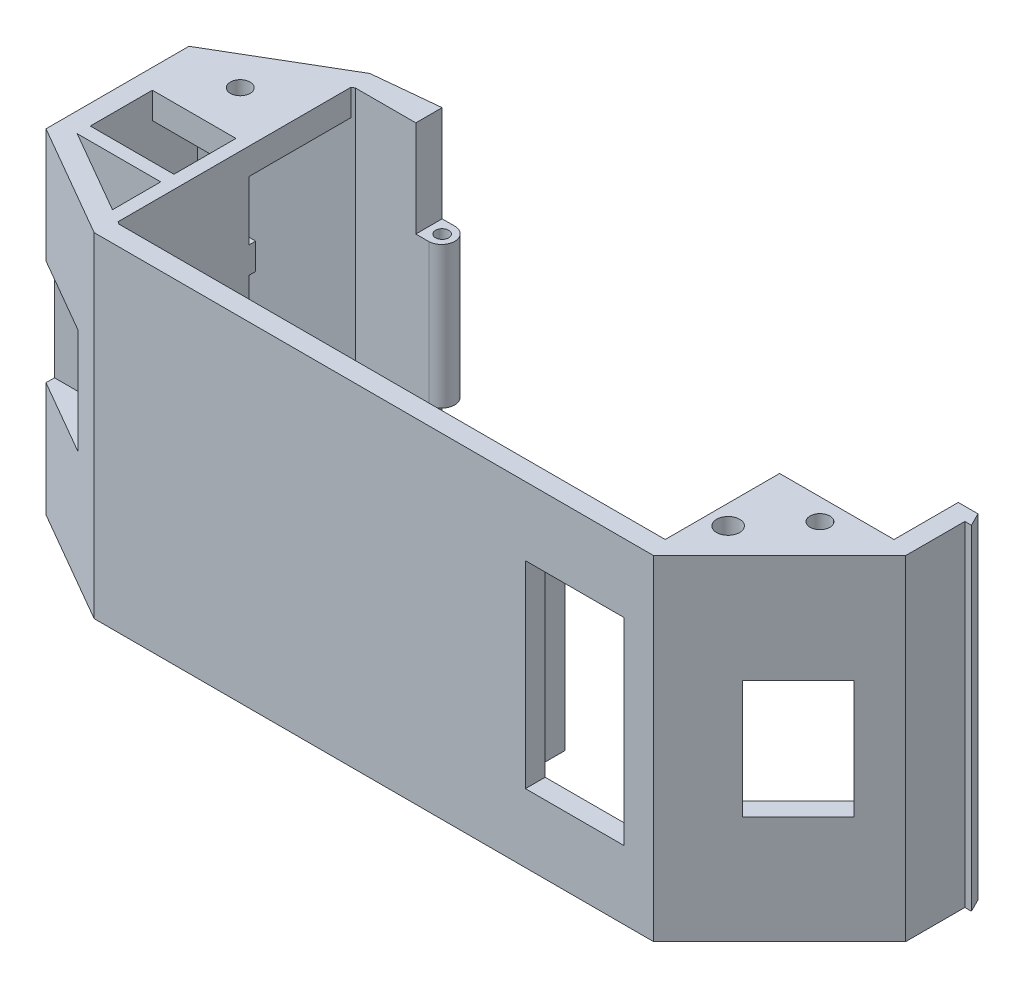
ISO-10303-21;
HEADER;
FILE_DESCRIPTION(('STEP AP214'),'2;1');
FILE_NAME('part.step','',(''),(''),'','','');
FILE_SCHEMA(('AUTOMOTIVE_DESIGN { 1 0 10303 214 1 1 1 1 }'));
ENDSEC;
DATA;
#1=APPLICATION_CONTEXT('core data for automotive mechanical design processes');
#2=APPLICATION_PROTOCOL_DEFINITION('international standard','automotive_design',2000,#1);
#3=PRODUCT_CONTEXT('',#1,'mechanical');
#4=PRODUCT('Part','Part','',(#3));
#5=PRODUCT_RELATED_PRODUCT_CATEGORY('part','',(#4));
#6=PRODUCT_DEFINITION_FORMATION('','',#4);
#7=PRODUCT_DEFINITION_CONTEXT('part definition',#1,'design');
#8=PRODUCT_DEFINITION('design','',#6,#7);
#9=PRODUCT_DEFINITION_SHAPE('','',#8);
#10=(LENGTH_UNIT() NAMED_UNIT(*) SI_UNIT(.MILLI.,.METRE.));
#11=(NAMED_UNIT(*) PLANE_ANGLE_UNIT() SI_UNIT($,.RADIAN.));
#12=(NAMED_UNIT(*) SI_UNIT($,.STERADIAN.) SOLID_ANGLE_UNIT());
#13=UNCERTAINTY_MEASURE_WITH_UNIT(LENGTH_MEASURE(1.E-05),#10,'distance_accuracy_value','');
#14=(GEOMETRIC_REPRESENTATION_CONTEXT(3) GLOBAL_UNCERTAINTY_ASSIGNED_CONTEXT((#13)) GLOBAL_UNIT_ASSIGNED_CONTEXT((#10,
#11,#12)) REPRESENTATION_CONTEXT('',''));
#15=CARTESIAN_POINT('',(0.,0.,0.));
#16=DIRECTION('',(0.,0.,1.));
#17=DIRECTION('',(1.,0.,0.));
#18=AXIS2_PLACEMENT_3D('',#15,#16,#17);
#19=CARTESIAN_POINT('',(-173.065016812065,50.8,-3.));
#20=DIRECTION('',(0.,0.,1.));
#21=DIRECTION('',(1.,0.,0.));
#22=AXIS2_PLACEMENT_3D('',#19,#20,#21);
#23=PLANE('',#22);
#24=DIRECTION('',(-1.,0.,0.));
#25=VECTOR('',#24,1.);
#26=CARTESIAN_POINT('',(-173.065016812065,0.,-3.));
#27=LINE('',#26,#25);
#28=CARTESIAN_POINT('',(-90.1115050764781,0.,-3.));
#29=VERTEX_POINT('',#28);
#30=CARTESIAN_POINT('',(-173.065016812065,0.,-3.));
#31=VERTEX_POINT('',#30);
#32=EDGE_CURVE('E1183',#29,#31,#27,.T.);
#33=ORIENTED_EDGE('',*,*,#32,.T.);
#34=DIRECTION('',(0.,-1.,0.));
#35=VECTOR('',#34,1.);
#36=CARTESIAN_POINT('',(-173.065016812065,50.8,-3.));
#37=LINE('',#36,#35);
#38=CARTESIAN_POINT('',(-173.065016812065,50.8,-3.));
#39=VERTEX_POINT('',#38);
#40=EDGE_CURVE('E1103',#39,#31,#37,.T.);
#41=ORIENTED_EDGE('',*,*,#40,.F.);
#42=DIRECTION('',(-1.,0.,0.));
#43=VECTOR('',#42,1.);
#44=CARTESIAN_POINT('',(-173.065016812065,50.8,-3.));
#45=LINE('',#44,#43);
#46=CARTESIAN_POINT('',(-90.1115050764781,50.8,-3.));
#47=VERTEX_POINT('',#46);
#48=EDGE_CURVE('E1126',#47,#39,#45,.T.);
#49=ORIENTED_EDGE('',*,*,#48,.F.);
#50=DIRECTION('',(0.,-1.,0.));
#51=VECTOR('',#50,1.);
#52=CARTESIAN_POINT('',(-90.1115050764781,50.8,-3.));
#53=LINE('',#52,#51);
#54=CARTESIAN_POINT('',(-90.1115050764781,45.8,-3.));
#55=VERTEX_POINT('',#54);
#56=EDGE_CURVE('E1113',#47,#55,#53,.T.);
#57=ORIENTED_EDGE('',*,*,#56,.T.);
#58=CARTESIAN_POINT('',(-90.1115050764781,5.,-3.));
#59=VERTEX_POINT('',#58);
#60=EDGE_CURVE('E1106',#55,#59,#53,.T.);
#61=ORIENTED_EDGE('',*,*,#60,.T.);
#62=DIRECTION('',(0.,-1.,0.));
#63=VECTOR('',#62,1.);
#64=CARTESIAN_POINT('',(-90.1115050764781,0.,-3.));
#65=LINE('',#64,#63);
#66=EDGE_CURVE('E598',#59,#29,#65,.T.);
#67=ORIENTED_EDGE('',*,*,#66,.T.);
#68=EDGE_LOOP('',(#33,#41,#49,#57,#61,#67));
#69=FACE_BOUND('',#68,.T.);
#70=DIRECTION('',(-1.,0.,0.));
#71=VECTOR('',#70,1.);
#72=CARTESIAN_POINT('',(-108.349883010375,10.4,-3.));
#73=LINE('',#72,#71);
#74=CARTESIAN_POINT('',(-93.3498830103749,10.4,-3.));
#75=VERTEX_POINT('',#74);
#76=CARTESIAN_POINT('',(-108.349883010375,10.4,-3.));
#77=VERTEX_POINT('',#76);
#78=EDGE_CURVE('E669',#75,#77,#73,.T.);
#79=ORIENTED_EDGE('',*,*,#78,.F.);
#80=DIRECTION('',(0.,-1.,0.));
#81=VECTOR('',#80,1.);
#82=CARTESIAN_POINT('',(-93.3498830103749,40.4,-3.));
#83=LINE('',#82,#81);
#84=CARTESIAN_POINT('',(-93.3498830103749,40.4,-3.));
#85=VERTEX_POINT('',#84);
#86=EDGE_CURVE('E661',#85,#75,#83,.T.);
#87=ORIENTED_EDGE('',*,*,#86,.F.);
#88=DIRECTION('',(1.,0.,0.));
#89=VECTOR('',#88,1.);
#90=CARTESIAN_POINT('',(-108.349883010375,40.4,-3.));
#91=LINE('',#90,#89);
#92=CARTESIAN_POINT('',(-108.349883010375,40.4,-3.));
#93=VERTEX_POINT('',#92);
#94=EDGE_CURVE('E675',#93,#85,#91,.T.);
#95=ORIENTED_EDGE('',*,*,#94,.F.);
#96=DIRECTION('',(0.,1.,0.));
#97=VECTOR('',#96,1.);
#98=CARTESIAN_POINT('',(-108.349883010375,40.4,-3.));
#99=LINE('',#98,#97);
#100=EDGE_CURVE('E672',#77,#93,#99,.T.);
#101=ORIENTED_EDGE('',*,*,#100,.F.);
#102=EDGE_LOOP('',(#79,#87,#95,#101));
#103=FACE_BOUND('',#102,.T.);
#104=DIRECTION('',(1.,0.,0.));
#105=VECTOR('',#104,1.);
#106=CARTESIAN_POINT('',(-110.349883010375,40.4,-3.));
#107=LINE('',#106,#105);
#108=CARTESIAN_POINT('',(-112.349883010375,40.4,-3.));
#109=VERTEX_POINT('',#108);
#110=CARTESIAN_POINT('',(-110.349883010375,40.4,-3.));
#111=VERTEX_POINT('',#110);
#112=EDGE_CURVE('E535',#109,#111,#107,.T.);
#113=ORIENTED_EDGE('',*,*,#112,.F.);
#114=DIRECTION('',(0.,1.,0.));
#115=VECTOR('',#114,1.);
#116=CARTESIAN_POINT('',(-112.349883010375,10.4,-3.));
#117=LINE('',#116,#115);
#118=CARTESIAN_POINT('',(-112.349883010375,10.4,-3.));
#119=VERTEX_POINT('',#118);
#120=EDGE_CURVE('E532',#119,#109,#117,.T.);
#121=ORIENTED_EDGE('',*,*,#120,.F.);
#122=DIRECTION('',(-1.,0.,0.));
#123=VECTOR('',#122,1.);
#124=CARTESIAN_POINT('',(-110.349883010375,10.4,-3.));
#125=LINE('',#124,#123);
#126=CARTESIAN_POINT('',(-110.349883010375,10.4,-3.));
#127=VERTEX_POINT('',#126);
#128=EDGE_CURVE('E57',#127,#119,#125,.T.);
#129=ORIENTED_EDGE('',*,*,#128,.F.);
#130=DIRECTION('',(0.,-1.,0.));
#131=VECTOR('',#130,1.);
#132=CARTESIAN_POINT('',(-110.349883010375,10.4,-3.));
#133=LINE('',#132,#131);
#134=EDGE_CURVE('E52',#111,#127,#133,.T.);
#135=ORIENTED_EDGE('',*,*,#134,.F.);
#136=EDGE_LOOP('',(#113,#121,#129,#135));
#137=FACE_BOUND('',#136,.T.);
#138=ADVANCED_FACE('F35',(#69,#103,#137),#23,.F.);
#139=CARTESIAN_POINT('',(-90.1115050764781,50.8,-3.));
#140=DIRECTION('',(0.707106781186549,0.,0.707106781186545));
#141=DIRECTION('',(0.707106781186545,0.,-0.70710678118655));
#142=AXIS2_PLACEMENT_3D('',#139,#140,#141);
#143=PLANE('',#142);
#144=DIRECTION('',(0.707106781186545,0.,-0.70710678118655));
#145=VECTOR('',#144,1.);
#146=CARTESIAN_POINT('',(-90.1115050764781,16.4,-3.));
#147=LINE('',#146,#145);
#148=CARTESIAN_POINT('',(-84.2486286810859,16.4,-8.8628763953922));
#149=VERTEX_POINT('',#148);
#150=CARTESIAN_POINT('',(-75.7633473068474,16.4,-17.3481577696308));
#151=VERTEX_POINT('',#150);
#152=EDGE_CURVE('E1327',#149,#151,#147,.T.);
#153=ORIENTED_EDGE('',*,*,#152,.T.);
#154=DIRECTION('',(0.,1.,0.));
#155=VECTOR('',#154,1.);
#156=CARTESIAN_POINT('',(-75.7633473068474,50.8,-17.3481577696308));
#157=LINE('',#156,#155);
#158=CARTESIAN_POINT('',(-75.7633473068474,34.4,-17.3481577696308));
#159=VERTEX_POINT('',#158);
#160=EDGE_CURVE('E44',#151,#159,#157,.T.);
#161=ORIENTED_EDGE('',*,*,#160,.T.);
#162=DIRECTION('',(-0.707106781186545,0.,0.70710678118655));
#163=VECTOR('',#162,1.);
#164=CARTESIAN_POINT('',(-90.1115050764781,34.4,-3.));
#165=LINE('',#164,#163);
#166=CARTESIAN_POINT('',(-84.2486286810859,34.4,-8.8628763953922));
#167=VERTEX_POINT('',#166);
#168=EDGE_CURVE('E1316',#159,#167,#165,.T.);
#169=ORIENTED_EDGE('',*,*,#168,.T.);
#170=DIRECTION('',(0.,-1.,0.));
#171=VECTOR('',#170,1.);
#172=CARTESIAN_POINT('',(-84.2486286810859,50.8,-8.8628763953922));
#173=LINE('',#172,#171);
#174=EDGE_CURVE('E1319',#167,#149,#173,.T.);
#175=ORIENTED_EDGE('',*,*,#174,.T.);
#176=EDGE_LOOP('',(#153,#161,#169,#175));
#177=FACE_BOUND('',#176,.T.);
#178=ORIENTED_EDGE('',*,*,#60,.F.);
#179=DIRECTION('',(-0.707106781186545,0.,0.70710678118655));
#180=VECTOR('',#179,1.);
#181=CARTESIAN_POINT('',(-72.7288980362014,45.8,-20.3826070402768));
#182=LINE('',#181,#180);
#183=CARTESIAN_POINT('',(-72.7288980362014,45.8,-20.3826070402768));
#184=VERTEX_POINT('',#183);
#185=EDGE_CURVE('E593',#184,#55,#182,.T.);
#186=ORIENTED_EDGE('',*,*,#185,.F.);
#187=DIRECTION('',(0.,-1.,0.));
#188=VECTOR('',#187,1.);
#189=CARTESIAN_POINT('',(-72.7288980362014,50.8,-20.3826070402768));
#190=LINE('',#189,#188);
#191=CARTESIAN_POINT('',(-72.7288980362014,5.,-20.3826070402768));
#192=VERTEX_POINT('',#191);
#193=EDGE_CURVE('E1122',#184,#192,#190,.T.);
#194=ORIENTED_EDGE('',*,*,#193,.T.);
#195=DIRECTION('',(-0.707106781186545,0.,0.70710678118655));
#196=VECTOR('',#195,1.);
#197=CARTESIAN_POINT('',(-72.7288980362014,5.,-20.3826070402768));
#198=LINE('',#197,#196);
#199=EDGE_CURVE('E605',#192,#59,#198,.T.);
#200=ORIENTED_EDGE('',*,*,#199,.T.);
#201=EDGE_LOOP('',(#178,#186,#194,#200));
#202=FACE_BOUND('',#201,.T.);
#203=ADVANCED_FACE('F1201',(#177,#202),#143,.F.);
#204=CARTESIAN_POINT('',(-188.189372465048,50.8,-30.));
#205=DIRECTION('',(-0.506237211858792,0.,-0.862394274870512));
#206=DIRECTION('',(-0.862394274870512,0.,0.506237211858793));
#207=AXIS2_PLACEMENT_3D('',#204,#205,#206);
#208=PLANE('',#207);
#209=DIRECTION('',(0.,1.,0.));
#210=VECTOR('',#209,1.);
#211=CARTESIAN_POINT('',(-173.489372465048,50.8,-38.6291006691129));
#212=LINE('',#211,#210);
#213=CARTESIAN_POINT('',(-173.489372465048,0.,-38.6291006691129));
#214=VERTEX_POINT('',#213);
#215=CARTESIAN_POINT('',(-173.489372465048,4.,-38.6291006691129));
#216=VERTEX_POINT('',#215);
#217=EDGE_CURVE('E627',#214,#216,#212,.T.);
#218=ORIENTED_EDGE('',*,*,#217,.F.);
#219=DIRECTION('',(0.862394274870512,0.,-0.506237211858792));
#220=VECTOR('',#219,1.);
#221=CARTESIAN_POINT('',(-188.189372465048,0.,-30.));
#222=LINE('',#221,#220);
#223=CARTESIAN_POINT('',(-173.065016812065,0.,-38.8782032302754));
#224=VERTEX_POINT('',#223);
#225=EDGE_CURVE('E1057',#214,#224,#222,.T.);
#226=ORIENTED_EDGE('',*,*,#225,.T.);
#227=DIRECTION('',(0.,-1.,0.));
#228=VECTOR('',#227,1.);
#229=CARTESIAN_POINT('',(-173.065016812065,50.8,-38.8782032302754));
#230=LINE('',#229,#228);
#231=CARTESIAN_POINT('',(-173.065016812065,50.8,-38.8782032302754));
#232=VERTEX_POINT('',#231);
#233=EDGE_CURVE('E1094',#232,#224,#230,.T.);
#234=ORIENTED_EDGE('',*,*,#233,.F.);
#235=DIRECTION('',(0.862394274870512,0.,-0.506237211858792));
#236=VECTOR('',#235,1.);
#237=CARTESIAN_POINT('',(-188.189372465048,50.8,-30.));
#238=LINE('',#237,#236);
#239=CARTESIAN_POINT('',(-173.489372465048,50.8,-38.6291006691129));
#240=VERTEX_POINT('',#239);
#241=EDGE_CURVE('E1026',#240,#232,#238,.T.);
#242=ORIENTED_EDGE('',*,*,#241,.F.);
#243=DIRECTION('',(0.,1.,0.));
#244=VECTOR('',#243,1.);
#245=CARTESIAN_POINT('',(-173.489372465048,50.8,-38.6291006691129));
#246=LINE('',#245,#244);
#247=CARTESIAN_POINT('',(-173.489372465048,46.8,-38.6291006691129));
#248=VERTEX_POINT('',#247);
#249=EDGE_CURVE('E633',#248,#240,#246,.T.);
#250=ORIENTED_EDGE('',*,*,#249,.F.);
#251=DIRECTION('',(0.862394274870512,0.,-0.506237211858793));
#252=VECTOR('',#251,1.);
#253=CARTESIAN_POINT('',(-188.189372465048,46.8,-30.));
#254=LINE('',#253,#252);
#255=CARTESIAN_POINT('',(-188.189372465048,46.8,-30.0000000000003));
#256=VERTEX_POINT('',#255);
#257=EDGE_CURVE('E630',#256,#248,#254,.T.);
#258=ORIENTED_EDGE('',*,*,#257,.F.);
#259=DIRECTION('',(0.,-1.,0.));
#260=VECTOR('',#259,1.);
#261=CARTESIAN_POINT('',(-188.189372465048,50.8,-30.));
#262=LINE('',#261,#260);
#263=CARTESIAN_POINT('',(-188.189372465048,4.,-30.));
#264=VERTEX_POINT('',#263);
#265=EDGE_CURVE('E1097',#256,#264,#262,.T.);
#266=ORIENTED_EDGE('',*,*,#265,.T.);
#267=DIRECTION('',(-0.862394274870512,0.,0.506237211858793));
#268=VECTOR('',#267,1.);
#269=CARTESIAN_POINT('',(-188.189372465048,4.,-30.));
#270=LINE('',#269,#268);
#271=EDGE_CURVE('E625',#216,#264,#270,.T.);
#272=ORIENTED_EDGE('',*,*,#271,.F.);
#273=EDGE_LOOP('',(#218,#226,#234,#242,#250,#258,#266,#272));
#274=FACE_BOUND('',#273,.T.);
#275=ADVANCED_FACE('F1218',(#274),#208,.F.);
#276=CARTESIAN_POINT('',(-173.880478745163,50.8,-41.8782032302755));
#277=DIRECTION('',(0.506237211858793,0.,0.862394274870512));
#278=DIRECTION('',(0.862394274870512,0.,-0.506237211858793));
#279=AXIS2_PLACEMENT_3D('',#276,#277,#278);
#280=PLANE('',#279);
#281=DIRECTION('',(0.,-1.,0.));
#282=VECTOR('',#281,1.);
#283=CARTESIAN_POINT('',(-191.076526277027,50.8,-31.7838885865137));
#284=LINE('',#283,#282);
#285=CARTESIAN_POINT('',(-191.076526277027,50.8,-31.7838885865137));
#286=VERTEX_POINT('',#285);
#287=CARTESIAN_POINT('',(-191.076526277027,0.,-31.7838885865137));
#288=VERTEX_POINT('',#287);
#289=EDGE_CURVE('E1080',#286,#288,#284,.T.);
#290=ORIENTED_EDGE('',*,*,#289,.F.);
#291=DIRECTION('',(-0.862394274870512,0.,0.506237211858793));
#292=VECTOR('',#291,1.);
#293=CARTESIAN_POINT('',(-173.880478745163,50.8,-41.8782032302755));
#294=LINE('',#293,#292);
#295=CARTESIAN_POINT('',(-173.880478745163,50.8,-41.8782032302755));
#296=VERTEX_POINT('',#295);
#297=EDGE_CURVE('E1034',#296,#286,#294,.T.);
#298=ORIENTED_EDGE('',*,*,#297,.F.);
#299=DIRECTION('',(0.,-1.,0.));
#300=VECTOR('',#299,1.);
#301=CARTESIAN_POINT('',(-173.880478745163,50.8,-41.8782032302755));
#302=LINE('',#301,#300);
#303=CARTESIAN_POINT('',(-173.880478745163,0.,-41.8782032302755));
#304=VERTEX_POINT('',#303);
#305=EDGE_CURVE('E1083',#296,#304,#302,.T.);
#306=ORIENTED_EDGE('',*,*,#305,.T.);
#307=DIRECTION('',(-0.862394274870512,0.,0.506237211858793));
#308=VECTOR('',#307,1.);
#309=CARTESIAN_POINT('',(-173.880478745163,0.,-41.8782032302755));
#310=LINE('',#309,#308);
#311=EDGE_CURVE('E1067',#304,#288,#310,.T.);
#312=ORIENTED_EDGE('',*,*,#311,.T.);
#313=EDGE_LOOP('',(#290,#298,#306,#312));
#314=FACE_BOUND('',#313,.T.);
#315=ADVANCED_FACE('F1262',(#314),#280,.F.);
#316=CARTESIAN_POINT('',(-69.7288980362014,50.8,-19.1399663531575));
#317=DIRECTION('',(-1.,0.,0.));
#318=DIRECTION('',(0.,0.,1.));
#319=AXIS2_PLACEMENT_3D('',#316,#317,#318);
#320=PLANE('',#319);
#321=DIRECTION('',(0.,-1.,0.));
#322=VECTOR('',#321,1.);
#323=CARTESIAN_POINT('',(-69.7288980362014,50.8,-28.1399663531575));
#324=LINE('',#323,#322);
#325=CARTESIAN_POINT('',(-69.7288980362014,50.8,-28.1399663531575));
#326=VERTEX_POINT('',#325);
#327=CARTESIAN_POINT('',(-69.7288980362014,0.,-28.1399663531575));
#328=VERTEX_POINT('',#327);
#329=EDGE_CURVE('E636',#326,#328,#324,.T.);
#330=ORIENTED_EDGE('',*,*,#329,.F.);
#331=DIRECTION('',(0.,0.,-1.));
#332=VECTOR('',#331,1.);
#333=CARTESIAN_POINT('',(-69.7288980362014,50.8,-19.1399663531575));
#334=LINE('',#333,#332);
#335=CARTESIAN_POINT('',(-69.7288980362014,50.8,-19.1399663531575));
#336=VERTEX_POINT('',#335);
#337=EDGE_CURVE('E1013',#336,#326,#334,.T.);
#338=ORIENTED_EDGE('',*,*,#337,.F.);
#339=DIRECTION('',(0.,-1.,0.));
#340=VECTOR('',#339,1.);
#341=CARTESIAN_POINT('',(-69.7288980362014,50.8,-19.1399663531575));
#342=LINE('',#341,#340);
#343=CARTESIAN_POINT('',(-69.7288980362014,0.,-19.1399663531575));
#344=VERTEX_POINT('',#343);
#345=EDGE_CURVE('E1181',#336,#344,#342,.T.);
#346=ORIENTED_EDGE('',*,*,#345,.T.);
#347=DIRECTION('',(0.,0.,-1.));
#348=VECTOR('',#347,1.);
#349=CARTESIAN_POINT('',(-69.7288980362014,0.,-19.1399663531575));
#350=LINE('',#349,#348);
#351=EDGE_CURVE('E1047',#344,#328,#350,.T.);
#352=ORIENTED_EDGE('',*,*,#351,.T.);
#353=EDGE_LOOP('',(#330,#338,#346,#352));
#354=FACE_BOUND('',#353,.T.);
#355=ADVANCED_FACE('F1294',(#354),#320,.F.);
#356=CARTESIAN_POINT('',(-163.880478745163,50.8,-41.8782032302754));
#357=DIRECTION('',(-1.,0.,0.));
#358=DIRECTION('',(0.,0.,1.));
#359=AXIS2_PLACEMENT_3D('',#356,#357,#358);
#360=PLANE('',#359);
#361=DIRECTION('',(0.,0.,1.));
#362=VECTOR('',#361,1.);
#363=CARTESIAN_POINT('',(-163.880478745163,36.1685288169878,-38.8782032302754));
#364=LINE('',#363,#362);
#365=CARTESIAN_POINT('',(-163.880478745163,36.1685288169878,-42.8782032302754));
#366=VERTEX_POINT('',#365);
#367=CARTESIAN_POINT('',(-163.880478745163,36.1685288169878,-38.8782032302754));
#368=VERTEX_POINT('',#367);
#369=EDGE_CURVE('E713',#366,#368,#364,.T.);
#370=ORIENTED_EDGE('',*,*,#369,.F.);
#371=DIRECTION('',(0.,-1.,0.));
#372=VECTOR('',#371,1.);
#373=CARTESIAN_POINT('',(-163.880478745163,50.8,-42.8782032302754));
#374=LINE('',#373,#372);
#375=CARTESIAN_POINT('',(-163.880478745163,50.8,-42.8782032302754));
#376=VERTEX_POINT('',#375);
#377=EDGE_CURVE('E1087',#376,#366,#374,.T.);
#378=ORIENTED_EDGE('',*,*,#377,.F.);
#379=DIRECTION('',(0.,0.,-1.));
#380=VECTOR('',#379,1.);
#381=CARTESIAN_POINT('',(-163.880478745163,50.8,-38.8782032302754));
#382=LINE('',#381,#380);
#383=CARTESIAN_POINT('',(-163.880478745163,50.8,-38.8782032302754));
#384=VERTEX_POINT('',#383);
#385=EDGE_CURVE('E1030',#384,#376,#382,.T.);
#386=ORIENTED_EDGE('',*,*,#385,.F.);
#387=DIRECTION('',(0.,-1.,0.));
#388=VECTOR('',#387,1.);
#389=CARTESIAN_POINT('',(-163.880478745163,50.8,-38.8782032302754));
#390=LINE('',#389,#388);
#391=EDGE_CURVE('E1091',#384,#368,#390,.T.);
#392=ORIENTED_EDGE('',*,*,#391,.T.);
#393=EDGE_LOOP('',(#370,#378,#386,#392));
#394=FACE_BOUND('',#393,.T.);
#395=ADVANCED_FACE('F1253',(#394),#360,.F.);
#396=DIRECTION('',(0.,0.,-1.));
#397=VECTOR('',#396,1.);
#398=CARTESIAN_POINT('',(-163.880478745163,14.6314711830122,-38.8782032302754));
#399=LINE('',#398,#397);
#400=CARTESIAN_POINT('',(-163.880478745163,14.6314711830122,-38.8782032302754));
#401=VERTEX_POINT('',#400);
#402=CARTESIAN_POINT('',(-163.880478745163,14.6314711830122,-42.8782032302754));
#403=VERTEX_POINT('',#402);
#404=EDGE_CURVE('E716',#401,#403,#399,.T.);
#405=ORIENTED_EDGE('',*,*,#404,.F.);
#406=CARTESIAN_POINT('',(-163.880478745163,0.,-38.8782032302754));
#407=VERTEX_POINT('',#406);
#408=EDGE_CURVE('E1090',#401,#407,#390,.T.);
#409=ORIENTED_EDGE('',*,*,#408,.T.);
#410=DIRECTION('',(0.,0.,-1.));
#411=VECTOR('',#410,1.);
#412=CARTESIAN_POINT('',(-163.880478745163,0.,-41.8782032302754));
#413=LINE('',#412,#411);
#414=CARTESIAN_POINT('',(-163.880478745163,0.,-42.8782032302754));
#415=VERTEX_POINT('',#414);
#416=EDGE_CURVE('E1062',#407,#415,#413,.T.);
#417=ORIENTED_EDGE('',*,*,#416,.T.);
#418=EDGE_CURVE('E1086',#403,#415,#374,.T.);
#419=ORIENTED_EDGE('',*,*,#418,.F.);
#420=EDGE_LOOP('',(#405,#409,#417,#419));
#421=FACE_BOUND('',#420,.T.);
#422=ADVANCED_FACE('F1308',(#421),#360,.F.);
#423=CARTESIAN_POINT('',(-188.189372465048,50.8,-11.7320508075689));
#424=DIRECTION('',(-1.,0.,0.));
#425=DIRECTION('',(0.,0.,1.));
#426=AXIS2_PLACEMENT_3D('',#423,#424,#425);
#427=PLANE('',#426);
#428=DIRECTION('',(0.,-1.,0.));
#429=VECTOR('',#428,1.);
#430=CARTESIAN_POINT('',(-188.189372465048,0.,-23.1620508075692));
#431=LINE('',#430,#429);
#432=CARTESIAN_POINT('',(-188.189372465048,4.,-23.1620508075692));
#433=VERTEX_POINT('',#432);
#434=CARTESIAN_POINT('',(-188.189372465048,0.,-23.1620508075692));
#435=VERTEX_POINT('',#434);
#436=EDGE_CURVE('E770',#433,#435,#431,.T.);
#437=ORIENTED_EDGE('',*,*,#436,.F.);
#438=DIRECTION('',(0.,0.,1.));
#439=VECTOR('',#438,1.);
#440=CARTESIAN_POINT('',(-188.189372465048,4.,-23.1620508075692));
#441=LINE('',#440,#439);
#442=EDGE_CURVE('E765',#264,#433,#441,.T.);
#443=ORIENTED_EDGE('',*,*,#442,.F.);
#444=ORIENTED_EDGE('',*,*,#265,.F.);
#445=DIRECTION('',(0.,0.,-1.));
#446=VECTOR('',#445,1.);
#447=CARTESIAN_POINT('',(-188.189372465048,46.8,-23.1620508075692));
#448=LINE('',#447,#446);
#449=CARTESIAN_POINT('',(-188.189372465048,46.8,-23.1620508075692));
#450=VERTEX_POINT('',#449);
#451=EDGE_CURVE('E817',#450,#256,#448,.T.);
#452=ORIENTED_EDGE('',*,*,#451,.F.);
#453=DIRECTION('',(0.,-1.,0.));
#454=VECTOR('',#453,1.);
#455=CARTESIAN_POINT('',(-188.189372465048,50.8,-23.1620508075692));
#456=LINE('',#455,#454);
#457=CARTESIAN_POINT('',(-188.189372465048,50.8,-23.1620508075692));
#458=VERTEX_POINT('',#457);
#459=EDGE_CURVE('E822',#458,#450,#456,.T.);
#460=ORIENTED_EDGE('',*,*,#459,.F.);
#461=DIRECTION('',(0.,0.,-1.));
#462=VECTOR('',#461,1.);
#463=CARTESIAN_POINT('',(-188.189372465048,50.8,-11.7320508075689));
#464=LINE('',#463,#462);
#465=CARTESIAN_POINT('',(-188.189372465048,50.8,-13.7320508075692));
#466=VERTEX_POINT('',#465);
#467=EDGE_CURVE('E1022',#466,#458,#464,.T.);
#468=ORIENTED_EDGE('',*,*,#467,.F.);
#469=DIRECTION('',(0.,1.,0.));
#470=VECTOR('',#469,1.);
#471=CARTESIAN_POINT('',(-188.189372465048,50.8,-13.7320508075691));
#472=LINE('',#471,#470);
#473=CARTESIAN_POINT('',(-188.189372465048,31.75,-13.7320508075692));
#474=VERTEX_POINT('',#473);
#475=EDGE_CURVE('E966',#474,#466,#472,.T.);
#476=ORIENTED_EDGE('',*,*,#475,.F.);
#477=DIRECTION('',(0.,0.,1.));
#478=VECTOR('',#477,1.);
#479=CARTESIAN_POINT('',(-188.189372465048,31.75,-23.1620508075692));
#480=LINE('',#479,#478);
#481=CARTESIAN_POINT('',(-188.189372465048,31.75,-23.1620508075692));
#482=VERTEX_POINT('',#481);
#483=EDGE_CURVE('E948',#482,#474,#480,.T.);
#484=ORIENTED_EDGE('',*,*,#483,.F.);
#485=DIRECTION('',(0.,1.,0.));
#486=VECTOR('',#485,1.);
#487=CARTESIAN_POINT('',(-188.189372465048,31.75,-23.1620508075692));
#488=LINE('',#487,#486);
#489=CARTESIAN_POINT('',(-188.189372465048,30.7516180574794,-23.1620508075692));
#490=VERTEX_POINT('',#489);
#491=EDGE_CURVE('E927',#490,#482,#488,.T.);
#492=ORIENTED_EDGE('',*,*,#491,.F.);
#493=DIRECTION('',(0.,0.,1.));
#494=VECTOR('',#493,1.);
#495=CARTESIAN_POINT('',(-188.189372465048,30.7516180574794,-23.1620508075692));
#496=LINE('',#495,#494);
#497=CARTESIAN_POINT('',(-188.189372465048,30.7516180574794,-13.7320508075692));
#498=VERTEX_POINT('',#497);
#499=EDGE_CURVE('E936',#490,#498,#496,.T.);
#500=ORIENTED_EDGE('',*,*,#499,.T.);
#501=CARTESIAN_POINT('',(-188.189372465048,20.0546082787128,-13.7320508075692));
#502=VERTEX_POINT('',#501);
#503=EDGE_CURVE('E992',#502,#498,#472,.T.);
#504=ORIENTED_EDGE('',*,*,#503,.F.);
#505=DIRECTION('',(0.,0.,1.));
#506=VECTOR('',#505,1.);
#507=CARTESIAN_POINT('',(-188.189372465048,20.0546082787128,-23.1620508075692));
#508=LINE('',#507,#506);
#509=CARTESIAN_POINT('',(-188.189372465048,20.0546082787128,-23.1620508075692));
#510=VERTEX_POINT('',#509);
#511=EDGE_CURVE('E924',#510,#502,#508,.T.);
#512=ORIENTED_EDGE('',*,*,#511,.F.);
#513=DIRECTION('',(0.,1.,0.));
#514=VECTOR('',#513,1.);
#515=CARTESIAN_POINT('',(-188.189372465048,19.05,-23.1620508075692));
#516=LINE('',#515,#514);
#517=CARTESIAN_POINT('',(-188.189372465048,19.05,-23.1620508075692));
#518=VERTEX_POINT('',#517);
#519=EDGE_CURVE('E905',#518,#510,#516,.T.);
#520=ORIENTED_EDGE('',*,*,#519,.F.);
#521=DIRECTION('',(0.,0.,1.));
#522=VECTOR('',#521,1.);
#523=CARTESIAN_POINT('',(-188.189372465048,19.05,-23.1620508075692));
#524=LINE('',#523,#522);
#525=CARTESIAN_POINT('',(-188.189372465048,19.05,-13.7320508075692));
#526=VERTEX_POINT('',#525);
#527=EDGE_CURVE('E914',#518,#526,#524,.T.);
#528=ORIENTED_EDGE('',*,*,#527,.T.);
#529=CARTESIAN_POINT('',(-188.189372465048,0.,-13.7320508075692));
#530=VERTEX_POINT('',#529);
#531=EDGE_CURVE('E984',#530,#526,#472,.T.);
#532=ORIENTED_EDGE('',*,*,#531,.F.);
#533=DIRECTION('',(0.,0.,-1.));
#534=VECTOR('',#533,1.);
#535=CARTESIAN_POINT('',(-188.189372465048,0.,-11.7320508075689));
#536=LINE('',#535,#534);
#537=EDGE_CURVE('E1054',#530,#435,#536,.T.);
#538=ORIENTED_EDGE('',*,*,#537,.T.);
#539=EDGE_LOOP('',(#437,#443,#444,#452,#460,#468,#476,#484,#492,#500,#504,#512,#520,#528,#532,#538));
#540=FACE_BOUND('',#539,.T.);
#541=DIRECTION('',(0.,1.,0.));
#542=VECTOR('',#541,1.);
#543=CARTESIAN_POINT('',(-188.189372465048,37.8,-24.1620508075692));
#544=LINE('',#543,#542);
#545=CARTESIAN_POINT('',(-188.189372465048,33.8,-24.1620508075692));
#546=VERTEX_POINT('',#545);
#547=CARTESIAN_POINT('',(-188.189372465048,37.8,-24.1620508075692));
#548=VERTEX_POINT('',#547);
#549=EDGE_CURVE('E795',#546,#548,#544,.T.);
#550=ORIENTED_EDGE('',*,*,#549,.F.);
#551=DIRECTION('',(0.,0.,-1.));
#552=VECTOR('',#551,1.);
#553=CARTESIAN_POINT('',(-188.189372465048,33.8,-23.1620508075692));
#554=LINE('',#553,#552);
#555=CARTESIAN_POINT('',(-188.189372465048,33.8,-23.1620508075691));
#556=VERTEX_POINT('',#555);
#557=EDGE_CURVE('E780',#556,#546,#554,.T.);
#558=ORIENTED_EDGE('',*,*,#557,.F.);
#559=DIRECTION('',(0.,-1.,0.));
#560=VECTOR('',#559,1.);
#561=CARTESIAN_POINT('',(-188.189372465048,37.8,-23.1620508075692));
#562=LINE('',#561,#560);
#563=CARTESIAN_POINT('',(-188.189372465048,37.8,-23.1620508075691));
#564=VERTEX_POINT('',#563);
#565=EDGE_CURVE('E785',#564,#556,#562,.T.);
#566=ORIENTED_EDGE('',*,*,#565,.F.);
#567=DIRECTION('',(0.,0.,1.));
#568=VECTOR('',#567,1.);
#569=CARTESIAN_POINT('',(-188.189372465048,37.8,-23.1620508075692));
#570=LINE('',#569,#568);
#571=EDGE_CURVE('E790',#548,#564,#570,.T.);
#572=ORIENTED_EDGE('',*,*,#571,.F.);
#573=EDGE_LOOP('',(#550,#558,#566,#572));
#574=FACE_BOUND('',#573,.T.);
#575=DIRECTION('',(0.,1.,0.));
#576=VECTOR('',#575,1.);
#577=CARTESIAN_POINT('',(-188.189372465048,13.,-24.1620508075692));
#578=LINE('',#577,#576);
#579=CARTESIAN_POINT('',(-188.189372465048,13.,-24.1620508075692));
#580=VERTEX_POINT('',#579);
#581=CARTESIAN_POINT('',(-188.189372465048,17.,-24.1620508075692));
#582=VERTEX_POINT('',#581);
#583=EDGE_CURVE('E743',#580,#582,#578,.T.);
#584=ORIENTED_EDGE('',*,*,#583,.F.);
#585=DIRECTION('',(0.,0.,-1.));
#586=VECTOR('',#585,1.);
#587=CARTESIAN_POINT('',(-188.189372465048,13.,-23.1620508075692));
#588=LINE('',#587,#586);
#589=CARTESIAN_POINT('',(-188.189372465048,13.,-23.1620508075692));
#590=VERTEX_POINT('',#589);
#591=EDGE_CURVE('E728',#590,#580,#588,.T.);
#592=ORIENTED_EDGE('',*,*,#591,.F.);
#593=DIRECTION('',(0.,-1.,0.));
#594=VECTOR('',#593,1.);
#595=CARTESIAN_POINT('',(-188.189372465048,13.,-23.1620508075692));
#596=LINE('',#595,#594);
#597=CARTESIAN_POINT('',(-188.189372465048,17.,-23.1620508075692));
#598=VERTEX_POINT('',#597);
#599=EDGE_CURVE('E733',#598,#590,#596,.T.);
#600=ORIENTED_EDGE('',*,*,#599,.F.);
#601=DIRECTION('',(0.,0.,1.));
#602=VECTOR('',#601,1.);
#603=CARTESIAN_POINT('',(-188.189372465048,17.,-23.1620508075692));
#604=LINE('',#603,#602);
#605=EDGE_CURVE('E738',#582,#598,#604,.T.);
#606=ORIENTED_EDGE('',*,*,#605,.F.);
#607=EDGE_LOOP('',(#584,#592,#600,#606));
#608=FACE_BOUND('',#607,.T.);
#609=ADVANCED_FACE('F1227',(#540,#574,#608),#427,.F.);
#610=CARTESIAN_POINT('',(-173.489372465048,0.,-23.1620508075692));
#611=DIRECTION('',(0.,0.,-1.));
#612=DIRECTION('',(-1.,0.,0.));
#613=AXIS2_PLACEMENT_3D('',#610,#611,#612);
#614=PLANE('',#613);
#615=DIRECTION('',(0.,1.,0.));
#616=VECTOR('',#615,1.);
#617=CARTESIAN_POINT('',(-173.489372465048,0.,-23.1620508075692));
#618=LINE('',#617,#616);
#619=CARTESIAN_POINT('',(-173.489372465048,17.,-23.1620508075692));
#620=VERTEX_POINT('',#619);
#621=CARTESIAN_POINT('',(-173.489372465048,33.8,-23.1620508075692));
#622=VERTEX_POINT('',#621);
#623=EDGE_CURVE('E977',#620,#622,#618,.T.);
#624=ORIENTED_EDGE('',*,*,#623,.F.);
#625=DIRECTION('',(-1.,0.,0.));
#626=VECTOR('',#625,1.);
#627=CARTESIAN_POINT('',(-165.567406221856,17.,-23.1620508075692));
#628=LINE('',#627,#626);
#629=CARTESIAN_POINT('',(-175.489372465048,17.,-23.1620508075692));
#630=VERTEX_POINT('',#629);
#631=EDGE_CURVE('E737',#620,#630,#628,.T.);
#632=ORIENTED_EDGE('',*,*,#631,.T.);
#633=DIRECTION('',(0.,1.,0.));
#634=VECTOR('',#633,1.);
#635=CARTESIAN_POINT('',(-175.489372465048,0.,-23.1620508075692));
#636=LINE('',#635,#634);
#637=CARTESIAN_POINT('',(-175.489372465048,19.05,-23.1620508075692));
#638=VERTEX_POINT('',#637);
#639=EDGE_CURVE('E971',#630,#638,#636,.T.);
#640=ORIENTED_EDGE('',*,*,#639,.T.);
#641=DIRECTION('',(-1.,0.,0.));
#642=VECTOR('',#641,1.);
#643=CARTESIAN_POINT('',(-188.189372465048,19.05,-23.1620508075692));
#644=LINE('',#643,#642);
#645=EDGE_CURVE('E912',#638,#518,#644,.T.);
#646=ORIENTED_EDGE('',*,*,#645,.T.);
#647=ORIENTED_EDGE('',*,*,#519,.T.);
#648=DIRECTION('',(1.,0.,0.));
#649=VECTOR('',#648,1.);
#650=CARTESIAN_POINT('',(-188.189372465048,20.0546082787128,-23.1620508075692));
#651=LINE('',#650,#649);
#652=CARTESIAN_POINT('',(-175.489372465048,20.0546082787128,-23.1620508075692));
#653=VERTEX_POINT('',#652);
#654=EDGE_CURVE('E908',#510,#653,#651,.T.);
#655=ORIENTED_EDGE('',*,*,#654,.T.);
#656=CARTESIAN_POINT('',(-175.489372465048,30.7516180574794,-23.1620508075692));
#657=VERTEX_POINT('',#656);
#658=EDGE_CURVE('E2243',#653,#657,#636,.T.);
#659=ORIENTED_EDGE('',*,*,#658,.T.);
#660=DIRECTION('',(-1.,0.,0.));
#661=VECTOR('',#660,1.);
#662=CARTESIAN_POINT('',(-188.189372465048,30.7516180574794,-23.1620508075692));
#663=LINE('',#662,#661);
#664=EDGE_CURVE('E934',#657,#490,#663,.T.);
#665=ORIENTED_EDGE('',*,*,#664,.T.);
#666=ORIENTED_EDGE('',*,*,#491,.T.);
#667=DIRECTION('',(1.,0.,0.));
#668=VECTOR('',#667,1.);
#669=CARTESIAN_POINT('',(-188.189372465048,31.75,-23.1620508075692));
#670=LINE('',#669,#668);
#671=CARTESIAN_POINT('',(-175.489372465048,31.75,-23.1620508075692));
#672=VERTEX_POINT('',#671);
#673=EDGE_CURVE('E930',#482,#672,#670,.T.);
#674=ORIENTED_EDGE('',*,*,#673,.T.);
#675=CARTESIAN_POINT('',(-175.489372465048,33.8,-23.1620508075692));
#676=VERTEX_POINT('',#675);
#677=EDGE_CURVE('E972',#672,#676,#636,.T.);
#678=ORIENTED_EDGE('',*,*,#677,.T.);
#679=DIRECTION('',(-1.,0.,0.));
#680=VECTOR('',#679,1.);
#681=CARTESIAN_POINT('',(-165.567406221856,33.8,-23.1620508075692));
#682=LINE('',#681,#680);
#683=EDGE_CURVE('E784',#622,#676,#682,.T.);
#684=ORIENTED_EDGE('',*,*,#683,.F.);
#685=EDGE_LOOP('',(#624,#632,#640,#646,#647,#655,#659,#665,#666,#674,#678,#684));
#686=FACE_BOUND('',#685,.T.);
#687=ADVANCED_FACE('F1524',(#686),#614,.T.);
#688=CARTESIAN_POINT('',(-175.489372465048,4.,-23.1620508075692));
#689=VERTEX_POINT('',#688);
#690=CARTESIAN_POINT('',(-175.489372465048,13.,-23.1620508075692));
#691=VERTEX_POINT('',#690);
#692=EDGE_CURVE('E970',#689,#691,#636,.T.);
#693=ORIENTED_EDGE('',*,*,#692,.T.);
#694=DIRECTION('',(-1.,0.,0.));
#695=VECTOR('',#694,1.);
#696=CARTESIAN_POINT('',(-165.567406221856,13.,-23.1620508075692));
#697=LINE('',#696,#695);
#698=CARTESIAN_POINT('',(-173.489372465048,13.,-23.1620508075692));
#699=VERTEX_POINT('',#698);
#700=EDGE_CURVE('E732',#699,#691,#697,.T.);
#701=ORIENTED_EDGE('',*,*,#700,.F.);
#702=CARTESIAN_POINT('',(-173.489372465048,4.,-23.1620508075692));
#703=VERTEX_POINT('',#702);
#704=EDGE_CURVE('E973',#703,#699,#618,.T.);
#705=ORIENTED_EDGE('',*,*,#704,.F.);
#706=DIRECTION('',(-1.,0.,0.));
#707=VECTOR('',#706,1.);
#708=CARTESIAN_POINT('',(-165.567406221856,4.,-23.1620508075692));
#709=LINE('',#708,#707);
#710=EDGE_CURVE('E773',#703,#689,#709,.T.);
#711=ORIENTED_EDGE('',*,*,#710,.T.);
#712=EDGE_LOOP('',(#693,#701,#705,#711));
#713=FACE_BOUND('',#712,.T.);
#714=ADVANCED_FACE('F1522',(#713),#614,.T.);
#715=CARTESIAN_POINT('',(-173.489372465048,37.8,-23.1620508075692));
#716=VERTEX_POINT('',#715);
#717=CARTESIAN_POINT('',(-173.489372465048,46.8,-23.1620508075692));
#718=VERTEX_POINT('',#717);
#719=EDGE_CURVE('E978',#716,#718,#618,.T.);
#720=ORIENTED_EDGE('',*,*,#719,.F.);
#721=DIRECTION('',(-1.,0.,0.));
#722=VECTOR('',#721,1.);
#723=CARTESIAN_POINT('',(-165.567406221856,37.8,-23.1620508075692));
#724=LINE('',#723,#722);
#725=CARTESIAN_POINT('',(-175.489372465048,37.8,-23.1620508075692));
#726=VERTEX_POINT('',#725);
#727=EDGE_CURVE('E789',#716,#726,#724,.T.);
#728=ORIENTED_EDGE('',*,*,#727,.T.);
#729=CARTESIAN_POINT('',(-175.489372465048,46.8,-23.1620508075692));
#730=VERTEX_POINT('',#729);
#731=EDGE_CURVE('E976',#726,#730,#636,.T.);
#732=ORIENTED_EDGE('',*,*,#731,.T.);
#733=DIRECTION('',(-1.,0.,0.));
#734=VECTOR('',#733,1.);
#735=CARTESIAN_POINT('',(-165.567406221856,46.8,-23.1620508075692));
#736=LINE('',#735,#734);
#737=EDGE_CURVE('E821',#718,#730,#736,.T.);
#738=ORIENTED_EDGE('',*,*,#737,.F.);
#739=EDGE_LOOP('',(#720,#728,#732,#738));
#740=FACE_BOUND('',#739,.T.);
#741=ADVANCED_FACE('F1518',(#740),#614,.T.);
#742=CARTESIAN_POINT('',(-175.489372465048,50.8,-13.7320508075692));
#743=DIRECTION('',(0.,0.,1.));
#744=DIRECTION('',(1.,0.,0.));
#745=AXIS2_PLACEMENT_3D('',#742,#743,#744);
#746=PLANE('',#745);
#747=DIRECTION('',(1.,0.,0.));
#748=VECTOR('',#747,1.);
#749=CARTESIAN_POINT('',(-188.189372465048,20.0546082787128,-13.7320508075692));
#750=LINE('',#749,#748);
#751=CARTESIAN_POINT('',(-175.489372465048,20.0546082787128,-13.7320508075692));
#752=VERTEX_POINT('',#751);
#753=EDGE_CURVE('E904',#502,#752,#750,.T.);
#754=ORIENTED_EDGE('',*,*,#753,.F.);
#755=ORIENTED_EDGE('',*,*,#503,.T.);
#756=DIRECTION('',(-1.,0.,0.));
#757=VECTOR('',#756,1.);
#758=CARTESIAN_POINT('',(-188.189372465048,30.7516180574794,-13.7320508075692));
#759=LINE('',#758,#757);
#760=CARTESIAN_POINT('',(-175.489372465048,30.7516180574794,-13.7320508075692));
#761=VERTEX_POINT('',#760);
#762=EDGE_CURVE('E931',#761,#498,#759,.T.);
#763=ORIENTED_EDGE('',*,*,#762,.F.);
#764=DIRECTION('',(0.,1.,0.));
#765=VECTOR('',#764,1.);
#766=CARTESIAN_POINT('',(-175.489372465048,50.8,-13.7320508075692));
#767=LINE('',#766,#765);
#768=EDGE_CURVE('E989',#752,#761,#767,.T.);
#769=ORIENTED_EDGE('',*,*,#768,.F.);
#770=EDGE_LOOP('',(#754,#755,#763,#769));
#771=FACE_BOUND('',#770,.T.);
#772=ADVANCED_FACE('F1521',(#771),#746,.F.);
#773=DIRECTION('',(-1.,0.,0.));
#774=VECTOR('',#773,1.);
#775=CARTESIAN_POINT('',(-188.189372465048,19.05,-13.7320508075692));
#776=LINE('',#775,#774);
#777=CARTESIAN_POINT('',(-175.489372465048,19.05,-13.7320508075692));
#778=VERTEX_POINT('',#777);
#779=EDGE_CURVE('E909',#778,#526,#776,.T.);
#780=ORIENTED_EDGE('',*,*,#779,.F.);
#781=CARTESIAN_POINT('',(-175.489372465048,0.,-13.7320508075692));
#782=VERTEX_POINT('',#781);
#783=EDGE_CURVE('E985',#782,#778,#767,.T.);
#784=ORIENTED_EDGE('',*,*,#783,.F.);
#785=DIRECTION('',(-1.,0.,0.));
#786=VECTOR('',#785,1.);
#787=CARTESIAN_POINT('',(-175.489372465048,0.,-13.7320508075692));
#788=LINE('',#787,#786);
#789=EDGE_CURVE('E998',#782,#530,#788,.T.);
#790=ORIENTED_EDGE('',*,*,#789,.T.);
#791=ORIENTED_EDGE('',*,*,#531,.T.);
#792=EDGE_LOOP('',(#780,#784,#790,#791));
#793=FACE_BOUND('',#792,.T.);
#794=ADVANCED_FACE('F1533',(#793),#746,.F.);
#795=CARTESIAN_POINT('',(-175.489372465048,0.,-23.1620508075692));
#796=DIRECTION('',(-1.,0.,0.));
#797=DIRECTION('',(0.,0.,1.));
#798=AXIS2_PLACEMENT_3D('',#795,#796,#797);
#799=PLANE('',#798);
#800=CARTESIAN_POINT('',(-175.489372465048,25.4,-18.182788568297));
#801=DIRECTION('',(-1.,0.,0.));
#802=DIRECTION('',(0.,0.,1.));
#803=AXIS2_PLACEMENT_3D('',#800,#801,#802);
#804=CIRCLE('',#803,4.);
#805=CARTESIAN_POINT('',(-175.489372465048,25.4,-14.182788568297));
#806=VERTEX_POINT('',#805);
#807=EDGE_CURVE('E891',#806,#806,#804,.T.);
#808=ORIENTED_EDGE('',*,*,#807,.F.);
#809=EDGE_LOOP('',(#808));
#810=FACE_BOUND('',#809,.T.);
#811=ORIENTED_EDGE('',*,*,#658,.F.);
#812=DIRECTION('',(0.,0.,1.));
#813=VECTOR('',#812,1.);
#814=CARTESIAN_POINT('',(-175.489372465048,20.0546082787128,-23.1620508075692));
#815=LINE('',#814,#813);
#816=EDGE_CURVE('E921',#653,#752,#815,.T.);
#817=ORIENTED_EDGE('',*,*,#816,.T.);
#818=ORIENTED_EDGE('',*,*,#768,.T.);
#819=DIRECTION('',(0.,0.,1.));
#820=VECTOR('',#819,1.);
#821=CARTESIAN_POINT('',(-175.489372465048,30.7516180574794,-23.1620508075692));
#822=LINE('',#821,#820);
#823=EDGE_CURVE('E942',#657,#761,#822,.T.);
#824=ORIENTED_EDGE('',*,*,#823,.F.);
#825=EDGE_LOOP('',(#811,#817,#818,#824));
#826=FACE_BOUND('',#825,.T.);
#827=ADVANCED_FACE('F1516',(#810,#826),#799,.T.);
#828=ORIENTED_EDGE('',*,*,#783,.T.);
#829=DIRECTION('',(0.,0.,1.));
#830=VECTOR('',#829,1.);
#831=CARTESIAN_POINT('',(-175.489372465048,19.05,-23.1620508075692));
#832=LINE('',#831,#830);
#833=EDGE_CURVE('E919',#638,#778,#832,.T.);
#834=ORIENTED_EDGE('',*,*,#833,.F.);
#835=ORIENTED_EDGE('',*,*,#639,.F.);
#836=DIRECTION('',(0.,-1.,0.));
#837=VECTOR('',#836,1.);
#838=CARTESIAN_POINT('',(-175.489372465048,0.,-23.1620508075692));
#839=LINE('',#838,#837);
#840=EDGE_CURVE('E748',#630,#691,#839,.T.);
#841=ORIENTED_EDGE('',*,*,#840,.T.);
#842=ORIENTED_EDGE('',*,*,#692,.F.);
#843=CARTESIAN_POINT('',(-175.489372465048,0.,-23.1620508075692));
#844=VERTEX_POINT('',#843);
#845=EDGE_CURVE('E968',#844,#689,#636,.T.);
#846=ORIENTED_EDGE('',*,*,#845,.F.);
#847=DIRECTION('',(0.,0.,1.));
#848=VECTOR('',#847,1.);
#849=CARTESIAN_POINT('',(-175.489372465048,0.,-23.1620508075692));
#850=LINE('',#849,#848);
#851=EDGE_CURVE('E955',#844,#782,#850,.T.);
#852=ORIENTED_EDGE('',*,*,#851,.T.);
#853=EDGE_LOOP('',(#828,#834,#835,#841,#842,#846,#852));
#854=FACE_BOUND('',#853,.T.);
#855=ADVANCED_FACE('F1531',(#854),#799,.T.);
#856=DIRECTION('',(1.,0.,0.));
#857=VECTOR('',#856,1.);
#858=CARTESIAN_POINT('',(-188.189372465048,31.75,-13.7320508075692));
#859=LINE('',#858,#857);
#860=CARTESIAN_POINT('',(-175.489372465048,31.75,-13.7320508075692));
#861=VERTEX_POINT('',#860);
#862=EDGE_CURVE('E926',#474,#861,#859,.T.);
#863=ORIENTED_EDGE('',*,*,#862,.F.);
#864=ORIENTED_EDGE('',*,*,#475,.T.);
#865=DIRECTION('',(-1.,0.,0.));
#866=VECTOR('',#865,1.);
#867=CARTESIAN_POINT('',(-175.489372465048,50.8,-13.7320508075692));
#868=LINE('',#867,#866);
#869=CARTESIAN_POINT('',(-175.489372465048,50.8,-13.7320508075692));
#870=VERTEX_POINT('',#869);
#871=EDGE_CURVE('E995',#870,#466,#868,.T.);
#872=ORIENTED_EDGE('',*,*,#871,.F.);
#873=EDGE_CURVE('E983',#861,#870,#767,.T.);
#874=ORIENTED_EDGE('',*,*,#873,.F.);
#875=EDGE_LOOP('',(#863,#864,#872,#874));
#876=FACE_BOUND('',#875,.T.);
#877=ADVANCED_FACE('F1528',(#876),#746,.F.);
#878=ORIENTED_EDGE('',*,*,#677,.F.);
#879=DIRECTION('',(0.,0.,1.));
#880=VECTOR('',#879,1.);
#881=CARTESIAN_POINT('',(-175.489372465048,31.75,-23.1620508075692));
#882=LINE('',#881,#880);
#883=EDGE_CURVE('E945',#672,#861,#882,.T.);
#884=ORIENTED_EDGE('',*,*,#883,.T.);
#885=ORIENTED_EDGE('',*,*,#873,.T.);
#886=DIRECTION('',(0.,0.,1.));
#887=VECTOR('',#886,1.);
#888=CARTESIAN_POINT('',(-175.489372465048,50.8,-23.1620508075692));
#889=LINE('',#888,#887);
#890=CARTESIAN_POINT('',(-175.489372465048,50.8,-23.1620508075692));
#891=VERTEX_POINT('',#890);
#892=EDGE_CURVE('E954',#891,#870,#889,.T.);
#893=ORIENTED_EDGE('',*,*,#892,.F.);
#894=DIRECTION('',(0.,-1.,0.));
#895=VECTOR('',#894,1.);
#896=CARTESIAN_POINT('',(-175.489372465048,0.,-23.1620508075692));
#897=LINE('',#896,#895);
#898=EDGE_CURVE('E827',#891,#730,#897,.T.);
#899=ORIENTED_EDGE('',*,*,#898,.T.);
#900=ORIENTED_EDGE('',*,*,#731,.F.);
#901=DIRECTION('',(0.,-1.,0.));
#902=VECTOR('',#901,1.);
#903=CARTESIAN_POINT('',(-175.489372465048,0.,-23.1620508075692));
#904=LINE('',#903,#902);
#905=EDGE_CURVE('E800',#726,#676,#904,.T.);
#906=ORIENTED_EDGE('',*,*,#905,.T.);
#907=EDGE_LOOP('',(#878,#884,#885,#893,#899,#900,#906));
#908=FACE_BOUND('',#907,.T.);
#909=ADVANCED_FACE('F1517',(#908),#799,.T.);
#910=CARTESIAN_POINT('',(-173.065016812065,50.8,-3.));
#911=DIRECTION('',(-0.500000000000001,0.,0.866025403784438));
#912=DIRECTION('',(0.866025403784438,0.,0.500000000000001));
#913=AXIS2_PLACEMENT_3D('',#910,#911,#912);
#914=PLANE('',#913);
#915=DIRECTION('',(0.,-1.,0.));
#916=VECTOR('',#915,1.);
#917=CARTESIAN_POINT('',(-187.420614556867,50.8,-11.2882082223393));
#918=LINE('',#917,#916);
#919=CARTESIAN_POINT('',(-187.420614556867,33.405,-11.2882082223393));
#920=VERTEX_POINT('',#919);
#921=CARTESIAN_POINT('',(-187.420614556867,17.395,-11.2882082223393));
#922=VERTEX_POINT('',#921);
#923=EDGE_CURVE('E885',#920,#922,#918,.T.);
#924=ORIENTED_EDGE('',*,*,#923,.T.);
#925=DIRECTION('',(0.866025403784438,0.,0.500000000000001));
#926=VECTOR('',#925,1.);
#927=CARTESIAN_POINT('',(-173.065016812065,17.395,-3.00000000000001));
#928=LINE('',#927,#926);
#929=CARTESIAN_POINT('',(-175.489372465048,17.395,-4.39970238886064));
#930=VERTEX_POINT('',#929);
#931=EDGE_CURVE('E871',#922,#930,#928,.T.);
#932=ORIENTED_EDGE('',*,*,#931,.T.);
#933=DIRECTION('',(0.,1.,0.));
#934=VECTOR('',#933,1.);
#935=CARTESIAN_POINT('',(-175.489372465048,0.,-4.39970238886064));
#936=LINE('',#935,#934);
#937=CARTESIAN_POINT('',(-175.489372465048,0.,-4.39970238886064));
#938=VERTEX_POINT('',#937);
#939=EDGE_CURVE('E963',#938,#930,#936,.T.);
#940=ORIENTED_EDGE('',*,*,#939,.F.);
#941=DIRECTION('',(-0.866025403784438,0.,-0.500000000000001));
#942=VECTOR('',#941,1.);
#943=CARTESIAN_POINT('',(-173.065016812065,0.,-3.));
#944=LINE('',#943,#942);
#945=CARTESIAN_POINT('',(-188.189372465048,0.,-11.7320508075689));
#946=VERTEX_POINT('',#945);
#947=EDGE_CURVE('E1055',#938,#946,#944,.T.);
#948=ORIENTED_EDGE('',*,*,#947,.T.);
#949=DIRECTION('',(0.,-1.,0.));
#950=VECTOR('',#949,1.);
#951=CARTESIAN_POINT('',(-188.189372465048,50.8,-11.7320508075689));
#952=LINE('',#951,#950);
#953=CARTESIAN_POINT('',(-188.189372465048,50.8,-11.7320508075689));
#954=VERTEX_POINT('',#953);
#955=EDGE_CURVE('E1100',#954,#946,#952,.T.);
#956=ORIENTED_EDGE('',*,*,#955,.F.);
#957=DIRECTION('',(-0.866025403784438,0.,-0.500000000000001));
#958=VECTOR('',#957,1.);
#959=CARTESIAN_POINT('',(-173.065016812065,50.8,-3.));
#960=LINE('',#959,#958);
#961=CARTESIAN_POINT('',(-175.489372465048,50.8,-4.39970238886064));
#962=VERTEX_POINT('',#961);
#963=EDGE_CURVE('E1023',#962,#954,#960,.T.);
#964=ORIENTED_EDGE('',*,*,#963,.F.);
#965=CARTESIAN_POINT('',(-175.489372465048,33.405,-4.39970238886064));
#966=VERTEX_POINT('',#965);
#967=EDGE_CURVE('E967',#966,#962,#936,.T.);
#968=ORIENTED_EDGE('',*,*,#967,.F.);
#969=DIRECTION('',(-0.866025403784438,0.,-0.500000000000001));
#970=VECTOR('',#969,1.);
#971=CARTESIAN_POINT('',(-173.065016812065,33.405,-3.));
#972=LINE('',#971,#970);
#973=EDGE_CURVE('E857',#966,#920,#972,.T.);
#974=ORIENTED_EDGE('',*,*,#973,.T.);
#975=EDGE_LOOP('',(#924,#932,#940,#948,#956,#964,#968,#974));
#976=FACE_BOUND('',#975,.T.);
#977=ADVANCED_FACE('F1374',(#976),#914,.F.);
#978=CARTESIAN_POINT('',(-173.868864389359,50.8,0.));
#979=DIRECTION('',(0.500000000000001,0.,-0.866025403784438));
#980=DIRECTION('',(-0.866025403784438,0.,-0.500000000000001));
#981=AXIS2_PLACEMENT_3D('',#978,#979,#980);
#982=PLANE('',#981);
#983=DIRECTION('',(0.,-1.,0.));
#984=VECTOR('',#983,1.);
#985=CARTESIAN_POINT('',(-179.616169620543,50.8,-3.31820822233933));
#986=LINE('',#985,#984);
#987=CARTESIAN_POINT('',(-179.616169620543,33.405,-3.31820822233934));
#988=VERTEX_POINT('',#987);
#989=CARTESIAN_POINT('',(-179.616169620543,17.395,-3.31820822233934));
#990=VERTEX_POINT('',#989);
#991=EDGE_CURVE('E866',#988,#990,#986,.T.);
#992=ORIENTED_EDGE('',*,*,#991,.T.);
#993=DIRECTION('',(-0.866025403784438,0.,-0.500000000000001));
#994=VECTOR('',#993,1.);
#995=CARTESIAN_POINT('',(-173.868864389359,17.395,0.));
#996=LINE('',#995,#994);
#997=CARTESIAN_POINT('',(-191.189372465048,17.395,-10.));
#998=VERTEX_POINT('',#997);
#999=EDGE_CURVE('E877',#990,#998,#996,.T.);
#1000=ORIENTED_EDGE('',*,*,#999,.T.);
#1001=DIRECTION('',(0.,-1.,0.));
#1002=VECTOR('',#1001,1.);
#1003=CARTESIAN_POINT('',(-191.189372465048,50.8,-10.));
#1004=LINE('',#1003,#1002);
#1005=CARTESIAN_POINT('',(-191.189372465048,0.,-10.));
#1006=VERTEX_POINT('',#1005);
#1007=EDGE_CURVE('E1040',#998,#1006,#1004,.T.);
#1008=ORIENTED_EDGE('',*,*,#1007,.T.);
#1009=DIRECTION('',(0.866025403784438,0.,0.500000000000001));
#1010=VECTOR('',#1009,1.);
#1011=CARTESIAN_POINT('',(-173.868864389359,0.,0.));
#1012=LINE('',#1011,#1010);
#1013=CARTESIAN_POINT('',(-173.868864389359,0.,0.));
#1014=VERTEX_POINT('',#1013);
#1015=EDGE_CURVE('E1004',#1006,#1014,#1012,.T.);
#1016=ORIENTED_EDGE('',*,*,#1015,.T.);
#1017=DIRECTION('',(0.,-1.,0.));
#1018=VECTOR('',#1017,1.);
#1019=CARTESIAN_POINT('',(-173.868864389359,50.8,0.));
#1020=LINE('',#1019,#1018);
#1021=CARTESIAN_POINT('',(-173.868864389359,50.8,0.));
#1022=VERTEX_POINT('',#1021);
#1023=EDGE_CURVE('E1277',#1022,#1014,#1020,.T.);
#1024=ORIENTED_EDGE('',*,*,#1023,.F.);
#1025=DIRECTION('',(0.866025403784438,0.,0.500000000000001));
#1026=VECTOR('',#1025,1.);
#1027=CARTESIAN_POINT('',(-173.868864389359,50.8,0.));
#1028=LINE('',#1027,#1026);
#1029=CARTESIAN_POINT('',(-191.189372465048,50.8,-10.));
#1030=VERTEX_POINT('',#1029);
#1031=EDGE_CURVE('E1005',#1030,#1022,#1028,.T.);
#1032=ORIENTED_EDGE('',*,*,#1031,.F.);
#1033=CARTESIAN_POINT('',(-191.189372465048,33.405,-10.));
#1034=VERTEX_POINT('',#1033);
#1035=EDGE_CURVE('E1074',#1030,#1034,#1004,.T.);
#1036=ORIENTED_EDGE('',*,*,#1035,.T.);
#1037=DIRECTION('',(0.866025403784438,0.,0.500000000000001));
#1038=VECTOR('',#1037,1.);
#1039=CARTESIAN_POINT('',(-173.868864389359,33.405,0.));
#1040=LINE('',#1039,#1038);
#1041=EDGE_CURVE('E863',#1034,#988,#1040,.T.);
#1042=ORIENTED_EDGE('',*,*,#1041,.T.);
#1043=EDGE_LOOP('',(#992,#1000,#1008,#1016,#1024,#1032,#1036,#1042));
#1044=FACE_BOUND('',#1043,.T.);
#1045=ADVANCED_FACE('F37',(#1044),#982,.F.);
#1046=CARTESIAN_POINT('',(-173.868864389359,50.8,0.));
#1047=DIRECTION('',(0.,0.,-1.));
#1048=DIRECTION('',(-1.,0.,0.));
#1049=AXIS2_PLACEMENT_3D('',#1046,#1047,#1048);
#1050=PLANE('',#1049);
#1051=DIRECTION('',(1.,0.,0.));
#1052=VECTOR('',#1051,1.);
#1053=CARTESIAN_POINT('',(-173.868864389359,40.4,0.));
#1054=LINE('',#1053,#1052);
#1055=CARTESIAN_POINT('',(-108.349883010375,40.4,0.));
#1056=VERTEX_POINT('',#1055);
#1057=CARTESIAN_POINT('',(-93.3498830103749,40.4,0.));
#1058=VERTEX_POINT('',#1057);
#1059=EDGE_CURVE('E693',#1056,#1058,#1054,.T.);
#1060=ORIENTED_EDGE('',*,*,#1059,.T.);
#1061=DIRECTION('',(0.,-1.,0.));
#1062=VECTOR('',#1061,1.);
#1063=CARTESIAN_POINT('',(-93.3498830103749,50.8,0.));
#1064=LINE('',#1063,#1062);
#1065=CARTESIAN_POINT('',(-93.3498830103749,10.4,0.));
#1066=VERTEX_POINT('',#1065);
#1067=EDGE_CURVE('E696',#1058,#1066,#1064,.T.);
#1068=ORIENTED_EDGE('',*,*,#1067,.T.);
#1069=DIRECTION('',(-1.,0.,0.));
#1070=VECTOR('',#1069,1.);
#1071=CARTESIAN_POINT('',(-173.868864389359,10.4,0.));
#1072=LINE('',#1071,#1070);
#1073=CARTESIAN_POINT('',(-108.349883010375,10.4,0.));
#1074=VERTEX_POINT('',#1073);
#1075=EDGE_CURVE('E681',#1066,#1074,#1072,.T.);
#1076=ORIENTED_EDGE('',*,*,#1075,.T.);
#1077=DIRECTION('',(0.,1.,0.));
#1078=VECTOR('',#1077,1.);
#1079=CARTESIAN_POINT('',(-108.349883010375,50.8,0.));
#1080=LINE('',#1079,#1078);
#1081=EDGE_CURVE('E690',#1074,#1056,#1080,.T.);
#1082=ORIENTED_EDGE('',*,*,#1081,.T.);
#1083=EDGE_LOOP('',(#1060,#1068,#1076,#1082));
#1084=FACE_BOUND('',#1083,.T.);
#1085=DIRECTION('',(1.,0.,0.));
#1086=VECTOR('',#1085,1.);
#1087=CARTESIAN_POINT('',(-173.868864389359,0.,0.));
#1088=LINE('',#1087,#1086);
#1089=CARTESIAN_POINT('',(-88.8688643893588,0.,0.));
#1090=VERTEX_POINT('',#1089);
#1091=EDGE_CURVE('E1043',#1014,#1090,#1088,.T.);
#1092=ORIENTED_EDGE('',*,*,#1091,.T.);
#1093=DIRECTION('',(0.,-1.,0.));
#1094=VECTOR('',#1093,1.);
#1095=CARTESIAN_POINT('',(-88.8688643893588,50.8,0.));
#1096=LINE('',#1095,#1094);
#1097=CARTESIAN_POINT('',(-88.8688643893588,50.8,0.));
#1098=VERTEX_POINT('',#1097);
#1099=EDGE_CURVE('E1283',#1098,#1090,#1096,.T.);
#1100=ORIENTED_EDGE('',*,*,#1099,.F.);
#1101=DIRECTION('',(1.,0.,0.));
#1102=VECTOR('',#1101,1.);
#1103=CARTESIAN_POINT('',(-173.868864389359,50.8,0.));
#1104=LINE('',#1103,#1102);
#1105=EDGE_CURVE('E1008',#1022,#1098,#1104,.T.);
#1106=ORIENTED_EDGE('',*,*,#1105,.F.);
#1107=ORIENTED_EDGE('',*,*,#1023,.T.);
#1108=EDGE_LOOP('',(#1092,#1100,#1106,#1107));
#1109=FACE_BOUND('',#1108,.T.);
#1110=ADVANCED_FACE('F1284',(#1084,#1109),#1050,.F.);
#1111=CARTESIAN_POINT('',(-88.8688643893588,50.8,0.));
#1112=DIRECTION('',(-0.70710678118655,0.,-0.707106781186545));
#1113=DIRECTION('',(-0.707106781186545,0.,0.70710678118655));
#1114=AXIS2_PLACEMENT_3D('',#1111,#1112,#1113);
#1115=PLANE('',#1114);
#1116=DIRECTION('',(-0.707106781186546,0.,0.707106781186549));
#1117=VECTOR('',#1116,1.);
#1118=CARTESIAN_POINT('',(-82.1273083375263,34.4,-6.74155605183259));
#1119=LINE('',#1118,#1117);
#1120=CARTESIAN_POINT('',(-73.6420269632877,34.4,-15.2268374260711));
#1121=VERTEX_POINT('',#1120);
#1122=CARTESIAN_POINT('',(-82.1273083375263,34.4,-6.74155605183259));
#1123=VERTEX_POINT('',#1122);
#1124=EDGE_CURVE('E649',#1121,#1123,#1119,.T.);
#1125=ORIENTED_EDGE('',*,*,#1124,.F.);
#1126=DIRECTION('',(0.,1.,0.));
#1127=VECTOR('',#1126,1.);
#1128=CARTESIAN_POINT('',(-73.6420269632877,34.4,-15.2268374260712));
#1129=LINE('',#1128,#1127);
#1130=CARTESIAN_POINT('',(-73.6420269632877,16.4,-15.2268374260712));
#1131=VERTEX_POINT('',#1130);
#1132=EDGE_CURVE('E647',#1131,#1121,#1129,.T.);
#1133=ORIENTED_EDGE('',*,*,#1132,.F.);
#1134=DIRECTION('',(0.707106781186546,0.,-0.707106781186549));
#1135=VECTOR('',#1134,1.);
#1136=CARTESIAN_POINT('',(-82.1273083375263,16.4,-6.74155605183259));
#1137=LINE('',#1136,#1135);
#1138=CARTESIAN_POINT('',(-82.1273083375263,16.4,-6.74155605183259));
#1139=VERTEX_POINT('',#1138);
#1140=EDGE_CURVE('E655',#1139,#1131,#1137,.T.);
#1141=ORIENTED_EDGE('',*,*,#1140,.F.);
#1142=DIRECTION('',(0.,-1.,0.));
#1143=VECTOR('',#1142,1.);
#1144=CARTESIAN_POINT('',(-82.1273083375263,34.4,-6.74155605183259));
#1145=LINE('',#1144,#1143);
#1146=EDGE_CURVE('E652',#1123,#1139,#1145,.T.);
#1147=ORIENTED_EDGE('',*,*,#1146,.F.);
#1148=EDGE_LOOP('',(#1125,#1133,#1141,#1147));
#1149=FACE_BOUND('',#1148,.T.);
#1150=DIRECTION('',(0.707106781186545,0.,-0.70710678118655));
#1151=VECTOR('',#1150,1.);
#1152=CARTESIAN_POINT('',(-88.8688643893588,0.,0.));
#1153=LINE('',#1152,#1151);
#1154=EDGE_CURVE('E1045',#1090,#344,#1153,.T.);
#1155=ORIENTED_EDGE('',*,*,#1154,.T.);
#1156=ORIENTED_EDGE('',*,*,#345,.F.);
#1157=DIRECTION('',(0.707106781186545,0.,-0.70710678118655));
#1158=VECTOR('',#1157,1.);
#1159=CARTESIAN_POINT('',(-88.8688643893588,50.8,0.));
#1160=LINE('',#1159,#1158);
#1161=EDGE_CURVE('E1011',#1098,#336,#1160,.T.);
#1162=ORIENTED_EDGE('',*,*,#1161,.F.);
#1163=ORIENTED_EDGE('',*,*,#1099,.T.);
#1164=EDGE_LOOP('',(#1155,#1156,#1162,#1163));
#1165=FACE_BOUND('',#1164,.T.);
#1166=ADVANCED_FACE('F1288',(#1149,#1165),#1115,.F.);
#1167=CARTESIAN_POINT('',(-69.7288980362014,50.8,-30.1399663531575));
#1168=DIRECTION('',(0.,0.,1.));
#1169=DIRECTION('',(1.,0.,0.));
#1170=AXIS2_PLACEMENT_3D('',#1167,#1168,#1169);
#1171=PLANE('',#1170);
#1172=DIRECTION('',(-1.,0.,0.));
#1173=VECTOR('',#1172,1.);
#1174=CARTESIAN_POINT('',(-69.7288980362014,50.8,-30.1399663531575));
#1175=LINE('',#1174,#1173);
#1176=CARTESIAN_POINT('',(-69.7288980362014,50.8,-30.1399663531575));
#1177=VERTEX_POINT('',#1176);
#1178=CARTESIAN_POINT('',(-72.7288980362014,50.8,-30.1399663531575));
#1179=VERTEX_POINT('',#1178);
#1180=EDGE_CURVE('E1016',#1177,#1179,#1175,.T.);
#1181=ORIENTED_EDGE('',*,*,#1180,.F.);
#1182=DIRECTION('',(0.,1.,0.));
#1183=VECTOR('',#1182,1.);
#1184=CARTESIAN_POINT('',(-69.7288980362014,-4.2,-30.1399663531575));
#1185=LINE('',#1184,#1183);
#1186=CARTESIAN_POINT('',(-69.7288980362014,0.,-30.1399663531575));
#1187=VERTEX_POINT('',#1186);
#1188=EDGE_CURVE('E538',#1187,#1177,#1185,.T.);
#1189=ORIENTED_EDGE('',*,*,#1188,.F.);
#1190=DIRECTION('',(-1.,0.,0.));
#1191=VECTOR('',#1190,1.);
#1192=CARTESIAN_POINT('',(-69.7288980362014,0.,-30.1399663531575));
#1193=LINE('',#1192,#1191);
#1194=CARTESIAN_POINT('',(-72.7288980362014,0.,-30.1399663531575));
#1195=VERTEX_POINT('',#1194);
#1196=EDGE_CURVE('E1049',#1187,#1195,#1193,.T.);
#1197=ORIENTED_EDGE('',*,*,#1196,.T.);
#1198=DIRECTION('',(0.,-1.,0.));
#1199=VECTOR('',#1198,1.);
#1200=CARTESIAN_POINT('',(-72.7288980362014,50.8,-30.1399663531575));
#1201=LINE('',#1200,#1199);
#1202=EDGE_CURVE('E1180',#1179,#1195,#1201,.T.);
#1203=ORIENTED_EDGE('',*,*,#1202,.F.);
#1204=EDGE_LOOP('',(#1181,#1189,#1197,#1203));
#1205=FACE_BOUND('',#1204,.T.);
#1206=ADVANCED_FACE('F1361',(#1205),#1171,.F.);
#1207=CARTESIAN_POINT('',(-72.7288980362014,50.8,-20.3826070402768));
#1208=DIRECTION('',(1.,0.,0.));
#1209=DIRECTION('',(0.,0.,-1.));
#1210=AXIS2_PLACEMENT_3D('',#1207,#1208,#1209);
#1211=PLANE('',#1210);
#1212=DIRECTION('',(0.,0.,1.));
#1213=VECTOR('',#1212,1.);
#1214=CARTESIAN_POINT('',(-72.7288980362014,0.,-20.3826070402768));
#1215=LINE('',#1214,#1213);
#1216=CARTESIAN_POINT('',(-72.7288980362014,0.,-20.3826070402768));
#1217=VERTEX_POINT('',#1216);
#1218=EDGE_CURVE('E1051',#1195,#1217,#1215,.T.);
#1219=ORIENTED_EDGE('',*,*,#1218,.T.);
#1220=DIRECTION('',(0.,1.,0.));
#1221=VECTOR('',#1220,1.);
#1222=CARTESIAN_POINT('',(-72.7288980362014,0.,-20.3826070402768));
#1223=LINE('',#1222,#1221);
#1224=EDGE_CURVE('E601',#1217,#192,#1223,.T.);
#1225=ORIENTED_EDGE('',*,*,#1224,.T.);
#1226=ORIENTED_EDGE('',*,*,#193,.F.);
#1227=CARTESIAN_POINT('',(-72.7288980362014,50.8,-20.3826070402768));
#1228=VERTEX_POINT('',#1227);
#1229=EDGE_CURVE('E1125',#1228,#184,#190,.T.);
#1230=ORIENTED_EDGE('',*,*,#1229,.F.);
#1231=DIRECTION('',(0.,0.,1.));
#1232=VECTOR('',#1231,1.);
#1233=CARTESIAN_POINT('',(-72.7288980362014,50.8,-20.3826070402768));
#1234=LINE('',#1233,#1232);
#1235=EDGE_CURVE('E1018',#1179,#1228,#1234,.T.);
#1236=ORIENTED_EDGE('',*,*,#1235,.F.);
#1237=ORIENTED_EDGE('',*,*,#1202,.T.);
#1238=EDGE_LOOP('',(#1219,#1225,#1226,#1230,#1236,#1237));
#1239=FACE_BOUND('',#1238,.T.);
#1240=ADVANCED_FACE('F1179',(#1239),#1211,.F.);
#1241=CARTESIAN_POINT('',(-173.489372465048,0.,-3.24500185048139));
#1242=VERTEX_POINT('',#1241);
#1243=EDGE_CURVE('E1052',#31,#1242,#944,.T.);
#1244=ORIENTED_EDGE('',*,*,#1243,.T.);
#1245=DIRECTION('',(0.,1.,0.));
#1246=VECTOR('',#1245,1.);
#1247=CARTESIAN_POINT('',(-173.489372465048,0.,-3.24500185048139));
#1248=LINE('',#1247,#1246);
#1249=CARTESIAN_POINT('',(-173.489372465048,50.8,-3.24500185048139));
#1250=VERTEX_POINT('',#1249);
#1251=EDGE_CURVE('E958',#1242,#1250,#1248,.T.);
#1252=ORIENTED_EDGE('',*,*,#1251,.T.);
#1253=EDGE_CURVE('E1019',#39,#1250,#960,.T.);
#1254=ORIENTED_EDGE('',*,*,#1253,.F.);
#1255=ORIENTED_EDGE('',*,*,#40,.T.);
#1256=EDGE_LOOP('',(#1244,#1252,#1254,#1255));
#1257=FACE_BOUND('',#1256,.T.);
#1258=ADVANCED_FACE('F1356',(#1257),#914,.F.);
#1259=CARTESIAN_POINT('',(-173.065016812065,50.8,-38.8782032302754));
#1260=DIRECTION('',(0.,0.,-1.));
#1261=DIRECTION('',(-1.,0.,0.));
#1262=AXIS2_PLACEMENT_3D('',#1259,#1260,#1261);
#1263=PLANE('',#1262);
#1264=DIRECTION('',(-1.,0.,0.));
#1265=VECTOR('',#1264,1.);
#1266=CARTESIAN_POINT('',(-159.880478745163,14.6314711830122,-38.8782032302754));
#1267=LINE('',#1266,#1265);
#1268=CARTESIAN_POINT('',(-161.880478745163,14.6314711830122,-38.8782032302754));
#1269=VERTEX_POINT('',#1268);
#1270=EDGE_CURVE('E721',#1269,#401,#1267,.T.);
#1271=ORIENTED_EDGE('',*,*,#1270,.F.);
#1272=DIRECTION('',(0.,1.,0.));
#1273=VECTOR('',#1272,1.);
#1274=CARTESIAN_POINT('',(-161.880478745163,14.1685288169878,-38.8782032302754));
#1275=LINE('',#1274,#1273);
#1276=CARTESIAN_POINT('',(-161.880478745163,36.1685288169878,-38.8782032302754));
#1277=VERTEX_POINT('',#1276);
#1278=EDGE_CURVE('E705',#1269,#1277,#1275,.T.);
#1279=ORIENTED_EDGE('',*,*,#1278,.T.);
#1280=DIRECTION('',(-1.,0.,0.));
#1281=VECTOR('',#1280,1.);
#1282=CARTESIAN_POINT('',(-159.880478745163,36.1685288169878,-38.8782032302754));
#1283=LINE('',#1282,#1281);
#1284=EDGE_CURVE('E723',#1277,#368,#1283,.T.);
#1285=ORIENTED_EDGE('',*,*,#1284,.T.);
#1286=ORIENTED_EDGE('',*,*,#391,.F.);
#1287=DIRECTION('',(1.,0.,0.));
#1288=VECTOR('',#1287,1.);
#1289=CARTESIAN_POINT('',(-173.065016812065,50.8,-38.8782032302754));
#1290=LINE('',#1289,#1288);
#1291=EDGE_CURVE('E1028',#232,#384,#1290,.T.);
#1292=ORIENTED_EDGE('',*,*,#1291,.F.);
#1293=ORIENTED_EDGE('',*,*,#233,.T.);
#1294=DIRECTION('',(1.,0.,0.));
#1295=VECTOR('',#1294,1.);
#1296=CARTESIAN_POINT('',(-173.065016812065,0.,-38.8782032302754));
#1297=LINE('',#1296,#1295);
#1298=EDGE_CURVE('E1059',#224,#407,#1297,.T.);
#1299=ORIENTED_EDGE('',*,*,#1298,.T.);
#1300=ORIENTED_EDGE('',*,*,#408,.F.);
#1301=EDGE_LOOP('',(#1271,#1279,#1285,#1286,#1292,#1293,#1299,#1300));
#1302=FACE_BOUND('',#1301,.T.);
#1303=ADVANCED_FACE('F1244',(#1302),#1263,.F.);
#1304=CARTESIAN_POINT('',(-163.880478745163,50.8,-42.8782032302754));
#1305=DIRECTION('',(0.0995037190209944,0.,0.99503719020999));
#1306=DIRECTION('',(0.99503719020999,0.,-0.0995037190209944));
#1307=AXIS2_PLACEMENT_3D('',#1304,#1305,#1306);
#1308=PLANE('',#1307);
#1309=DIRECTION('',(-0.99503719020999,0.,0.0995037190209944));
#1310=VECTOR('',#1309,1.);
#1311=CARTESIAN_POINT('',(-163.880478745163,0.,-42.8782032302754));
#1312=LINE('',#1311,#1310);
#1313=EDGE_CURVE('E1065',#415,#304,#1312,.T.);
#1314=ORIENTED_EDGE('',*,*,#1313,.T.);
#1315=ORIENTED_EDGE('',*,*,#305,.F.);
#1316=DIRECTION('',(-0.99503719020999,0.,0.0995037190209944));
#1317=VECTOR('',#1316,1.);
#1318=CARTESIAN_POINT('',(-163.880478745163,50.8,-42.8782032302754));
#1319=LINE('',#1318,#1317);
#1320=EDGE_CURVE('E1032',#376,#296,#1319,.T.);
#1321=ORIENTED_EDGE('',*,*,#1320,.F.);
#1322=ORIENTED_EDGE('',*,*,#377,.T.);
#1323=DIRECTION('',(0.,1.,0.));
#1324=VECTOR('',#1323,1.);
#1325=CARTESIAN_POINT('',(-163.880478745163,36.1685288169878,-42.8782032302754));
#1326=LINE('',#1325,#1324);
#1327=EDGE_CURVE('E708',#403,#366,#1326,.T.);
#1328=ORIENTED_EDGE('',*,*,#1327,.F.);
#1329=ORIENTED_EDGE('',*,*,#418,.T.);
#1330=EDGE_LOOP('',(#1314,#1315,#1321,#1322,#1328,#1329));
#1331=FACE_BOUND('',#1330,.T.);
#1332=ADVANCED_FACE('F1256',(#1331),#1308,.F.);
#1333=CARTESIAN_POINT('',(-191.076526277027,50.8,-31.7838885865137));
#1334=DIRECTION('',(0.537093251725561,0.,0.843522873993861));
#1335=DIRECTION('',(0.843522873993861,0.,-0.537093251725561));
#1336=AXIS2_PLACEMENT_3D('',#1333,#1334,#1335);
#1337=PLANE('',#1336);
#1338=DIRECTION('',(-0.843522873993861,0.,0.537093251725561));
#1339=VECTOR('',#1338,1.);
#1340=CARTESIAN_POINT('',(-191.076526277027,0.,-31.7838885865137));
#1341=LINE('',#1340,#1339);
#1342=CARTESIAN_POINT('',(-191.189372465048,0.,-31.7120364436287));
#1343=VERTEX_POINT('',#1342);
#1344=EDGE_CURVE('E1069',#288,#1343,#1341,.T.);
#1345=ORIENTED_EDGE('',*,*,#1344,.T.);
#1346=DIRECTION('',(0.,-1.,0.));
#1347=VECTOR('',#1346,1.);
#1348=CARTESIAN_POINT('',(-191.189372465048,50.8,-31.7120364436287));
#1349=LINE('',#1348,#1347);
#1350=CARTESIAN_POINT('',(-191.189372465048,50.8,-31.7120364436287));
#1351=VERTEX_POINT('',#1350);
#1352=EDGE_CURVE('E1077',#1351,#1343,#1349,.T.);
#1353=ORIENTED_EDGE('',*,*,#1352,.F.);
#1354=DIRECTION('',(-0.843522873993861,0.,0.537093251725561));
#1355=VECTOR('',#1354,1.);
#1356=CARTESIAN_POINT('',(-191.076526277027,50.8,-31.7838885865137));
#1357=LINE('',#1356,#1355);
#1358=EDGE_CURVE('E1036',#286,#1351,#1357,.T.);
#1359=ORIENTED_EDGE('',*,*,#1358,.F.);
#1360=ORIENTED_EDGE('',*,*,#289,.T.);
#1361=EDGE_LOOP('',(#1345,#1353,#1359,#1360));
#1362=FACE_BOUND('',#1361,.T.);
#1363=ADVANCED_FACE('F1268',(#1362),#1337,.F.);
#1364=CARTESIAN_POINT('',(-191.189372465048,50.8,-10.));
#1365=DIRECTION('',(1.,0.,0.));
#1366=DIRECTION('',(0.,0.,-1.));
#1367=AXIS2_PLACEMENT_3D('',#1364,#1365,#1366);
#1368=PLANE('',#1367);
#1369=ORIENTED_EDGE('',*,*,#1007,.F.);
#1370=DIRECTION('',(0.,0.,-1.));
#1371=VECTOR('',#1370,1.);
#1372=CARTESIAN_POINT('',(-191.189372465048,17.395,-10.));
#1373=LINE('',#1372,#1371);
#1374=CARTESIAN_POINT('',(-191.189372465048,17.395,-11.2882082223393));
#1375=VERTEX_POINT('',#1374);
#1376=EDGE_CURVE('E874',#998,#1375,#1373,.T.);
#1377=ORIENTED_EDGE('',*,*,#1376,.T.);
#1378=DIRECTION('',(0.,1.,0.));
#1379=VECTOR('',#1378,1.);
#1380=CARTESIAN_POINT('',(-191.189372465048,50.8,-11.2882082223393));
#1381=LINE('',#1380,#1379);
#1382=CARTESIAN_POINT('',(-191.189372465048,33.405,-11.2882082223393));
#1383=VERTEX_POINT('',#1382);
#1384=EDGE_CURVE('E882',#1375,#1383,#1381,.T.);
#1385=ORIENTED_EDGE('',*,*,#1384,.T.);
#1386=DIRECTION('',(0.,0.,1.));
#1387=VECTOR('',#1386,1.);
#1388=CARTESIAN_POINT('',(-191.189372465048,33.405,-10.));
#1389=LINE('',#1388,#1387);
#1390=EDGE_CURVE('E860',#1383,#1034,#1389,.T.);
#1391=ORIENTED_EDGE('',*,*,#1390,.T.);
#1392=ORIENTED_EDGE('',*,*,#1035,.F.);
#1393=DIRECTION('',(0.,0.,1.));
#1394=VECTOR('',#1393,1.);
#1395=CARTESIAN_POINT('',(-191.189372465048,50.8,-30.));
#1396=LINE('',#1395,#1394);
#1397=EDGE_CURVE('E1038',#1351,#1030,#1396,.T.);
#1398=ORIENTED_EDGE('',*,*,#1397,.F.);
#1399=ORIENTED_EDGE('',*,*,#1352,.T.);
#1400=DIRECTION('',(0.,0.,1.));
#1401=VECTOR('',#1400,1.);
#1402=CARTESIAN_POINT('',(-191.189372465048,0.,-10.));
#1403=LINE('',#1402,#1401);
#1404=EDGE_CURVE('E1009',#1343,#1006,#1403,.T.);
#1405=ORIENTED_EDGE('',*,*,#1404,.T.);
#1406=EDGE_LOOP('',(#1369,#1377,#1385,#1391,#1392,#1398,#1399,#1405));
#1407=FACE_BOUND('',#1406,.T.);
#1408=ADVANCED_FACE('F1272',(#1407),#1368,.F.);
#1409=CARTESIAN_POINT('',(0.,50.8,0.));
#1410=DIRECTION('',(0.,-1.,0.));
#1411=DIRECTION('',(0.,0.,-1.));
#1412=AXIS2_PLACEMENT_3D('',#1409,#1410,#1411);
#1413=PLANE('',#1412);
#1414=CARTESIAN_POINT('',(-80.7051931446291,50.8,-17.1044585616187));
#1415=DIRECTION('',(0.,-1.,0.));
#1416=DIRECTION('',(0.,0.,-1.));
#1417=AXIS2_PLACEMENT_3D('',#1414,#1415,#1416);
#1418=CIRCLE('',#1417,1.5);
#1419=CARTESIAN_POINT('',(-80.7051931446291,50.8,-18.6044585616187));
#1420=VERTEX_POINT('',#1419);
#1421=EDGE_CURVE('E553',#1420,#1420,#1418,.T.);
#1422=ORIENTED_EDGE('',*,*,#1421,.T.);
#1423=EDGE_LOOP('',(#1422));
#1424=FACE_BOUND('',#1423,.T.);
#1425=CARTESIAN_POINT('',(-87.1213642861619,50.8,-9.56998317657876));
#1426=DIRECTION('',(0.,-1.,0.));
#1427=DIRECTION('',(0.,0.,-1.));
#1428=AXIS2_PLACEMENT_3D('',#1425,#1426,#1427);
#1429=CIRCLE('',#1428,1.75259999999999);
#1430=CARTESIAN_POINT('',(-87.1213642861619,50.8,-11.3225831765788));
#1431=VERTEX_POINT('',#1430);
#1432=EDGE_CURVE('E563',#1431,#1431,#1429,.T.);
#1433=ORIENTED_EDGE('',*,*,#1432,.T.);
#1434=EDGE_LOOP('',(#1433));
#1435=FACE_BOUND('',#1434,.T.);
#1436=CARTESIAN_POINT('',(-181.839372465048,50.8,-30.1620508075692));
#1437=DIRECTION('',(0.,1.,0.));
#1438=DIRECTION('',(0.,0.,1.));
#1439=AXIS2_PLACEMENT_3D('',#1436,#1437,#1438);
#1440=CIRCLE('',#1439,1.5);
#1441=CARTESIAN_POINT('',(-181.839372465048,50.8,-28.6620508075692));
#1442=VERTEX_POINT('',#1441);
#1443=EDGE_CURVE('E604',#1442,#1442,#1440,.T.);
#1444=ORIENTED_EDGE('',*,*,#1443,.F.);
#1445=EDGE_LOOP('',(#1444));
#1446=FACE_BOUND('',#1445,.T.);
#1447=DIRECTION('',(-1.,0.,0.));
#1448=VECTOR('',#1447,1.);
#1449=CARTESIAN_POINT('',(-68.7288980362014,50.8,-28.1399663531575));
#1450=LINE('',#1449,#1448);
#1451=CARTESIAN_POINT('',(-68.7288980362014,50.8,-28.1399663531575));
#1452=VERTEX_POINT('',#1451);
#1453=EDGE_CURVE('E644',#1452,#326,#1450,.T.);
#1454=ORIENTED_EDGE('',*,*,#1453,.F.);
#1455=DIRECTION('',(0.447213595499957,0.,0.894427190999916));
#1456=VECTOR('',#1455,1.);
#1457=CARTESIAN_POINT('',(-68.7288980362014,50.8,-28.1399663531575));
#1458=LINE('',#1457,#1456);
#1459=EDGE_CURVE('E536',#1177,#1452,#1458,.T.);
#1460=ORIENTED_EDGE('',*,*,#1459,.F.);
#1461=ORIENTED_EDGE('',*,*,#1180,.T.);
#1462=ORIENTED_EDGE('',*,*,#1235,.T.);
#1463=DIRECTION('',(-1.,0.,0.));
#1464=VECTOR('',#1463,1.);
#1465=CARTESIAN_POINT('',(0.,50.8,-20.3826070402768));
#1466=LINE('',#1465,#1464);
#1467=CARTESIAN_POINT('',(-90.1115050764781,50.8,-20.3826070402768));
#1468=VERTEX_POINT('',#1467);
#1469=EDGE_CURVE('E578',#1228,#1468,#1466,.T.);
#1470=ORIENTED_EDGE('',*,*,#1469,.T.);
#1471=DIRECTION('',(0.,0.,1.));
#1472=VECTOR('',#1471,1.);
#1473=CARTESIAN_POINT('',(-90.1115050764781,50.8,0.));
#1474=LINE('',#1473,#1472);
#1475=EDGE_CURVE('E588',#1468,#47,#1474,.T.);
#1476=ORIENTED_EDGE('',*,*,#1475,.T.);
#1477=ORIENTED_EDGE('',*,*,#48,.T.);
#1478=ORIENTED_EDGE('',*,*,#1253,.T.);
#1479=DIRECTION('',(0.,0.,-1.));
#1480=VECTOR('',#1479,1.);
#1481=CARTESIAN_POINT('',(-173.489372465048,50.8,-3.24500185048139));
#1482=LINE('',#1481,#1480);
#1483=EDGE_CURVE('E950',#1250,#240,#1482,.T.);
#1484=ORIENTED_EDGE('',*,*,#1483,.T.);
#1485=ORIENTED_EDGE('',*,*,#241,.T.);
#1486=ORIENTED_EDGE('',*,*,#1291,.T.);
#1487=ORIENTED_EDGE('',*,*,#385,.T.);
#1488=ORIENTED_EDGE('',*,*,#1320,.T.);
#1489=ORIENTED_EDGE('',*,*,#297,.T.);
#1490=ORIENTED_EDGE('',*,*,#1358,.T.);
#1491=ORIENTED_EDGE('',*,*,#1397,.T.);
#1492=ORIENTED_EDGE('',*,*,#1031,.T.);
#1493=ORIENTED_EDGE('',*,*,#1105,.T.);
#1494=ORIENTED_EDGE('',*,*,#1161,.T.);
#1495=ORIENTED_EDGE('',*,*,#337,.T.);
#1496=EDGE_LOOP('',(#1454,#1460,#1461,#1462,#1470,#1476,#1477,#1478,#1484,#1485,#1486,#1487,
#1488,#1489,#1490,#1491,#1492,#1493,#1494,#1495));
#1497=FACE_BOUND('',#1496,.T.);
#1498=CARTESIAN_POINT('',(-175.489372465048,50.8,-11.7320508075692));
#1499=VERTEX_POINT('',#1498);
#1500=EDGE_CURVE('E960',#1499,#962,#889,.T.);
#1501=ORIENTED_EDGE('',*,*,#1500,.T.);
#1502=ORIENTED_EDGE('',*,*,#963,.T.);
#1503=DIRECTION('',(-1.,0.,0.));
#1504=VECTOR('',#1503,1.);
#1505=CARTESIAN_POINT('',(-175.489372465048,50.8,-11.7320508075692));
#1506=LINE('',#1505,#1504);
#1507=EDGE_CURVE('E988',#1499,#954,#1506,.T.);
#1508=ORIENTED_EDGE('',*,*,#1507,.F.);
#1509=EDGE_LOOP('',(#1501,#1502,#1508));
#1510=FACE_BOUND('',#1509,.T.);
#1511=ORIENTED_EDGE('',*,*,#467,.T.);
#1512=DIRECTION('',(-1.,0.,0.));
#1513=VECTOR('',#1512,1.);
#1514=CARTESIAN_POINT('',(-165.567406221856,50.8,-23.1620508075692));
#1515=LINE('',#1514,#1513);
#1516=EDGE_CURVE('E816',#891,#458,#1515,.T.);
#1517=ORIENTED_EDGE('',*,*,#1516,.F.);
#1518=ORIENTED_EDGE('',*,*,#892,.T.);
#1519=ORIENTED_EDGE('',*,*,#871,.T.);
#1520=EDGE_LOOP('',(#1511,#1517,#1518,#1519));
#1521=FACE_BOUND('',#1520,.T.);
#1522=ADVANCED_FACE('F1167',(#1424,#1435,#1446,#1497,#1510,#1521),#1413,.F.);
#1523=CARTESIAN_POINT('',(0.,0.,0.));
#1524=DIRECTION('',(0.,-1.,0.));
#1525=DIRECTION('',(0.,0.,-1.));
#1526=AXIS2_PLACEMENT_3D('',#1523,#1524,#1525);
#1527=PLANE('',#1526);
#1528=DIRECTION('',(-0.447213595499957,0.,-0.894427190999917));
#1529=VECTOR('',#1528,1.);
#1530=CARTESIAN_POINT('',(-43.7271318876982,0.,21.863565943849));
#1531=LINE('',#1530,#1529);
#1532=CARTESIAN_POINT('',(-68.7288980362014,0.,-28.1399663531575));
#1533=VERTEX_POINT('',#1532);
#1534=EDGE_CURVE('E545',#1533,#1187,#1531,.T.);
#1535=ORIENTED_EDGE('',*,*,#1534,.F.);
#1536=DIRECTION('',(-1.,0.,0.));
#1537=VECTOR('',#1536,1.);
#1538=CARTESIAN_POINT('',(-68.7288980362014,0.,-28.1399663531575));
#1539=LINE('',#1538,#1537);
#1540=EDGE_CURVE('E639',#1533,#328,#1539,.T.);
#1541=ORIENTED_EDGE('',*,*,#1540,.T.);
#1542=ORIENTED_EDGE('',*,*,#351,.F.);
#1543=ORIENTED_EDGE('',*,*,#1154,.F.);
#1544=ORIENTED_EDGE('',*,*,#1091,.F.);
#1545=ORIENTED_EDGE('',*,*,#1015,.F.);
#1546=ORIENTED_EDGE('',*,*,#1404,.F.);
#1547=ORIENTED_EDGE('',*,*,#1344,.F.);
#1548=ORIENTED_EDGE('',*,*,#311,.F.);
#1549=ORIENTED_EDGE('',*,*,#1313,.F.);
#1550=ORIENTED_EDGE('',*,*,#416,.F.);
#1551=ORIENTED_EDGE('',*,*,#1298,.F.);
#1552=ORIENTED_EDGE('',*,*,#225,.F.);
#1553=DIRECTION('',(0.,0.,-1.));
#1554=VECTOR('',#1553,1.);
#1555=CARTESIAN_POINT('',(-173.489372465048,0.,-3.24500185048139));
#1556=LINE('',#1555,#1554);
#1557=EDGE_CURVE('E951',#1242,#214,#1556,.T.);
#1558=ORIENTED_EDGE('',*,*,#1557,.F.);
#1559=ORIENTED_EDGE('',*,*,#1243,.F.);
#1560=ORIENTED_EDGE('',*,*,#32,.F.);
#1561=DIRECTION('',(0.,0.,1.));
#1562=VECTOR('',#1561,1.);
#1563=CARTESIAN_POINT('',(-90.1115050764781,0.,-3.));
#1564=LINE('',#1563,#1562);
#1565=CARTESIAN_POINT('',(-90.1115050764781,0.,-20.3826070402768));
#1566=VERTEX_POINT('',#1565);
#1567=EDGE_CURVE('E566',#1566,#29,#1564,.T.);
#1568=ORIENTED_EDGE('',*,*,#1567,.F.);
#1569=DIRECTION('',(-1.,0.,0.));
#1570=VECTOR('',#1569,1.);
#1571=CARTESIAN_POINT('',(-90.1115050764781,0.,-20.3826070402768));
#1572=LINE('',#1571,#1570);
#1573=EDGE_CURVE('E570',#1217,#1566,#1572,.T.);
#1574=ORIENTED_EDGE('',*,*,#1573,.F.);
#1575=ORIENTED_EDGE('',*,*,#1218,.F.);
#1576=ORIENTED_EDGE('',*,*,#1196,.F.);
#1577=EDGE_LOOP('',(#1535,#1541,#1542,#1543,#1544,#1545,#1546,#1547,#1548,#1549,#1550,#1551,
#1552,#1558,#1559,#1560,#1568,#1574,#1575,#1576));
#1578=FACE_BOUND('',#1577,.T.);
#1579=CARTESIAN_POINT('',(-80.7051931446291,0.,-17.1044585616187));
#1580=DIRECTION('',(0.,-1.,0.));
#1581=DIRECTION('',(0.,0.,-1.));
#1582=AXIS2_PLACEMENT_3D('',#1579,#1580,#1581);
#1583=CIRCLE('',#1582,1.5);
#1584=CARTESIAN_POINT('',(-80.7051931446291,0.,-18.6044585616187));
#1585=VERTEX_POINT('',#1584);
#1586=EDGE_CURVE('E547',#1585,#1585,#1583,.T.);
#1587=ORIENTED_EDGE('',*,*,#1586,.F.);
#1588=EDGE_LOOP('',(#1587));
#1589=FACE_BOUND('',#1588,.T.);
#1590=CARTESIAN_POINT('',(-87.1213642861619,0.,-9.56998317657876));
#1591=DIRECTION('',(0.,-1.,0.));
#1592=DIRECTION('',(0.,0.,-1.));
#1593=AXIS2_PLACEMENT_3D('',#1590,#1591,#1592);
#1594=CIRCLE('',#1593,1.75259999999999);
#1595=CARTESIAN_POINT('',(-87.1213642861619,0.,-11.3225831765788));
#1596=VERTEX_POINT('',#1595);
#1597=EDGE_CURVE('E556',#1596,#1596,#1594,.T.);
#1598=ORIENTED_EDGE('',*,*,#1597,.F.);
#1599=EDGE_LOOP('',(#1598));
#1600=FACE_BOUND('',#1599,.T.);
#1601=CARTESIAN_POINT('',(-181.839372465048,0.,-30.1620508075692));
#1602=DIRECTION('',(0.,-1.,0.));
#1603=DIRECTION('',(0.,0.,-1.));
#1604=AXIS2_PLACEMENT_3D('',#1601,#1602,#1603);
#1605=CIRCLE('',#1604,1.5);
#1606=CARTESIAN_POINT('',(-181.839372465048,0.,-31.6620508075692));
#1607=VERTEX_POINT('',#1606);
#1608=EDGE_CURVE('E622',#1607,#1607,#1605,.T.);
#1609=ORIENTED_EDGE('',*,*,#1608,.F.);
#1610=EDGE_LOOP('',(#1609));
#1611=FACE_BOUND('',#1610,.T.);
#1612=ORIENTED_EDGE('',*,*,#851,.F.);
#1613=DIRECTION('',(-1.,0.,0.));
#1614=VECTOR('',#1613,1.);
#1615=CARTESIAN_POINT('',(-165.567406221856,0.,-23.1620508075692));
#1616=LINE('',#1615,#1614);
#1617=EDGE_CURVE('E769',#844,#435,#1616,.T.);
#1618=ORIENTED_EDGE('',*,*,#1617,.T.);
#1619=ORIENTED_EDGE('',*,*,#537,.F.);
#1620=ORIENTED_EDGE('',*,*,#789,.F.);
#1621=EDGE_LOOP('',(#1612,#1618,#1619,#1620));
#1622=FACE_BOUND('',#1621,.T.);
#1623=ORIENTED_EDGE('',*,*,#947,.F.);
#1624=CARTESIAN_POINT('',(-175.489372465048,0.,-11.7320508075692));
#1625=VERTEX_POINT('',#1624);
#1626=EDGE_CURVE('E953',#1625,#938,#850,.T.);
#1627=ORIENTED_EDGE('',*,*,#1626,.F.);
#1628=DIRECTION('',(-1.,0.,0.));
#1629=VECTOR('',#1628,1.);
#1630=CARTESIAN_POINT('',(-175.489372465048,0.,-11.7320508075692));
#1631=LINE('',#1630,#1629);
#1632=EDGE_CURVE('E1001',#1625,#946,#1631,.T.);
#1633=ORIENTED_EDGE('',*,*,#1632,.T.);
#1634=EDGE_LOOP('',(#1623,#1627,#1633));
#1635=FACE_BOUND('',#1634,.T.);
#1636=ADVANCED_FACE('F1192',(#1578,#1589,#1600,#1611,#1622,#1635),#1527,.T.);
#1637=CARTESIAN_POINT('',(-175.489372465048,50.8,-11.7320508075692));
#1638=DIRECTION('',(0.,0.,-1.));
#1639=DIRECTION('',(-1.,0.,0.));
#1640=AXIS2_PLACEMENT_3D('',#1637,#1638,#1639);
#1641=PLANE('',#1640);
#1642=ORIENTED_EDGE('',*,*,#955,.T.);
#1643=ORIENTED_EDGE('',*,*,#1632,.F.);
#1644=DIRECTION('',(0.,-1.,0.));
#1645=VECTOR('',#1644,1.);
#1646=CARTESIAN_POINT('',(-175.489372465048,50.8,-11.7320508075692));
#1647=LINE('',#1646,#1645);
#1648=EDGE_CURVE('E980',#1499,#1625,#1647,.T.);
#1649=ORIENTED_EDGE('',*,*,#1648,.F.);
#1650=ORIENTED_EDGE('',*,*,#1507,.T.);
#1651=EDGE_LOOP('',(#1642,#1643,#1649,#1650));
#1652=FACE_BOUND('',#1651,.T.);
#1653=ADVANCED_FACE('F1514',(#1652),#1641,.F.);
#1654=DIRECTION('',(0.,0.,1.));
#1655=VECTOR('',#1654,1.);
#1656=CARTESIAN_POINT('',(-175.489372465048,17.395,-23.1620508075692));
#1657=LINE('',#1656,#1655);
#1658=CARTESIAN_POINT('',(-175.489372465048,17.395,-11.2882082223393));
#1659=VERTEX_POINT('',#1658);
#1660=EDGE_CURVE('E869',#1659,#930,#1657,.T.);
#1661=ORIENTED_EDGE('',*,*,#1660,.F.);
#1662=DIRECTION('',(0.,-1.,0.));
#1663=VECTOR('',#1662,1.);
#1664=CARTESIAN_POINT('',(-175.489372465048,0.,-11.2882082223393));
#1665=LINE('',#1664,#1663);
#1666=CARTESIAN_POINT('',(-175.489372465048,33.405,-11.2882082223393));
#1667=VERTEX_POINT('',#1666);
#1668=EDGE_CURVE('E880',#1667,#1659,#1665,.T.);
#1669=ORIENTED_EDGE('',*,*,#1668,.F.);
#1670=DIRECTION('',(0.,0.,-1.));
#1671=VECTOR('',#1670,1.);
#1672=CARTESIAN_POINT('',(-175.489372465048,33.405,-23.1620508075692));
#1673=LINE('',#1672,#1671);
#1674=EDGE_CURVE('E855',#966,#1667,#1673,.T.);
#1675=ORIENTED_EDGE('',*,*,#1674,.F.);
#1676=ORIENTED_EDGE('',*,*,#967,.T.);
#1677=ORIENTED_EDGE('',*,*,#1500,.F.);
#1678=ORIENTED_EDGE('',*,*,#1648,.T.);
#1679=ORIENTED_EDGE('',*,*,#1626,.T.);
#1680=ORIENTED_EDGE('',*,*,#939,.T.);
#1681=EDGE_LOOP('',(#1661,#1669,#1675,#1676,#1677,#1678,#1679,#1680));
#1682=FACE_BOUND('',#1681,.T.);
#1683=ADVANCED_FACE('F1511',(#1682),#799,.T.);
#1684=CARTESIAN_POINT('',(-173.489372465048,0.,-3.24500185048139));
#1685=DIRECTION('',(1.,0.,0.));
#1686=DIRECTION('',(0.,0.,-1.));
#1687=AXIS2_PLACEMENT_3D('',#1684,#1685,#1686);
#1688=PLANE('',#1687);
#1689=DIRECTION('',(0.,1.,0.));
#1690=VECTOR('',#1689,1.);
#1691=CARTESIAN_POINT('',(-173.489372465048,33.405,-11.2882082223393));
#1692=LINE('',#1691,#1690);
#1693=CARTESIAN_POINT('',(-173.489372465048,17.395,-11.2882082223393));
#1694=VERTEX_POINT('',#1693);
#1695=CARTESIAN_POINT('',(-173.489372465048,33.405,-11.2882082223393));
#1696=VERTEX_POINT('',#1695);
#1697=EDGE_CURVE('E833',#1694,#1696,#1692,.T.);
#1698=ORIENTED_EDGE('',*,*,#1697,.F.);
#1699=DIRECTION('',(0.,0.,-1.));
#1700=VECTOR('',#1699,1.);
#1701=CARTESIAN_POINT('',(-173.489372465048,17.395,-3.31820822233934));
#1702=LINE('',#1701,#1700);
#1703=CARTESIAN_POINT('',(-173.489372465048,17.395,-3.31820822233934));
#1704=VERTEX_POINT('',#1703);
#1705=EDGE_CURVE('E841',#1704,#1694,#1702,.T.);
#1706=ORIENTED_EDGE('',*,*,#1705,.F.);
#1707=DIRECTION('',(0.,-1.,0.));
#1708=VECTOR('',#1707,1.);
#1709=CARTESIAN_POINT('',(-173.489372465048,33.405,-3.31820822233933));
#1710=LINE('',#1709,#1708);
#1711=CARTESIAN_POINT('',(-173.489372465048,33.405,-3.31820822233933));
#1712=VERTEX_POINT('',#1711);
#1713=EDGE_CURVE('E838',#1712,#1704,#1710,.T.);
#1714=ORIENTED_EDGE('',*,*,#1713,.F.);
#1715=DIRECTION('',(0.,0.,1.));
#1716=VECTOR('',#1715,1.);
#1717=CARTESIAN_POINT('',(-173.489372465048,33.405,-3.31820822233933));
#1718=LINE('',#1717,#1716);
#1719=EDGE_CURVE('E835',#1696,#1712,#1718,.T.);
#1720=ORIENTED_EDGE('',*,*,#1719,.F.);
#1721=EDGE_LOOP('',(#1698,#1706,#1714,#1720));
#1722=FACE_BOUND('',#1721,.T.);
#1723=CARTESIAN_POINT('',(-173.489372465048,25.4,-18.182788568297));
#1724=DIRECTION('',(1.,0.,0.));
#1725=DIRECTION('',(0.,0.,-1.));
#1726=AXIS2_PLACEMENT_3D('',#1723,#1724,#1725);
#1727=CIRCLE('',#1726,4.);
#1728=CARTESIAN_POINT('',(-173.489372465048,25.4,-22.182788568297));
#1729=VERTEX_POINT('',#1728);
#1730=EDGE_CURVE('E888',#1729,#1729,#1727,.T.);
#1731=ORIENTED_EDGE('',*,*,#1730,.F.);
#1732=EDGE_LOOP('',(#1731));
#1733=FACE_BOUND('',#1732,.T.);
#1734=ORIENTED_EDGE('',*,*,#1483,.F.);
#1735=ORIENTED_EDGE('',*,*,#1251,.F.);
#1736=ORIENTED_EDGE('',*,*,#1557,.T.);
#1737=ORIENTED_EDGE('',*,*,#217,.T.);
#1738=DIRECTION('',(0.,0.,1.));
#1739=VECTOR('',#1738,1.);
#1740=CARTESIAN_POINT('',(-173.489372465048,4.,-23.1620508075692));
#1741=LINE('',#1740,#1739);
#1742=EDGE_CURVE('E768',#216,#703,#1741,.T.);
#1743=ORIENTED_EDGE('',*,*,#1742,.T.);
#1744=ORIENTED_EDGE('',*,*,#704,.T.);
#1745=DIRECTION('',(0.,0.,-1.));
#1746=VECTOR('',#1745,1.);
#1747=CARTESIAN_POINT('',(-173.489372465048,13.,-23.1620508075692));
#1748=LINE('',#1747,#1746);
#1749=CARTESIAN_POINT('',(-173.489372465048,13.,-24.1620508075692));
#1750=VERTEX_POINT('',#1749);
#1751=EDGE_CURVE('E731',#699,#1750,#1748,.T.);
#1752=ORIENTED_EDGE('',*,*,#1751,.T.);
#1753=DIRECTION('',(0.,1.,0.));
#1754=VECTOR('',#1753,1.);
#1755=CARTESIAN_POINT('',(-173.489372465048,13.,-24.1620508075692));
#1756=LINE('',#1755,#1754);
#1757=CARTESIAN_POINT('',(-173.489372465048,17.,-24.1620508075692));
#1758=VERTEX_POINT('',#1757);
#1759=EDGE_CURVE('E749',#1750,#1758,#1756,.T.);
#1760=ORIENTED_EDGE('',*,*,#1759,.T.);
#1761=DIRECTION('',(0.,0.,1.));
#1762=VECTOR('',#1761,1.);
#1763=CARTESIAN_POINT('',(-173.489372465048,17.,-23.1620508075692));
#1764=LINE('',#1763,#1762);
#1765=EDGE_CURVE('E746',#1758,#620,#1764,.T.);
#1766=ORIENTED_EDGE('',*,*,#1765,.T.);
#1767=ORIENTED_EDGE('',*,*,#623,.T.);
#1768=DIRECTION('',(0.,0.,-1.));
#1769=VECTOR('',#1768,1.);
#1770=CARTESIAN_POINT('',(-173.489372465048,33.8,-23.1620508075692));
#1771=LINE('',#1770,#1769);
#1772=CARTESIAN_POINT('',(-173.489372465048,33.8,-24.1620508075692));
#1773=VERTEX_POINT('',#1772);
#1774=EDGE_CURVE('E783',#622,#1773,#1771,.T.);
#1775=ORIENTED_EDGE('',*,*,#1774,.T.);
#1776=DIRECTION('',(0.,1.,0.));
#1777=VECTOR('',#1776,1.);
#1778=CARTESIAN_POINT('',(-173.489372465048,37.8,-24.1620508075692));
#1779=LINE('',#1778,#1777);
#1780=CARTESIAN_POINT('',(-173.489372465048,37.8,-24.1620508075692));
#1781=VERTEX_POINT('',#1780);
#1782=EDGE_CURVE('E801',#1773,#1781,#1779,.T.);
#1783=ORIENTED_EDGE('',*,*,#1782,.T.);
#1784=DIRECTION('',(0.,0.,1.));
#1785=VECTOR('',#1784,1.);
#1786=CARTESIAN_POINT('',(-173.489372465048,37.8,-23.1620508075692));
#1787=LINE('',#1786,#1785);
#1788=EDGE_CURVE('E798',#1781,#716,#1787,.T.);
#1789=ORIENTED_EDGE('',*,*,#1788,.T.);
#1790=ORIENTED_EDGE('',*,*,#719,.T.);
#1791=DIRECTION('',(0.,0.,-1.));
#1792=VECTOR('',#1791,1.);
#1793=CARTESIAN_POINT('',(-173.489372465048,46.8,-23.1620508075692));
#1794=LINE('',#1793,#1792);
#1795=EDGE_CURVE('E820',#718,#248,#1794,.T.);
#1796=ORIENTED_EDGE('',*,*,#1795,.T.);
#1797=ORIENTED_EDGE('',*,*,#249,.T.);
#1798=EDGE_LOOP('',(#1734,#1735,#1736,#1737,#1743,#1744,#1752,#1760,#1766,#1767,#1775,#1783,
#1789,#1790,#1796,#1797));
#1799=FACE_BOUND('',#1798,.T.);
#1800=ADVANCED_FACE('F1211',(#1722,#1733,#1799),#1688,.T.);
#1801=CARTESIAN_POINT('',(-188.189372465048,31.75,-23.1620508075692));
#1802=DIRECTION('',(0.,-1.,0.));
#1803=DIRECTION('',(0.,0.,-1.));
#1804=AXIS2_PLACEMENT_3D('',#1801,#1802,#1803);
#1805=PLANE('',#1804);
#1806=CARTESIAN_POINT('',(-181.839372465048,31.75,-18.4470508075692));
#1807=DIRECTION('',(0.,1.,0.));
#1808=DIRECTION('',(0.,0.,1.));
#1809=AXIS2_PLACEMENT_3D('',#1806,#1807,#1808);
#1810=CIRCLE('',#1809,3.99999999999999);
#1811=CARTESIAN_POINT('',(-181.839372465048,31.75,-14.4470508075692));
#1812=VERTEX_POINT('',#1811);
#1813=EDGE_CURVE('E894',#1812,#1812,#1810,.T.);
#1814=ORIENTED_EDGE('',*,*,#1813,.F.);
#1815=EDGE_LOOP('',(#1814));
#1816=FACE_BOUND('',#1815,.T.);
#1817=ORIENTED_EDGE('',*,*,#862,.T.);
#1818=ORIENTED_EDGE('',*,*,#883,.F.);
#1819=ORIENTED_EDGE('',*,*,#673,.F.);
#1820=ORIENTED_EDGE('',*,*,#483,.T.);
#1821=EDGE_LOOP('',(#1817,#1818,#1819,#1820));
#1822=FACE_BOUND('',#1821,.T.);
#1823=ADVANCED_FACE('F1506',(#1816,#1822),#1805,.F.);
#1824=CARTESIAN_POINT('',(-188.189372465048,30.7516180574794,-23.1620508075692));
#1825=DIRECTION('',(0.,1.,0.));
#1826=DIRECTION('',(0.,0.,1.));
#1827=AXIS2_PLACEMENT_3D('',#1824,#1825,#1826);
#1828=PLANE('',#1827);
#1829=CARTESIAN_POINT('',(-181.839372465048,30.7516180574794,-18.4470508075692));
#1830=DIRECTION('',(0.,1.,0.));
#1831=DIRECTION('',(0.,0.,1.));
#1832=AXIS2_PLACEMENT_3D('',#1829,#1830,#1831);
#1833=CIRCLE('',#1832,3.99999999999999);
#1834=CARTESIAN_POINT('',(-181.839372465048,30.7516180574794,-14.4470508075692));
#1835=VERTEX_POINT('',#1834);
#1836=EDGE_CURVE('E901',#1835,#1835,#1833,.T.);
#1837=ORIENTED_EDGE('',*,*,#1836,.T.);
#1838=EDGE_LOOP('',(#1837));
#1839=FACE_BOUND('',#1838,.T.);
#1840=ORIENTED_EDGE('',*,*,#762,.T.);
#1841=ORIENTED_EDGE('',*,*,#499,.F.);
#1842=ORIENTED_EDGE('',*,*,#664,.F.);
#1843=ORIENTED_EDGE('',*,*,#823,.T.);
#1844=EDGE_LOOP('',(#1840,#1841,#1842,#1843));
#1845=FACE_BOUND('',#1844,.T.);
#1846=ADVANCED_FACE('F1502',(#1839,#1845),#1828,.F.);
#1847=CARTESIAN_POINT('',(-188.189372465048,20.0546082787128,-23.1620508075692));
#1848=DIRECTION('',(0.,-1.,0.));
#1849=DIRECTION('',(0.,0.,-1.));
#1850=AXIS2_PLACEMENT_3D('',#1847,#1848,#1849);
#1851=PLANE('',#1850);
#1852=CARTESIAN_POINT('',(-181.839372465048,20.0546082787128,-18.4470508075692));
#1853=DIRECTION('',(0.,-1.,0.));
#1854=DIRECTION('',(0.,0.,-1.));
#1855=AXIS2_PLACEMENT_3D('',#1852,#1853,#1854);
#1856=CIRCLE('',#1855,3.99999999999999);
#1857=CARTESIAN_POINT('',(-181.839372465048,20.0546082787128,-14.4470508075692));
#1858=VERTEX_POINT('',#1857);
#1859=EDGE_CURVE('E898',#1858,#1858,#1856,.T.);
#1860=ORIENTED_EDGE('',*,*,#1859,.T.);
#1861=EDGE_LOOP('',(#1860));
#1862=FACE_BOUND('',#1861,.T.);
#1863=ORIENTED_EDGE('',*,*,#753,.T.);
#1864=ORIENTED_EDGE('',*,*,#816,.F.);
#1865=ORIENTED_EDGE('',*,*,#654,.F.);
#1866=ORIENTED_EDGE('',*,*,#511,.T.);
#1867=EDGE_LOOP('',(#1863,#1864,#1865,#1866));
#1868=FACE_BOUND('',#1867,.T.);
#1869=ADVANCED_FACE('F1498',(#1862,#1868),#1851,.F.);
#1870=CARTESIAN_POINT('',(-188.189372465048,19.05,-23.1620508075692));
#1871=DIRECTION('',(0.,1.,0.));
#1872=DIRECTION('',(0.,0.,1.));
#1873=AXIS2_PLACEMENT_3D('',#1870,#1871,#1872);
#1874=PLANE('',#1873);
#1875=CARTESIAN_POINT('',(-181.839372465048,19.05,-18.4470508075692));
#1876=DIRECTION('',(0.,1.,0.));
#1877=DIRECTION('',(0.,0.,1.));
#1878=AXIS2_PLACEMENT_3D('',#1875,#1876,#1877);
#1879=CIRCLE('',#1878,3.99999999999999);
#1880=CARTESIAN_POINT('',(-181.839372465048,19.05,-14.4470508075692));
#1881=VERTEX_POINT('',#1880);
#1882=EDGE_CURVE('E897',#1881,#1881,#1879,.T.);
#1883=ORIENTED_EDGE('',*,*,#1882,.T.);
#1884=EDGE_LOOP('',(#1883));
#1885=FACE_BOUND('',#1884,.T.);
#1886=ORIENTED_EDGE('',*,*,#779,.T.);
#1887=ORIENTED_EDGE('',*,*,#527,.F.);
#1888=ORIENTED_EDGE('',*,*,#645,.F.);
#1889=ORIENTED_EDGE('',*,*,#833,.T.);
#1890=EDGE_LOOP('',(#1886,#1887,#1888,#1889));
#1891=FACE_BOUND('',#1890,.T.);
#1892=ADVANCED_FACE('F1495',(#1885,#1891),#1874,.F.);
#1893=CARTESIAN_POINT('',(-181.839372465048,18.75,-18.4470508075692));
#1894=DIRECTION('',(0.,1.,0.));
#1895=DIRECTION('',(0.,0.,1.));
#1896=AXIS2_PLACEMENT_3D('',#1893,#1894,#1895);
#1897=CYLINDRICAL_SURFACE('',#1896,3.99999999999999);
#1898=CARTESIAN_POINT('',(-181.839372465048,19.05,-14.4470508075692));
#1899=CARTESIAN_POINT('',(-181.839372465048,19.0604646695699,-14.4470508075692));
#1900=CARTESIAN_POINT('',(-181.839372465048,19.0709293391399,-14.4470508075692));
#1901=CARTESIAN_POINT('',(-181.839372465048,19.0918586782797,-14.4470508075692));
#1902=CARTESIAN_POINT('',(-181.839372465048,19.1023233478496,-14.4470508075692));
#1903=CARTESIAN_POINT('',(-181.839372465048,19.1232526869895,-14.4470508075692));
#1904=CARTESIAN_POINT('',(-181.839372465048,19.1337173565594,-14.4470508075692));
#1905=CARTESIAN_POINT('',(-181.839372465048,19.1546466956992,-14.4470508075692));
#1906=CARTESIAN_POINT('',(-181.839372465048,19.1651113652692,-14.4470508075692));
#1907=CARTESIAN_POINT('',(-181.839372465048,19.186040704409,-14.4470508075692));
#1908=CARTESIAN_POINT('',(-181.839372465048,19.1965053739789,-14.4470508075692));
#1909=CARTESIAN_POINT('',(-181.839372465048,19.2174347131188,-14.4470508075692));
#1910=CARTESIAN_POINT('',(-181.839372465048,19.2278993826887,-14.4470508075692));
#1911=CARTESIAN_POINT('',(-181.839372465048,19.2488287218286,-14.4470508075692));
#1912=CARTESIAN_POINT('',(-181.839372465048,19.2592933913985,-14.4470508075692));
#1913=CARTESIAN_POINT('',(-181.839372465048,19.2802227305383,-14.4470508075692));
#1914=CARTESIAN_POINT('',(-181.839372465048,19.2906874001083,-14.4470508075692));
#1915=CARTESIAN_POINT('',(-181.839372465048,19.3116167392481,-14.4470508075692));
#1916=CARTESIAN_POINT('',(-181.839372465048,19.322081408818,-14.4470508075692));
#1917=CARTESIAN_POINT('',(-181.839372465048,19.3430107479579,-14.4470508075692));
#1918=CARTESIAN_POINT('',(-181.839372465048,19.3534754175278,-14.4470508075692));
#1919=CARTESIAN_POINT('',(-181.839372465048,19.3744047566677,-14.4470508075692));
#1920=CARTESIAN_POINT('',(-181.839372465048,19.3848694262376,-14.4470508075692));
#1921=CARTESIAN_POINT('',(-181.839372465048,19.4057987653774,-14.4470508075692));
#1922=CARTESIAN_POINT('',(-181.839372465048,19.4162634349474,-14.4470508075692));
#1923=CARTESIAN_POINT('',(-181.839372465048,19.4371927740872,-14.4470508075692));
#1924=CARTESIAN_POINT('',(-181.839372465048,19.4476574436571,-14.4470508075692));
#1925=CARTESIAN_POINT('',(-181.839372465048,19.468586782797,-14.4470508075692));
#1926=CARTESIAN_POINT('',(-181.839372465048,19.4790514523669,-14.4470508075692));
#1927=CARTESIAN_POINT('',(-181.839372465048,19.4999807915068,-14.4470508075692));
#1928=CARTESIAN_POINT('',(-181.839372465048,19.5104454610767,-14.4470508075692));
#1929=CARTESIAN_POINT('',(-181.839372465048,19.5313748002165,-14.4470508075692));
#1930=CARTESIAN_POINT('',(-181.839372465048,19.5418394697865,-14.4470508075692));
#1931=CARTESIAN_POINT('',(-181.839372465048,19.5627688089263,-14.4470508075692));
#1932=CARTESIAN_POINT('',(-181.839372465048,19.5732334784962,-14.4470508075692));
#1933=CARTESIAN_POINT('',(-181.839372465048,19.5941628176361,-14.4470508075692));
#1934=CARTESIAN_POINT('',(-181.839372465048,19.604627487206,-14.4470508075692));
#1935=CARTESIAN_POINT('',(-181.839372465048,19.6255568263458,-14.4470508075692));
#1936=CARTESIAN_POINT('',(-181.839372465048,19.6360214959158,-14.4470508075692));
#1937=CARTESIAN_POINT('',(-181.839372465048,19.6569508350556,-14.4470508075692));
#1938=CARTESIAN_POINT('',(-181.839372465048,19.6674155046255,-14.4470508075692));
#1939=CARTESIAN_POINT('',(-181.839372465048,19.6883448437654,-14.4470508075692));
#1940=CARTESIAN_POINT('',(-181.839372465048,19.6988095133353,-14.4470508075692));
#1941=CARTESIAN_POINT('',(-181.839372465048,19.7197388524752,-14.4470508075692));
#1942=CARTESIAN_POINT('',(-181.839372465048,19.7302035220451,-14.4470508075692));
#1943=CARTESIAN_POINT('',(-181.839372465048,19.7511328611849,-14.4470508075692));
#1944=CARTESIAN_POINT('',(-181.839372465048,19.7615975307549,-14.4470508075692));
#1945=CARTESIAN_POINT('',(-181.839372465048,19.7825268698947,-14.4470508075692));
#1946=CARTESIAN_POINT('',(-181.839372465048,19.7929915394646,-14.4470508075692));
#1947=CARTESIAN_POINT('',(-181.839372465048,19.8139208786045,-14.4470508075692));
#1948=CARTESIAN_POINT('',(-181.839372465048,19.8243855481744,-14.4470508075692));
#1949=CARTESIAN_POINT('',(-181.839372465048,19.8453148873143,-14.4470508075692));
#1950=CARTESIAN_POINT('',(-181.839372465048,19.8557795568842,-14.4470508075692));
#1951=CARTESIAN_POINT('',(-181.839372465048,19.876708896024,-14.4470508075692));
#1952=CARTESIAN_POINT('',(-181.839372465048,19.887173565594,-14.4470508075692));
#1953=CARTESIAN_POINT('',(-181.839372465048,19.9081029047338,-14.4470508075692));
#1954=CARTESIAN_POINT('',(-181.839372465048,19.9185675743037,-14.4470508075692));
#1955=CARTESIAN_POINT('',(-181.839372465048,19.9394969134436,-14.4470508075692));
#1956=CARTESIAN_POINT('',(-181.839372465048,19.9499615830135,-14.4470508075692));
#1957=CARTESIAN_POINT('',(-181.839372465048,19.9708909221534,-14.4470508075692));
#1958=CARTESIAN_POINT('',(-181.839372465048,19.9813555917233,-14.4470508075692));
#1959=CARTESIAN_POINT('',(-181.839372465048,20.0022849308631,-14.4470508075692));
#1960=CARTESIAN_POINT('',(-181.839372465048,20.0127496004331,-14.4470508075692));
#1961=CARTESIAN_POINT('',(-181.839372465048,20.0336789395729,-14.4470508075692));
#1962=CARTESIAN_POINT('',(-181.839372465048,20.0441436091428,-14.4470508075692));
#1963=CARTESIAN_POINT('',(-181.839372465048,20.0546082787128,-14.4470508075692));
#1964=B_SPLINE_CURVE_WITH_KNOTS('',3,(#1898,#1899,#1900,#1901,#1902,#1903,#1904,#1905,#1906,
#1907,#1908,#1909,#1910,#1911,#1912,#1913,#1914,#1915,#1916,#1917,#1918,#1919,#1920,#1921,#1922,
#1923,#1924,#1925,#1926,#1927,#1928,#1929,#1930,#1931,#1932,#1933,#1934,#1935,#1936,#1937,#1938,
#1939,#1940,#1941,#1942,#1943,#1944,#1945,#1946,#1947,#1948,#1949,#1950,#1951,#1952,#1953,#1954,
#1955,#1956,#1957,#1958,#1959,#1960,#1961,#1962,#1963),.UNSPECIFIED.,.F.,.F.,(4,2,2,2,2,2,2,2,2,
2,2,2,2,2,2,2,2,2,2,2,2,2,2,2,2,2,2,2,2,2,2,2,4),(0.,0.0313940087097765,0.0627880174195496,
0.0941820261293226,0.125576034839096,0.156970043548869,0.188364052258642,0.219758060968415,
0.251152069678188,0.282546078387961,0.313940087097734,0.34533409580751,0.376728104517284,
0.408122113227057,0.43951612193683,0.470910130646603,0.502304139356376,0.533698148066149,
0.565092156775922,0.596486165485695,0.627880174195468,0.659274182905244,0.690668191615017,
0.722062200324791,0.753456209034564,0.784850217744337,0.81624422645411,0.847638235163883,
0.879032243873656,0.910426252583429,0.941820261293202,0.973214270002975,1.00460827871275),.UNSPECIFIED.);
#1965=EDGE_CURVE('BSEAM1493',#1881,#1858,#1964,.T.);
#1966=ORIENTED_EDGE('',*,*,#1882,.F.);
#1967=ORIENTED_EDGE('',*,*,#1859,.F.);
#1968=ORIENTED_EDGE('',*,*,#1965,.T.);
#1969=ORIENTED_EDGE('',*,*,#1965,.F.);
#1970=EDGE_LOOP('',(#1966,#1968,#1967,#1969));
#1971=FACE_BOUND('',#1970,.T.);
#1972=ADVANCED_FACE('F1493',(#1971),#1897,.F.);
#1973=CARTESIAN_POINT('',(-181.839372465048,31.75,-14.4470508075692));
#1974=CARTESIAN_POINT('',(-181.839372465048,31.7396001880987,-14.4470508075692));
#1975=CARTESIAN_POINT('',(-181.839372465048,31.7292003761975,-14.4470508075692));
#1976=CARTESIAN_POINT('',(-181.839372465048,31.708400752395,-14.4470508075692));
#1977=CARTESIAN_POINT('',(-181.839372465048,31.6980009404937,-14.4470508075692));
#1978=CARTESIAN_POINT('',(-181.839372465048,31.6772013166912,-14.4470508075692));
#1979=CARTESIAN_POINT('',(-181.839372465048,31.6668015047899,-14.4470508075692));
#1980=CARTESIAN_POINT('',(-181.839372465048,31.6460018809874,-14.4470508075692));
#1981=CARTESIAN_POINT('',(-181.839372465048,31.6356020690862,-14.4470508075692));
#1982=CARTESIAN_POINT('',(-181.839372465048,31.6148024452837,-14.4470508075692));
#1983=CARTESIAN_POINT('',(-181.839372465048,31.6044026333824,-14.4470508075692));
#1984=CARTESIAN_POINT('',(-181.839372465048,31.5836030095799,-14.4470508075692));
#1985=CARTESIAN_POINT('',(-181.839372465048,31.5732031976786,-14.4470508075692));
#1986=CARTESIAN_POINT('',(-181.839372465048,31.5524035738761,-14.4470508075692));
#1987=CARTESIAN_POINT('',(-181.839372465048,31.5420037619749,-14.4470508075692));
#1988=CARTESIAN_POINT('',(-181.839372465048,31.5212041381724,-14.4470508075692));
#1989=CARTESIAN_POINT('',(-181.839372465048,31.5108043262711,-14.4470508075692));
#1990=CARTESIAN_POINT('',(-181.839372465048,31.4900047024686,-14.4470508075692));
#1991=CARTESIAN_POINT('',(-181.839372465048,31.4796048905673,-14.4470508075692));
#1992=CARTESIAN_POINT('',(-181.839372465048,31.4588052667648,-14.4470508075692));
#1993=CARTESIAN_POINT('',(-181.839372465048,31.4484054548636,-14.4470508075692));
#1994=CARTESIAN_POINT('',(-181.839372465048,31.4276058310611,-14.4470508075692));
#1995=CARTESIAN_POINT('',(-181.839372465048,31.4172060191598,-14.4470508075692));
#1996=CARTESIAN_POINT('',(-181.839372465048,31.3964063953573,-14.4470508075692));
#1997=CARTESIAN_POINT('',(-181.839372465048,31.386006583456,-14.4470508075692));
#1998=CARTESIAN_POINT('',(-181.839372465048,31.3652069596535,-14.4470508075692));
#1999=CARTESIAN_POINT('',(-181.839372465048,31.3548071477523,-14.4470508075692));
#2000=CARTESIAN_POINT('',(-181.839372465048,31.3340075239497,-14.4470508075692));
#2001=CARTESIAN_POINT('',(-181.839372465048,31.3236077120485,-14.4470508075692));
#2002=CARTESIAN_POINT('',(-181.839372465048,31.302808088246,-14.4470508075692));
#2003=CARTESIAN_POINT('',(-181.839372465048,31.2924082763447,-14.4470508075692));
#2004=CARTESIAN_POINT('',(-181.839372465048,31.2716086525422,-14.4470508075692));
#2005=CARTESIAN_POINT('',(-181.839372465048,31.261208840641,-14.4470508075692));
#2006=CARTESIAN_POINT('',(-181.839372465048,31.2404092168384,-14.4470508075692));
#2007=CARTESIAN_POINT('',(-181.839372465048,31.2300094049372,-14.4470508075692));
#2008=CARTESIAN_POINT('',(-181.839372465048,31.2092097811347,-14.4470508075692));
#2009=CARTESIAN_POINT('',(-181.839372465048,31.1988099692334,-14.4470508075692));
#2010=CARTESIAN_POINT('',(-181.839372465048,31.1780103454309,-14.4470508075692));
#2011=CARTESIAN_POINT('',(-181.839372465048,31.1676105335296,-14.4470508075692));
#2012=CARTESIAN_POINT('',(-181.839372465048,31.1468109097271,-14.4470508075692));
#2013=CARTESIAN_POINT('',(-181.839372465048,31.1364110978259,-14.4470508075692));
#2014=CARTESIAN_POINT('',(-181.839372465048,31.1156114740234,-14.4470508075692));
#2015=CARTESIAN_POINT('',(-181.839372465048,31.1052116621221,-14.4470508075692));
#2016=CARTESIAN_POINT('',(-181.839372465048,31.0844120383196,-14.4470508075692));
#2017=CARTESIAN_POINT('',(-181.839372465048,31.0740122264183,-14.4470508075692));
#2018=CARTESIAN_POINT('',(-181.839372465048,31.0532126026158,-14.4470508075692));
#2019=CARTESIAN_POINT('',(-181.839372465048,31.0428127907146,-14.4470508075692));
#2020=CARTESIAN_POINT('',(-181.839372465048,31.0220131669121,-14.4470508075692));
#2021=CARTESIAN_POINT('',(-181.839372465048,31.0116133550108,-14.4470508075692));
#2022=CARTESIAN_POINT('',(-181.839372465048,30.9908137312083,-14.4470508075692));
#2023=CARTESIAN_POINT('',(-181.839372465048,30.980413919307,-14.4470508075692));
#2024=CARTESIAN_POINT('',(-181.839372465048,30.9596142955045,-14.4470508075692));
#2025=CARTESIAN_POINT('',(-181.839372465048,30.9492144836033,-14.4470508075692));
#2026=CARTESIAN_POINT('',(-181.839372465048,30.9284148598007,-14.4470508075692));
#2027=CARTESIAN_POINT('',(-181.839372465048,30.9180150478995,-14.4470508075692));
#2028=CARTESIAN_POINT('',(-181.839372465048,30.897215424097,-14.4470508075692));
#2029=CARTESIAN_POINT('',(-181.839372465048,30.8868156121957,-14.4470508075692));
#2030=CARTESIAN_POINT('',(-181.839372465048,30.8660159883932,-14.4470508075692));
#2031=CARTESIAN_POINT('',(-181.839372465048,30.855616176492,-14.4470508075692));
#2032=CARTESIAN_POINT('',(-181.839372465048,30.8348165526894,-14.4470508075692));
#2033=CARTESIAN_POINT('',(-181.839372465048,30.8244167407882,-14.4470508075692));
#2034=CARTESIAN_POINT('',(-181.839372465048,30.8036171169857,-14.4470508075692));
#2035=CARTESIAN_POINT('',(-181.839372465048,30.7932173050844,-14.4470508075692));
#2036=CARTESIAN_POINT('',(-181.839372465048,30.7724176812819,-14.4470508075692));
#2037=CARTESIAN_POINT('',(-181.839372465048,30.7620178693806,-14.4470508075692));
#2038=CARTESIAN_POINT('',(-181.839372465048,30.7516180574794,-14.4470508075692));
#2039=B_SPLINE_CURVE_WITH_KNOTS('',3,(#1973,#1974,#1975,#1976,#1977,#1978,#1979,#1980,#1981,
#1982,#1983,#1984,#1985,#1986,#1987,#1988,#1989,#1990,#1991,#1992,#1993,#1994,#1995,#1996,#1997,
#1998,#1999,#2000,#2001,#2002,#2003,#2004,#2005,#2006,#2007,#2008,#2009,#2010,#2011,#2012,#2013,
#2014,#2015,#2016,#2017,#2018,#2019,#2020,#2021,#2022,#2023,#2024,#2025,#2026,#2027,#2028,#2029,
#2030,#2031,#2032,#2033,#2034,#2035,#2036,#2037,#2038),.UNSPECIFIED.,.F.,.F.,(4,2,2,2,2,2,2,2,2,
2,2,2,2,2,2,2,2,2,2,2,2,2,2,2,2,2,2,2,2,2,2,2,4),(0.,0.0311994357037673,0.0623988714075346,
0.093598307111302,0.124797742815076,0.155997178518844,0.187196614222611,0.218396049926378,
0.249595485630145,0.28079492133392,0.311994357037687,0.343193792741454,0.374393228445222,
0.405592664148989,0.436792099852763,0.467991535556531,0.499190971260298,0.530390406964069,
0.56158984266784,0.592789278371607,0.623988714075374,0.655188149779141,0.686387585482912,
0.717587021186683,0.74878645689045,0.779985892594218,0.811185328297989,0.842384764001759,
0.873584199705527,0.904783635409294,0.935983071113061,0.967182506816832,0.998381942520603),.UNSPECIFIED.);
#2040=EDGE_CURVE('BSEAM1489',#1812,#1835,#2039,.T.);
#2041=ORIENTED_EDGE('',*,*,#1813,.T.);
#2042=ORIENTED_EDGE('',*,*,#1836,.F.);
#2043=ORIENTED_EDGE('',*,*,#2040,.T.);
#2044=ORIENTED_EDGE('',*,*,#2040,.F.);
#2045=EDGE_LOOP('',(#2041,#2043,#2042,#2044));
#2046=FACE_BOUND('',#2045,.T.);
#2047=ADVANCED_FACE('F1489',(#2046),#1897,.F.);
#2048=CARTESIAN_POINT('',(-178.489372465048,25.4,-18.182788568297));
#2049=DIRECTION('',(1.,0.,0.));
#2050=DIRECTION('',(0.,0.,-1.));
#2051=AXIS2_PLACEMENT_3D('',#2048,#2049,#2050);
#2052=CYLINDRICAL_SURFACE('',#2051,4.);
#2053=ORIENTED_EDGE('',*,*,#807,.T.);
#2054=EDGE_LOOP('',(#2053));
#2055=FACE_BOUND('',#2054,.T.);
#2056=ORIENTED_EDGE('',*,*,#1730,.T.);
#2057=EDGE_LOOP('',(#2056));
#2058=FACE_BOUND('',#2057,.T.);
#2059=ADVANCED_FACE('F1486',(#2055,#2058),#2052,.F.);
#2060=CARTESIAN_POINT('',(-193.489372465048,33.405,-11.2882082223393));
#2061=DIRECTION('',(0.,0.,-1.));
#2062=DIRECTION('',(0.,1.,0.));
#2063=AXIS2_PLACEMENT_3D('',#2060,#2061,#2062);
#2064=PLANE('',#2063);
#2065=DIRECTION('',(1.,0.,0.));
#2066=VECTOR('',#2065,1.);
#2067=CARTESIAN_POINT('',(-193.489372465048,33.405,-11.2882082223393));
#2068=LINE('',#2067,#2066);
#2069=EDGE_CURVE('E852',#1383,#920,#2068,.T.);
#2070=ORIENTED_EDGE('',*,*,#2069,.F.);
#2071=ORIENTED_EDGE('',*,*,#1384,.F.);
#2072=DIRECTION('',(1.,0.,0.));
#2073=VECTOR('',#2072,1.);
#2074=CARTESIAN_POINT('',(-193.489372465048,17.395,-11.2882082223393));
#2075=LINE('',#2074,#2073);
#2076=EDGE_CURVE('E847',#1375,#922,#2075,.T.);
#2077=ORIENTED_EDGE('',*,*,#2076,.T.);
#2078=ORIENTED_EDGE('',*,*,#923,.F.);
#2079=EDGE_LOOP('',(#2070,#2071,#2077,#2078));
#2080=FACE_BOUND('',#2079,.T.);
#2081=ADVANCED_FACE('F1474',(#2080),#2064,.F.);
#2082=CARTESIAN_POINT('',(-193.489372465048,17.395,-3.31820822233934));
#2083=DIRECTION('',(0.,-1.,0.));
#2084=DIRECTION('',(0.,0.,-1.));
#2085=AXIS2_PLACEMENT_3D('',#2082,#2083,#2084);
#2086=PLANE('',#2085);
#2087=DIRECTION('',(1.,0.,0.));
#2088=VECTOR('',#2087,1.);
#2089=CARTESIAN_POINT('',(-193.489372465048,17.395,-3.31820822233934));
#2090=LINE('',#2089,#2088);
#2091=EDGE_CURVE('E848',#990,#1704,#2090,.T.);
#2092=ORIENTED_EDGE('',*,*,#2091,.T.);
#2093=ORIENTED_EDGE('',*,*,#1705,.T.);
#2094=EDGE_CURVE('E845',#1659,#1694,#2075,.T.);
#2095=ORIENTED_EDGE('',*,*,#2094,.F.);
#2096=ORIENTED_EDGE('',*,*,#1660,.T.);
#2097=ORIENTED_EDGE('',*,*,#931,.F.);
#2098=ORIENTED_EDGE('',*,*,#2076,.F.);
#2099=ORIENTED_EDGE('',*,*,#1376,.F.);
#2100=ORIENTED_EDGE('',*,*,#999,.F.);
#2101=EDGE_LOOP('',(#2092,#2093,#2095,#2096,#2097,#2098,#2099,#2100));
#2102=FACE_BOUND('',#2101,.T.);
#2103=ADVANCED_FACE('F1470',(#2102),#2086,.F.);
#2104=CARTESIAN_POINT('',(-193.489372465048,33.405,-3.31820822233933));
#2105=DIRECTION('',(0.,0.,1.));
#2106=DIRECTION('',(0.,-1.,0.));
#2107=AXIS2_PLACEMENT_3D('',#2104,#2105,#2106);
#2108=PLANE('',#2107);
#2109=DIRECTION('',(1.,0.,0.));
#2110=VECTOR('',#2109,1.);
#2111=CARTESIAN_POINT('',(-193.489372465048,33.405,-3.31820822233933));
#2112=LINE('',#2111,#2110);
#2113=EDGE_CURVE('E850',#988,#1712,#2112,.T.);
#2114=ORIENTED_EDGE('',*,*,#2113,.T.);
#2115=ORIENTED_EDGE('',*,*,#1713,.T.);
#2116=ORIENTED_EDGE('',*,*,#2091,.F.);
#2117=ORIENTED_EDGE('',*,*,#991,.F.);
#2118=EDGE_LOOP('',(#2114,#2115,#2116,#2117));
#2119=FACE_BOUND('',#2118,.T.);
#2120=ADVANCED_FACE('F1473',(#2119),#2108,.F.);
#2121=CARTESIAN_POINT('',(-193.489372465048,33.405,-3.31820822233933));
#2122=DIRECTION('',(0.,1.,0.));
#2123=DIRECTION('',(0.,0.,1.));
#2124=AXIS2_PLACEMENT_3D('',#2121,#2122,#2123);
#2125=PLANE('',#2124);
#2126=ORIENTED_EDGE('',*,*,#1390,.F.);
#2127=ORIENTED_EDGE('',*,*,#2069,.T.);
#2128=ORIENTED_EDGE('',*,*,#973,.F.);
#2129=ORIENTED_EDGE('',*,*,#1674,.T.);
#2130=EDGE_CURVE('E844',#1667,#1696,#2068,.T.);
#2131=ORIENTED_EDGE('',*,*,#2130,.T.);
#2132=ORIENTED_EDGE('',*,*,#1719,.T.);
#2133=ORIENTED_EDGE('',*,*,#2113,.F.);
#2134=ORIENTED_EDGE('',*,*,#1041,.F.);
#2135=EDGE_LOOP('',(#2126,#2127,#2128,#2129,#2131,#2132,#2133,#2134));
#2136=FACE_BOUND('',#2135,.T.);
#2137=ADVANCED_FACE('F1478',(#2136),#2125,.F.);
#2138=ORIENTED_EDGE('',*,*,#1668,.T.);
#2139=ORIENTED_EDGE('',*,*,#2094,.T.);
#2140=ORIENTED_EDGE('',*,*,#1697,.T.);
#2141=ORIENTED_EDGE('',*,*,#2130,.F.);
#2142=EDGE_LOOP('',(#2138,#2139,#2140,#2141));
#2143=FACE_BOUND('',#2142,.T.);
#2144=ADVANCED_FACE('F1468',(#2143),#2064,.F.);
#2145=CARTESIAN_POINT('',(-165.567406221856,50.8,-23.1620508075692));
#2146=DIRECTION('',(0.,0.,-1.));
#2147=DIRECTION('',(-1.,0.,0.));
#2148=AXIS2_PLACEMENT_3D('',#2145,#2146,#2147);
#2149=PLANE('',#2148);
#2150=ORIENTED_EDGE('',*,*,#898,.F.);
#2151=ORIENTED_EDGE('',*,*,#1516,.T.);
#2152=ORIENTED_EDGE('',*,*,#459,.T.);
#2153=EDGE_CURVE('E825',#730,#450,#736,.T.);
#2154=ORIENTED_EDGE('',*,*,#2153,.F.);
#2155=EDGE_LOOP('',(#2150,#2151,#2152,#2154));
#2156=FACE_BOUND('',#2155,.T.);
#2157=ADVANCED_FACE('F1464',(#2156),#2149,.F.);
#2158=CARTESIAN_POINT('',(-165.567406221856,46.8,-23.1620508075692));
#2159=DIRECTION('',(0.,1.,0.));
#2160=DIRECTION('',(0.,0.,1.));
#2161=AXIS2_PLACEMENT_3D('',#2158,#2159,#2160);
#2162=PLANE('',#2161);
#2163=CARTESIAN_POINT('',(-181.839372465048,46.8,-30.1620508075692));
#2164=DIRECTION('',(0.,1.,0.));
#2165=DIRECTION('',(0.,0.,1.));
#2166=AXIS2_PLACEMENT_3D('',#2163,#2164,#2165);
#2167=CIRCLE('',#2166,1.5);
#2168=CARTESIAN_POINT('',(-181.839372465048,46.8,-28.6620508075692));
#2169=VERTEX_POINT('',#2168);
#2170=EDGE_CURVE('E619',#2169,#2169,#2167,.T.);
#2171=ORIENTED_EDGE('',*,*,#2170,.T.);
#2172=EDGE_LOOP('',(#2171));
#2173=FACE_BOUND('',#2172,.T.);
#2174=ORIENTED_EDGE('',*,*,#1795,.F.);
#2175=ORIENTED_EDGE('',*,*,#737,.T.);
#2176=ORIENTED_EDGE('',*,*,#2153,.T.);
#2177=ORIENTED_EDGE('',*,*,#451,.T.);
#2178=ORIENTED_EDGE('',*,*,#257,.T.);
#2179=EDGE_LOOP('',(#2174,#2175,#2176,#2177,#2178));
#2180=FACE_BOUND('',#2179,.T.);
#2181=ADVANCED_FACE('F1221',(#2173,#2180),#2162,.F.);
#2182=CARTESIAN_POINT('',(-165.567406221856,37.8,-24.1620508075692));
#2183=DIRECTION('',(0.,0.,1.));
#2184=DIRECTION('',(1.,0.,0.));
#2185=AXIS2_PLACEMENT_3D('',#2182,#2183,#2184);
#2186=PLANE('',#2185);
#2187=ORIENTED_EDGE('',*,*,#1782,.F.);
#2188=DIRECTION('',(-1.,0.,0.));
#2189=VECTOR('',#2188,1.);
#2190=CARTESIAN_POINT('',(-165.567406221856,33.8,-24.1620508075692));
#2191=LINE('',#2190,#2189);
#2192=EDGE_CURVE('E775',#1773,#546,#2191,.T.);
#2193=ORIENTED_EDGE('',*,*,#2192,.T.);
#2194=ORIENTED_EDGE('',*,*,#549,.T.);
#2195=DIRECTION('',(-1.,0.,0.));
#2196=VECTOR('',#2195,1.);
#2197=CARTESIAN_POINT('',(-165.567406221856,37.8,-24.1620508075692));
#2198=LINE('',#2197,#2196);
#2199=EDGE_CURVE('E794',#1781,#548,#2198,.T.);
#2200=ORIENTED_EDGE('',*,*,#2199,.F.);
#2201=EDGE_LOOP('',(#2187,#2193,#2194,#2200));
#2202=FACE_BOUND('',#2201,.T.);
#2203=ADVANCED_FACE('F1457',(#2202),#2186,.F.);
#2204=CARTESIAN_POINT('',(-165.567406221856,37.8,-23.1620508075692));
#2205=DIRECTION('',(0.,-1.,0.));
#2206=DIRECTION('',(0.,0.,-1.));
#2207=AXIS2_PLACEMENT_3D('',#2204,#2205,#2206);
#2208=PLANE('',#2207);
#2209=ORIENTED_EDGE('',*,*,#1788,.F.);
#2210=ORIENTED_EDGE('',*,*,#2199,.T.);
#2211=ORIENTED_EDGE('',*,*,#571,.T.);
#2212=EDGE_CURVE('E793',#726,#564,#724,.T.);
#2213=ORIENTED_EDGE('',*,*,#2212,.F.);
#2214=ORIENTED_EDGE('',*,*,#727,.F.);
#2215=EDGE_LOOP('',(#2209,#2210,#2211,#2213,#2214));
#2216=FACE_BOUND('',#2215,.T.);
#2217=ADVANCED_FACE('F1453',(#2216),#2208,.F.);
#2218=CARTESIAN_POINT('',(-165.567406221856,37.8,-23.1620508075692));
#2219=DIRECTION('',(0.,0.,-1.));
#2220=DIRECTION('',(-1.,0.,0.));
#2221=AXIS2_PLACEMENT_3D('',#2218,#2219,#2220);
#2222=PLANE('',#2221);
#2223=ORIENTED_EDGE('',*,*,#905,.F.);
#2224=ORIENTED_EDGE('',*,*,#2212,.T.);
#2225=ORIENTED_EDGE('',*,*,#565,.T.);
#2226=EDGE_CURVE('E788',#676,#556,#682,.T.);
#2227=ORIENTED_EDGE('',*,*,#2226,.F.);
#2228=EDGE_LOOP('',(#2223,#2224,#2225,#2227));
#2229=FACE_BOUND('',#2228,.T.);
#2230=ADVANCED_FACE('F1449',(#2229),#2222,.F.);
#2231=CARTESIAN_POINT('',(-165.567406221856,33.8,-23.1620508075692));
#2232=DIRECTION('',(0.,1.,0.));
#2233=DIRECTION('',(0.,0.,1.));
#2234=AXIS2_PLACEMENT_3D('',#2231,#2232,#2233);
#2235=PLANE('',#2234);
#2236=ORIENTED_EDGE('',*,*,#1774,.F.);
#2237=ORIENTED_EDGE('',*,*,#683,.T.);
#2238=ORIENTED_EDGE('',*,*,#2226,.T.);
#2239=ORIENTED_EDGE('',*,*,#557,.T.);
#2240=ORIENTED_EDGE('',*,*,#2192,.F.);
#2241=EDGE_LOOP('',(#2236,#2237,#2238,#2239,#2240));
#2242=FACE_BOUND('',#2241,.T.);
#2243=ADVANCED_FACE('F1445',(#2242),#2235,.F.);
#2244=CARTESIAN_POINT('',(-165.567406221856,0.,-23.1620508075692));
#2245=DIRECTION('',(0.,0.,-1.));
#2246=DIRECTION('',(-1.,0.,0.));
#2247=AXIS2_PLACEMENT_3D('',#2244,#2245,#2246);
#2248=PLANE('',#2247);
#2249=ORIENTED_EDGE('',*,*,#845,.T.);
#2250=EDGE_CURVE('E764',#689,#433,#709,.T.);
#2251=ORIENTED_EDGE('',*,*,#2250,.T.);
#2252=ORIENTED_EDGE('',*,*,#436,.T.);
#2253=ORIENTED_EDGE('',*,*,#1617,.F.);
#2254=EDGE_LOOP('',(#2249,#2251,#2252,#2253));
#2255=FACE_BOUND('',#2254,.T.);
#2256=ADVANCED_FACE('F1442',(#2255),#2248,.F.);
#2257=CARTESIAN_POINT('',(-165.567406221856,4.,-23.1620508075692));
#2258=DIRECTION('',(0.,-1.,0.));
#2259=DIRECTION('',(0.,0.,-1.));
#2260=AXIS2_PLACEMENT_3D('',#2257,#2258,#2259);
#2261=PLANE('',#2260);
#2262=CARTESIAN_POINT('',(-181.839372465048,4.,-30.1620508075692));
#2263=DIRECTION('',(0.,-1.,0.));
#2264=DIRECTION('',(0.,0.,-1.));
#2265=AXIS2_PLACEMENT_3D('',#2262,#2263,#2264);
#2266=CIRCLE('',#2265,1.5);
#2267=CARTESIAN_POINT('',(-181.839372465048,4.,-31.6620508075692));
#2268=VERTEX_POINT('',#2267);
#2269=EDGE_CURVE('E618',#2268,#2268,#2266,.T.);
#2270=ORIENTED_EDGE('',*,*,#2269,.T.);
#2271=EDGE_LOOP('',(#2270));
#2272=FACE_BOUND('',#2271,.T.);
#2273=ORIENTED_EDGE('',*,*,#1742,.F.);
#2274=ORIENTED_EDGE('',*,*,#271,.T.);
#2275=ORIENTED_EDGE('',*,*,#442,.T.);
#2276=ORIENTED_EDGE('',*,*,#2250,.F.);
#2277=ORIENTED_EDGE('',*,*,#710,.F.);
#2278=EDGE_LOOP('',(#2273,#2274,#2275,#2276,#2277));
#2279=FACE_BOUND('',#2278,.T.);
#2280=ADVANCED_FACE('F1234',(#2272,#2279),#2261,.F.);
#2281=CARTESIAN_POINT('',(-165.567406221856,13.,-24.1620508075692));
#2282=DIRECTION('',(0.,0.,1.));
#2283=DIRECTION('',(1.,0.,0.));
#2284=AXIS2_PLACEMENT_3D('',#2281,#2282,#2283);
#2285=PLANE('',#2284);
#2286=ORIENTED_EDGE('',*,*,#1759,.F.);
#2287=DIRECTION('',(-1.,0.,0.));
#2288=VECTOR('',#2287,1.);
#2289=CARTESIAN_POINT('',(-165.567406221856,13.,-24.1620508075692));
#2290=LINE('',#2289,#2288);
#2291=EDGE_CURVE('E727',#1750,#580,#2290,.T.);
#2292=ORIENTED_EDGE('',*,*,#2291,.T.);
#2293=ORIENTED_EDGE('',*,*,#583,.T.);
#2294=DIRECTION('',(-1.,0.,0.));
#2295=VECTOR('',#2294,1.);
#2296=CARTESIAN_POINT('',(-165.567406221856,17.,-24.1620508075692));
#2297=LINE('',#2296,#2295);
#2298=EDGE_CURVE('E742',#1758,#582,#2297,.T.);
#2299=ORIENTED_EDGE('',*,*,#2298,.F.);
#2300=EDGE_LOOP('',(#2286,#2292,#2293,#2299));
#2301=FACE_BOUND('',#2300,.T.);
#2302=ADVANCED_FACE('F1435',(#2301),#2285,.F.);
#2303=CARTESIAN_POINT('',(-165.567406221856,17.,-23.1620508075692));
#2304=DIRECTION('',(0.,-1.,0.));
#2305=DIRECTION('',(0.,0.,-1.));
#2306=AXIS2_PLACEMENT_3D('',#2303,#2304,#2305);
#2307=PLANE('',#2306);
#2308=ORIENTED_EDGE('',*,*,#1765,.F.);
#2309=ORIENTED_EDGE('',*,*,#2298,.T.);
#2310=ORIENTED_EDGE('',*,*,#605,.T.);
#2311=EDGE_CURVE('E741',#630,#598,#628,.T.);
#2312=ORIENTED_EDGE('',*,*,#2311,.F.);
#2313=ORIENTED_EDGE('',*,*,#631,.F.);
#2314=EDGE_LOOP('',(#2308,#2309,#2310,#2312,#2313));
#2315=FACE_BOUND('',#2314,.T.);
#2316=ADVANCED_FACE('F1431',(#2315),#2307,.F.);
#2317=CARTESIAN_POINT('',(-165.567406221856,13.,-23.1620508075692));
#2318=DIRECTION('',(0.,0.,-1.));
#2319=DIRECTION('',(-1.,0.,0.));
#2320=AXIS2_PLACEMENT_3D('',#2317,#2318,#2319);
#2321=PLANE('',#2320);
#2322=ORIENTED_EDGE('',*,*,#840,.F.);
#2323=ORIENTED_EDGE('',*,*,#2311,.T.);
#2324=ORIENTED_EDGE('',*,*,#599,.T.);
#2325=EDGE_CURVE('E736',#691,#590,#697,.T.);
#2326=ORIENTED_EDGE('',*,*,#2325,.F.);
#2327=EDGE_LOOP('',(#2322,#2323,#2324,#2326));
#2328=FACE_BOUND('',#2327,.T.);
#2329=ADVANCED_FACE('F1427',(#2328),#2321,.F.);
#2330=CARTESIAN_POINT('',(-165.567406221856,13.,-23.1620508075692));
#2331=DIRECTION('',(0.,1.,0.));
#2332=DIRECTION('',(0.,0.,1.));
#2333=AXIS2_PLACEMENT_3D('',#2330,#2331,#2332);
#2334=PLANE('',#2333);
#2335=ORIENTED_EDGE('',*,*,#1751,.F.);
#2336=ORIENTED_EDGE('',*,*,#700,.T.);
#2337=ORIENTED_EDGE('',*,*,#2325,.T.);
#2338=ORIENTED_EDGE('',*,*,#591,.T.);
#2339=ORIENTED_EDGE('',*,*,#2291,.F.);
#2340=EDGE_LOOP('',(#2335,#2336,#2337,#2338,#2339));
#2341=FACE_BOUND('',#2340,.T.);
#2342=ADVANCED_FACE('F1423',(#2341),#2334,.F.);
#2343=CARTESIAN_POINT('',(-159.880478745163,36.1685288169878,-42.8782032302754));
#2344=DIRECTION('',(0.,0.,1.));
#2345=DIRECTION('',(1.,0.,0.));
#2346=AXIS2_PLACEMENT_3D('',#2343,#2344,#2345);
#2347=PLANE('',#2346);
#2348=DIRECTION('',(-1.,0.,0.));
#2349=VECTOR('',#2348,1.);
#2350=CARTESIAN_POINT('',(-159.880478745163,36.1685288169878,-42.8782032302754));
#2351=LINE('',#2350,#2349);
#2352=CARTESIAN_POINT('',(-161.880478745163,36.1685288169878,-42.8782032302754));
#2353=VERTEX_POINT('',#2352);
#2354=EDGE_CURVE('E725',#2353,#366,#2351,.T.);
#2355=ORIENTED_EDGE('',*,*,#2354,.F.);
#2356=DIRECTION('',(0.,1.,0.));
#2357=VECTOR('',#2356,1.);
#2358=CARTESIAN_POINT('',(-161.880478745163,14.1685288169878,-42.8782032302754));
#2359=LINE('',#2358,#2357);
#2360=CARTESIAN_POINT('',(-161.880478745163,14.6314711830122,-42.8782032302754));
#2361=VERTEX_POINT('',#2360);
#2362=EDGE_CURVE('E706',#2361,#2353,#2359,.T.);
#2363=ORIENTED_EDGE('',*,*,#2362,.F.);
#2364=DIRECTION('',(-1.,0.,0.));
#2365=VECTOR('',#2364,1.);
#2366=CARTESIAN_POINT('',(-159.880478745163,14.6314711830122,-42.8782032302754));
#2367=LINE('',#2366,#2365);
#2368=EDGE_CURVE('E719',#2361,#403,#2367,.T.);
#2369=ORIENTED_EDGE('',*,*,#2368,.T.);
#2370=ORIENTED_EDGE('',*,*,#1327,.T.);
#2371=EDGE_LOOP('',(#2355,#2363,#2369,#2370));
#2372=FACE_BOUND('',#2371,.T.);
#2373=ADVANCED_FACE('F1419',(#2372),#2347,.F.);
#2374=CARTESIAN_POINT('',(-159.880478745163,36.1685288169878,-38.8782032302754));
#2375=DIRECTION('',(0.,-1.,0.));
#2376=DIRECTION('',(0.,0.,-1.));
#2377=AXIS2_PLACEMENT_3D('',#2374,#2375,#2376);
#2378=PLANE('',#2377);
#2379=CARTESIAN_POINT('',(-161.880478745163,36.1685288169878,-40.8782032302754));
#2380=DIRECTION('',(0.,1.,0.));
#2381=DIRECTION('',(0.,0.,1.));
#2382=AXIS2_PLACEMENT_3D('',#2379,#2380,#2381);
#2383=CIRCLE('',#2382,0.999999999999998);
#2384=CARTESIAN_POINT('',(-161.880478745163,36.1685288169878,-39.8782032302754));
#2385=VERTEX_POINT('',#2384);
#2386=EDGE_CURVE('E699',#2385,#2385,#2383,.T.);
#2387=ORIENTED_EDGE('',*,*,#2386,.F.);
#2388=EDGE_LOOP('',(#2387));
#2389=FACE_BOUND('',#2388,.T.);
#2390=ORIENTED_EDGE('',*,*,#1284,.F.);
#2391=CARTESIAN_POINT('',(-161.967339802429,36.1685288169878,-40.8782032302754));
#2392=DIRECTION('',(0.,-1.,0.));
#2393=DIRECTION('',(0.,0.,-1.));
#2394=AXIS2_PLACEMENT_3D('',#2391,#2392,#2393);
#2395=CIRCLE('',#2394,2.00188532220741);
#2396=EDGE_CURVE('E703',#2353,#1277,#2395,.T.);
#2397=ORIENTED_EDGE('',*,*,#2396,.F.);
#2398=ORIENTED_EDGE('',*,*,#2354,.T.);
#2399=ORIENTED_EDGE('',*,*,#369,.T.);
#2400=EDGE_LOOP('',(#2390,#2397,#2398,#2399));
#2401=FACE_BOUND('',#2400,.T.);
#2402=ADVANCED_FACE('F1415',(#2389,#2401),#2378,.F.);
#2403=CARTESIAN_POINT('',(-159.880478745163,14.6314711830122,-38.8782032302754));
#2404=DIRECTION('',(0.,1.,0.));
#2405=DIRECTION('',(0.,0.,1.));
#2406=AXIS2_PLACEMENT_3D('',#2403,#2404,#2405);
#2407=PLANE('',#2406);
#2408=CARTESIAN_POINT('',(-161.880478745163,14.6314711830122,-40.8782032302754));
#2409=DIRECTION('',(0.,1.,0.));
#2410=DIRECTION('',(0.,0.,1.));
#2411=AXIS2_PLACEMENT_3D('',#2408,#2409,#2410);
#2412=CIRCLE('',#2411,0.999999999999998);
#2413=CARTESIAN_POINT('',(-161.880478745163,14.6314711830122,-39.8782032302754));
#2414=VERTEX_POINT('',#2413);
#2415=EDGE_CURVE('E702',#2414,#2414,#2412,.T.);
#2416=ORIENTED_EDGE('',*,*,#2415,.T.);
#2417=EDGE_LOOP('',(#2416));
#2418=FACE_BOUND('',#2417,.T.);
#2419=ORIENTED_EDGE('',*,*,#2368,.F.);
#2420=CARTESIAN_POINT('',(-161.967339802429,14.6314711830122,-40.8782032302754));
#2421=DIRECTION('',(0.,1.,0.));
#2422=DIRECTION('',(0.,0.,1.));
#2423=AXIS2_PLACEMENT_3D('',#2420,#2421,#2422);
#2424=CIRCLE('',#2423,2.00188532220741);
#2425=EDGE_CURVE('E1303',#2361,#1269,#2424,.F.);
#2426=ORIENTED_EDGE('',*,*,#2425,.T.);
#2427=ORIENTED_EDGE('',*,*,#1270,.T.);
#2428=ORIENTED_EDGE('',*,*,#404,.T.);
#2429=EDGE_LOOP('',(#2419,#2426,#2427,#2428));
#2430=FACE_BOUND('',#2429,.T.);
#2431=ADVANCED_FACE('F1313',(#2418,#2430),#2407,.F.);
#2432=CARTESIAN_POINT('',(-161.967339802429,14.1685288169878,-40.8782032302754));
#2433=DIRECTION('',(0.,1.,0.));
#2434=DIRECTION('',(0.,0.,1.));
#2435=AXIS2_PLACEMENT_3D('',#2432,#2433,#2434);
#2436=CYLINDRICAL_SURFACE('',#2435,2.00188532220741);
#2437=ORIENTED_EDGE('',*,*,#2362,.T.);
#2438=ORIENTED_EDGE('',*,*,#2396,.T.);
#2439=ORIENTED_EDGE('',*,*,#1278,.F.);
#2440=ORIENTED_EDGE('',*,*,#2425,.F.);
#2441=EDGE_LOOP('',(#2437,#2438,#2439,#2440));
#2442=FACE_BOUND('',#2441,.T.);
#2443=ADVANCED_FACE('F1409',(#2442),#2436,.T.);
#2444=CARTESIAN_POINT('',(-161.880478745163,14.1685288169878,-40.8782032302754));
#2445=DIRECTION('',(0.,1.,0.));
#2446=DIRECTION('',(0.,0.,1.));
#2447=AXIS2_PLACEMENT_3D('',#2444,#2445,#2446);
#2448=CYLINDRICAL_SURFACE('',#2447,0.999999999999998);
#2449=ORIENTED_EDGE('',*,*,#2386,.T.);
#2450=EDGE_LOOP('',(#2449));
#2451=FACE_BOUND('',#2450,.T.);
#2452=ORIENTED_EDGE('',*,*,#2415,.F.);
#2453=EDGE_LOOP('',(#2452));
#2454=FACE_BOUND('',#2453,.T.);
#2455=ADVANCED_FACE('F1406',(#2451,#2454),#2448,.F.);
#2456=CARTESIAN_POINT('',(-93.3498830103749,40.4,7.));
#2457=DIRECTION('',(1.,0.,0.));
#2458=DIRECTION('',(0.,0.,-1.));
#2459=AXIS2_PLACEMENT_3D('',#2456,#2457,#2458);
#2460=PLANE('',#2459);
#2461=DIRECTION('',(0.,0.,-1.));
#2462=VECTOR('',#2461,1.);
#2463=CARTESIAN_POINT('',(-93.3498830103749,40.4,7.));
#2464=LINE('',#2463,#2462);
#2465=EDGE_CURVE('E679',#1058,#85,#2464,.T.);
#2466=ORIENTED_EDGE('',*,*,#2465,.T.);
#2467=ORIENTED_EDGE('',*,*,#86,.T.);
#2468=DIRECTION('',(0.,0.,-1.));
#2469=VECTOR('',#2468,1.);
#2470=CARTESIAN_POINT('',(-93.3498830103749,10.4,7.));
#2471=LINE('',#2470,#2469);
#2472=EDGE_CURVE('E678',#1066,#75,#2471,.T.);
#2473=ORIENTED_EDGE('',*,*,#2472,.F.);
#2474=ORIENTED_EDGE('',*,*,#1067,.F.);
#2475=EDGE_LOOP('',(#2466,#2467,#2473,#2474));
#2476=FACE_BOUND('',#2475,.T.);
#2477=ADVANCED_FACE('F1388',(#2476),#2460,.F.);
#2478=CARTESIAN_POINT('',(-108.349883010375,40.4,7.));
#2479=DIRECTION('',(0.,1.,0.));
#2480=DIRECTION('',(0.,0.,1.));
#2481=AXIS2_PLACEMENT_3D('',#2478,#2479,#2480);
#2482=PLANE('',#2481);
#2483=DIRECTION('',(0.,0.,-1.));
#2484=VECTOR('',#2483,1.);
#2485=CARTESIAN_POINT('',(-108.349883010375,40.4,7.));
#2486=LINE('',#2485,#2484);
#2487=EDGE_CURVE('E682',#1056,#93,#2486,.T.);
#2488=ORIENTED_EDGE('',*,*,#2487,.T.);
#2489=ORIENTED_EDGE('',*,*,#94,.T.);
#2490=ORIENTED_EDGE('',*,*,#2465,.F.);
#2491=ORIENTED_EDGE('',*,*,#1059,.F.);
#2492=EDGE_LOOP('',(#2488,#2489,#2490,#2491));
#2493=FACE_BOUND('',#2492,.T.);
#2494=ADVANCED_FACE('F1379',(#2493),#2482,.F.);
#2495=CARTESIAN_POINT('',(-108.349883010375,40.4,7.));
#2496=DIRECTION('',(-1.,0.,0.));
#2497=DIRECTION('',(0.,0.,1.));
#2498=AXIS2_PLACEMENT_3D('',#2495,#2496,#2497);
#2499=PLANE('',#2498);
#2500=DIRECTION('',(0.,0.,-1.));
#2501=VECTOR('',#2500,1.);
#2502=CARTESIAN_POINT('',(-108.349883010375,10.4,7.));
#2503=LINE('',#2502,#2501);
#2504=EDGE_CURVE('E684',#1074,#77,#2503,.T.);
#2505=ORIENTED_EDGE('',*,*,#2504,.T.);
#2506=ORIENTED_EDGE('',*,*,#100,.T.);
#2507=ORIENTED_EDGE('',*,*,#2487,.F.);
#2508=ORIENTED_EDGE('',*,*,#1081,.F.);
#2509=EDGE_LOOP('',(#2505,#2506,#2507,#2508));
#2510=FACE_BOUND('',#2509,.T.);
#2511=ADVANCED_FACE('F1381',(#2510),#2499,.F.);
#2512=CARTESIAN_POINT('',(-108.349883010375,10.4,7.));
#2513=DIRECTION('',(0.,-1.,0.));
#2514=DIRECTION('',(0.,0.,-1.));
#2515=AXIS2_PLACEMENT_3D('',#2512,#2513,#2514);
#2516=PLANE('',#2515);
#2517=ORIENTED_EDGE('',*,*,#2472,.T.);
#2518=ORIENTED_EDGE('',*,*,#78,.T.);
#2519=ORIENTED_EDGE('',*,*,#2504,.F.);
#2520=ORIENTED_EDGE('',*,*,#1075,.F.);
#2521=EDGE_LOOP('',(#2517,#2518,#2519,#2520));
#2522=FACE_BOUND('',#2521,.T.);
#2523=ADVANCED_FACE('F1390',(#2522),#2516,.F.);
#2524=CARTESIAN_POINT('',(-79.2988812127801,34.4,-20.8836916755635));
#2525=DIRECTION('',(0.707106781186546,0.,-0.707106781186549));
#2526=DIRECTION('',(-0.707106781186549,0.,-0.707106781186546));
#2527=AXIS2_PLACEMENT_3D('',#2524,#2525,#2526);
#2528=PLANE('',#2527);
#2529=DIRECTION('',(0.707106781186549,0.,0.707106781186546));
#2530=VECTOR('',#2529,1.);
#2531=CARTESIAN_POINT('',(-79.2988812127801,16.4,-20.8836916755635));
#2532=LINE('',#2531,#2530);
#2533=EDGE_CURVE('E659',#151,#1131,#2532,.T.);
#2534=ORIENTED_EDGE('',*,*,#2533,.T.);
#2535=ORIENTED_EDGE('',*,*,#1132,.T.);
#2536=DIRECTION('',(0.707106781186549,0.,0.707106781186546));
#2537=VECTOR('',#2536,1.);
#2538=CARTESIAN_POINT('',(-79.2988812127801,34.4,-20.8836916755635));
#2539=LINE('',#2538,#2537);
#2540=EDGE_CURVE('E658',#159,#1121,#2539,.T.);
#2541=ORIENTED_EDGE('',*,*,#2540,.F.);
#2542=ORIENTED_EDGE('',*,*,#160,.F.);
#2543=EDGE_LOOP('',(#2534,#2535,#2541,#2542));
#2544=FACE_BOUND('',#2543,.T.);
#2545=ADVANCED_FACE('F1392',(#2544),#2528,.F.);
#2546=CARTESIAN_POINT('',(-87.7841625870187,16.4,-12.398410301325));
#2547=DIRECTION('',(0.,-1.,0.));
#2548=DIRECTION('',(0.,0.,-1.));
#2549=AXIS2_PLACEMENT_3D('',#2546,#2547,#2548);
#2550=PLANE('',#2549);
#2551=DIRECTION('',(0.707106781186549,0.,0.707106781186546));
#2552=VECTOR('',#2551,1.);
#2553=CARTESIAN_POINT('',(-87.7841625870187,16.4,-12.398410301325));
#2554=LINE('',#2553,#2552);
#2555=EDGE_CURVE('E662',#149,#1139,#2554,.T.);
#2556=ORIENTED_EDGE('',*,*,#2555,.T.);
#2557=ORIENTED_EDGE('',*,*,#1140,.T.);
#2558=ORIENTED_EDGE('',*,*,#2533,.F.);
#2559=ORIENTED_EDGE('',*,*,#152,.F.);
#2560=EDGE_LOOP('',(#2556,#2557,#2558,#2559));
#2561=FACE_BOUND('',#2560,.T.);
#2562=ADVANCED_FACE('F1398',(#2561),#2550,.F.);
#2563=CARTESIAN_POINT('',(-87.7841625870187,34.4,-12.398410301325));
#2564=DIRECTION('',(-0.707106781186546,0.,0.707106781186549));
#2565=DIRECTION('',(0.707106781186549,0.,0.707106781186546));
#2566=AXIS2_PLACEMENT_3D('',#2563,#2564,#2565);
#2567=PLANE('',#2566);
#2568=DIRECTION('',(0.707106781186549,0.,0.707106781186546));
#2569=VECTOR('',#2568,1.);
#2570=CARTESIAN_POINT('',(-87.7841625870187,34.4,-12.398410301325));
#2571=LINE('',#2570,#2569);
#2572=EDGE_CURVE('E664',#167,#1123,#2571,.T.);
#2573=ORIENTED_EDGE('',*,*,#2572,.T.);
#2574=ORIENTED_EDGE('',*,*,#1146,.T.);
#2575=ORIENTED_EDGE('',*,*,#2555,.F.);
#2576=ORIENTED_EDGE('',*,*,#174,.F.);
#2577=EDGE_LOOP('',(#2573,#2574,#2575,#2576));
#2578=FACE_BOUND('',#2577,.T.);
#2579=ADVANCED_FACE('F1785',(#2578),#2567,.F.);
#2580=CARTESIAN_POINT('',(-87.7841625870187,34.4,-12.398410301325));
#2581=DIRECTION('',(0.,1.,0.));
#2582=DIRECTION('',(0.,0.,1.));
#2583=AXIS2_PLACEMENT_3D('',#2580,#2581,#2582);
#2584=PLANE('',#2583);
#2585=ORIENTED_EDGE('',*,*,#2540,.T.);
#2586=ORIENTED_EDGE('',*,*,#1124,.T.);
#2587=ORIENTED_EDGE('',*,*,#2572,.F.);
#2588=ORIENTED_EDGE('',*,*,#168,.F.);
#2589=EDGE_LOOP('',(#2585,#2586,#2587,#2588));
#2590=FACE_BOUND('',#2589,.T.);
#2591=ADVANCED_FACE('F1345',(#2590),#2584,.F.);
#2592=CARTESIAN_POINT('',(-68.7288980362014,50.8,-28.1399663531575));
#2593=DIRECTION('',(0.,0.,-1.));
#2594=DIRECTION('',(0.,1.,0.));
#2595=AXIS2_PLACEMENT_3D('',#2592,#2593,#2594);
#2596=PLANE('',#2595);
#2597=ORIENTED_EDGE('',*,*,#329,.T.);
#2598=ORIENTED_EDGE('',*,*,#1540,.F.);
#2599=DIRECTION('',(0.,-1.,0.));
#2600=VECTOR('',#2599,1.);
#2601=CARTESIAN_POINT('',(-68.7288980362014,50.8,-28.1399663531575));
#2602=LINE('',#2601,#2600);
#2603=EDGE_CURVE('E637',#1452,#1533,#2602,.T.);
#2604=ORIENTED_EDGE('',*,*,#2603,.F.);
#2605=ORIENTED_EDGE('',*,*,#1453,.T.);
#2606=EDGE_LOOP('',(#2597,#2598,#2604,#2605));
#2607=FACE_BOUND('',#2606,.T.);
#2608=ADVANCED_FACE('F1297',(#2607),#2596,.F.);
#2609=CARTESIAN_POINT('',(-181.839372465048,-4.2,-30.1620508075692));
#2610=DIRECTION('',(0.,1.,0.));
#2611=DIRECTION('',(0.,0.,1.));
#2612=AXIS2_PLACEMENT_3D('',#2609,#2610,#2611);
#2613=CYLINDRICAL_SURFACE('',#2612,1.5);
#2614=ORIENTED_EDGE('',*,*,#1608,.T.);
#2615=EDGE_LOOP('',(#2614));
#2616=FACE_BOUND('',#2615,.T.);
#2617=ORIENTED_EDGE('',*,*,#2269,.F.);
#2618=EDGE_LOOP('',(#2617));
#2619=FACE_BOUND('',#2618,.T.);
#2620=ADVANCED_FACE('F1335',(#2616,#2619),#2613,.F.);
#2621=ORIENTED_EDGE('',*,*,#1443,.T.);
#2622=EDGE_LOOP('',(#2621));
#2623=FACE_BOUND('',#2622,.T.);
#2624=ORIENTED_EDGE('',*,*,#2170,.F.);
#2625=EDGE_LOOP('',(#2624));
#2626=FACE_BOUND('',#2625,.T.);
#2627=ADVANCED_FACE('F1337',(#2623,#2626),#2613,.F.);
#2628=CARTESIAN_POINT('',(-72.7288980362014,5.,-20.3826070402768));
#2629=DIRECTION('',(0.,-1.,0.));
#2630=DIRECTION('',(0.,0.,-1.));
#2631=AXIS2_PLACEMENT_3D('',#2628,#2629,#2630);
#2632=PLANE('',#2631);
#2633=CARTESIAN_POINT('',(-80.7051931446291,5.,-17.1044585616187));
#2634=DIRECTION('',(0.,-1.,0.));
#2635=DIRECTION('',(0.,0.,-1.));
#2636=AXIS2_PLACEMENT_3D('',#2633,#2634,#2635);
#2637=CIRCLE('',#2636,1.5);
#2638=CARTESIAN_POINT('',(-80.7051931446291,5.,-18.6044585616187));
#2639=VERTEX_POINT('',#2638);
#2640=EDGE_CURVE('E550',#2639,#2639,#2637,.T.);
#2641=ORIENTED_EDGE('',*,*,#2640,.T.);
#2642=EDGE_LOOP('',(#2641));
#2643=FACE_BOUND('',#2642,.T.);
#2644=CARTESIAN_POINT('',(-87.1213642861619,5.,-9.56998317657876));
#2645=DIRECTION('',(0.,-1.,0.));
#2646=DIRECTION('',(0.,0.,-1.));
#2647=AXIS2_PLACEMENT_3D('',#2644,#2645,#2646);
#2648=CIRCLE('',#2647,1.75259999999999);
#2649=CARTESIAN_POINT('',(-87.1213642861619,5.,-11.3225831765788));
#2650=VERTEX_POINT('',#2649);
#2651=EDGE_CURVE('E560',#2650,#2650,#2648,.T.);
#2652=ORIENTED_EDGE('',*,*,#2651,.T.);
#2653=EDGE_LOOP('',(#2652));
#2654=FACE_BOUND('',#2653,.T.);
#2655=DIRECTION('',(-1.,0.,0.));
#2656=VECTOR('',#2655,1.);
#2657=CARTESIAN_POINT('',(-72.7288980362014,5.,-20.3826070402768));
#2658=LINE('',#2657,#2656);
#2659=CARTESIAN_POINT('',(-90.1115050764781,5.,-20.3826070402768));
#2660=VERTEX_POINT('',#2659);
#2661=EDGE_CURVE('E573',#192,#2660,#2658,.T.);
#2662=ORIENTED_EDGE('',*,*,#2661,.T.);
#2663=DIRECTION('',(0.,0.,1.));
#2664=VECTOR('',#2663,1.);
#2665=CARTESIAN_POINT('',(-90.1115050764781,5.,-20.3826070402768));
#2666=LINE('',#2665,#2664);
#2667=EDGE_CURVE('E583',#2660,#59,#2666,.T.);
#2668=ORIENTED_EDGE('',*,*,#2667,.T.);
#2669=ORIENTED_EDGE('',*,*,#199,.F.);
#2670=EDGE_LOOP('',(#2662,#2668,#2669));
#2671=FACE_BOUND('',#2670,.T.);
#2672=ADVANCED_FACE('F1152',(#2643,#2654,#2671),#2632,.F.);
#2673=CARTESIAN_POINT('',(-72.7288980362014,45.8,-20.3826070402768));
#2674=DIRECTION('',(0.,-1.,0.));
#2675=DIRECTION('',(0.,0.,-1.));
#2676=AXIS2_PLACEMENT_3D('',#2673,#2674,#2675);
#2677=PLANE('',#2676);
#2678=CARTESIAN_POINT('',(-80.7051931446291,45.8,-17.1044585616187));
#2679=DIRECTION('',(0.,-1.,0.));
#2680=DIRECTION('',(0.,0.,-1.));
#2681=AXIS2_PLACEMENT_3D('',#2678,#2679,#2680);
#2682=CIRCLE('',#2681,1.5);
#2683=CARTESIAN_POINT('',(-80.7051931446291,45.8,-18.6044585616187));
#2684=VERTEX_POINT('',#2683);
#2685=EDGE_CURVE('E39',#2684,#2684,#2682,.T.);
#2686=ORIENTED_EDGE('',*,*,#2685,.F.);
#2687=EDGE_LOOP('',(#2686));
#2688=FACE_BOUND('',#2687,.T.);
#2689=CARTESIAN_POINT('',(-87.1213642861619,45.8,-9.56998317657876));
#2690=DIRECTION('',(0.,-1.,0.));
#2691=DIRECTION('',(0.,0.,-1.));
#2692=AXIS2_PLACEMENT_3D('',#2689,#2690,#2691);
#2693=CIRCLE('',#2692,1.75259999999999);
#2694=CARTESIAN_POINT('',(-87.1213642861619,45.8,-11.3225831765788));
#2695=VERTEX_POINT('',#2694);
#2696=EDGE_CURVE('E559',#2695,#2695,#2693,.T.);
#2697=ORIENTED_EDGE('',*,*,#2696,.F.);
#2698=EDGE_LOOP('',(#2697));
#2699=FACE_BOUND('',#2698,.T.);
#2700=DIRECTION('',(0.,0.,1.));
#2701=VECTOR('',#2700,1.);
#2702=CARTESIAN_POINT('',(-90.1115050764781,45.8,-20.3826070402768));
#2703=LINE('',#2702,#2701);
#2704=CARTESIAN_POINT('',(-90.1115050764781,45.8,-20.3826070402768));
#2705=VERTEX_POINT('',#2704);
#2706=EDGE_CURVE('E12',#2705,#55,#2703,.T.);
#2707=ORIENTED_EDGE('',*,*,#2706,.F.);
#2708=DIRECTION('',(-1.,0.,0.));
#2709=VECTOR('',#2708,1.);
#2710=CARTESIAN_POINT('',(-72.7288980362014,45.8,-20.3826070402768));
#2711=LINE('',#2710,#2709);
#2712=EDGE_CURVE('E571',#184,#2705,#2711,.T.);
#2713=ORIENTED_EDGE('',*,*,#2712,.F.);
#2714=ORIENTED_EDGE('',*,*,#185,.T.);
#2715=EDGE_LOOP('',(#2707,#2713,#2714));
#2716=FACE_BOUND('',#2715,.T.);
#2717=ADVANCED_FACE('F1148',(#2688,#2699,#2716),#2677,.T.);
#2718=CARTESIAN_POINT('',(-90.1115050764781,55.,-20.3826070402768));
#2719=DIRECTION('',(0.,0.,1.));
#2720=DIRECTION('',(1.,0.,0.));
#2721=AXIS2_PLACEMENT_3D('',#2718,#2719,#2720);
#2722=PLANE('',#2721);
#2723=ORIENTED_EDGE('',*,*,#1229,.T.);
#2724=ORIENTED_EDGE('',*,*,#2712,.T.);
#2725=DIRECTION('',(0.,-1.,0.));
#2726=VECTOR('',#2725,1.);
#2727=CARTESIAN_POINT('',(-90.1115050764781,55.,-20.3826070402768));
#2728=LINE('',#2727,#2726);
#2729=EDGE_CURVE('E569',#1468,#2705,#2728,.T.);
#2730=ORIENTED_EDGE('',*,*,#2729,.F.);
#2731=ORIENTED_EDGE('',*,*,#1469,.F.);
#2732=EDGE_LOOP('',(#2723,#2724,#2730,#2731));
#2733=FACE_BOUND('',#2732,.T.);
#2734=ADVANCED_FACE('F1151',(#2733),#2722,.F.);
#2735=CARTESIAN_POINT('',(-90.1115050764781,55.,-3.));
#2736=DIRECTION('',(1.,0.,0.));
#2737=DIRECTION('',(0.,0.,-1.));
#2738=AXIS2_PLACEMENT_3D('',#2735,#2736,#2737);
#2739=PLANE('',#2738);
#2740=ORIENTED_EDGE('',*,*,#2729,.T.);
#2741=ORIENTED_EDGE('',*,*,#2706,.T.);
#2742=ORIENTED_EDGE('',*,*,#56,.F.);
#2743=ORIENTED_EDGE('',*,*,#1475,.F.);
#2744=EDGE_LOOP('',(#2740,#2741,#2742,#2743));
#2745=FACE_BOUND('',#2744,.T.);
#2746=ADVANCED_FACE('F1161',(#2745),#2739,.F.);
#2747=EDGE_CURVE('E567',#2660,#1566,#2728,.T.);
#2748=ORIENTED_EDGE('',*,*,#2747,.T.);
#2749=ORIENTED_EDGE('',*,*,#1567,.T.);
#2750=ORIENTED_EDGE('',*,*,#66,.F.);
#2751=ORIENTED_EDGE('',*,*,#2667,.F.);
#2752=EDGE_LOOP('',(#2748,#2749,#2750,#2751));
#2753=FACE_BOUND('',#2752,.T.);
#2754=ADVANCED_FACE('F1619',(#2753),#2739,.F.);
#2755=ORIENTED_EDGE('',*,*,#1224,.F.);
#2756=ORIENTED_EDGE('',*,*,#1573,.T.);
#2757=ORIENTED_EDGE('',*,*,#2747,.F.);
#2758=ORIENTED_EDGE('',*,*,#2661,.F.);
#2759=EDGE_LOOP('',(#2755,#2756,#2757,#2758));
#2760=FACE_BOUND('',#2759,.T.);
#2761=ADVANCED_FACE('F1198',(#2760),#2722,.F.);
#2762=CARTESIAN_POINT('',(-87.1213642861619,55.,-9.56998317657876));
#2763=DIRECTION('',(0.,-1.,0.));
#2764=DIRECTION('',(0.,0.,-1.));
#2765=AXIS2_PLACEMENT_3D('',#2762,#2763,#2764);
#2766=CYLINDRICAL_SURFACE('',#2765,1.75259999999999);
#2767=ORIENTED_EDGE('',*,*,#2696,.T.);
#2768=EDGE_LOOP('',(#2767));
#2769=FACE_BOUND('',#2768,.T.);
#2770=ORIENTED_EDGE('',*,*,#1432,.F.);
#2771=EDGE_LOOP('',(#2770));
#2772=FACE_BOUND('',#2771,.T.);
#2773=ADVANCED_FACE('F1145',(#2769,#2772),#2766,.F.);
#2774=ORIENTED_EDGE('',*,*,#1597,.T.);
#2775=EDGE_LOOP('',(#2774));
#2776=FACE_BOUND('',#2775,.T.);
#2777=ORIENTED_EDGE('',*,*,#2651,.F.);
#2778=EDGE_LOOP('',(#2777));
#2779=FACE_BOUND('',#2778,.T.);
#2780=ADVANCED_FACE('F1657',(#2776,#2779),#2766,.F.);
#2781=CARTESIAN_POINT('',(-80.7051931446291,55.,-17.1044585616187));
#2782=DIRECTION('',(0.,-1.,0.));
#2783=DIRECTION('',(0.,0.,-1.));
#2784=AXIS2_PLACEMENT_3D('',#2781,#2782,#2783);
#2785=CYLINDRICAL_SURFACE('',#2784,1.5);
#2786=ORIENTED_EDGE('',*,*,#2685,.T.);
#2787=EDGE_LOOP('',(#2786));
#2788=FACE_BOUND('',#2787,.T.);
#2789=ORIENTED_EDGE('',*,*,#1421,.F.);
#2790=EDGE_LOOP('',(#2789));
#2791=FACE_BOUND('',#2790,.T.);
#2792=ADVANCED_FACE('F1666',(#2788,#2791),#2785,.F.);
#2793=ORIENTED_EDGE('',*,*,#1586,.T.);
#2794=EDGE_LOOP('',(#2793));
#2795=FACE_BOUND('',#2794,.T.);
#2796=ORIENTED_EDGE('',*,*,#2640,.F.);
#2797=EDGE_LOOP('',(#2796));
#2798=FACE_BOUND('',#2797,.T.);
#2799=ADVANCED_FACE('F1675',(#2795,#2798),#2785,.F.);
#2800=CARTESIAN_POINT('',(-68.7288980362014,-4.2,-28.1399663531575));
#2801=DIRECTION('',(-0.894427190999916,0.,0.447213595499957));
#2802=DIRECTION('',(0.447213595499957,0.,0.894427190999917));
#2803=AXIS2_PLACEMENT_3D('',#2800,#2801,#2802);
#2804=PLANE('',#2803);
#2805=ORIENTED_EDGE('',*,*,#1534,.T.);
#2806=ORIENTED_EDGE('',*,*,#1188,.T.);
#2807=ORIENTED_EDGE('',*,*,#1459,.T.);
#2808=ORIENTED_EDGE('',*,*,#2603,.T.);
#2809=EDGE_LOOP('',(#2805,#2806,#2807,#2808));
#2810=FACE_BOUND('',#2809,.T.);
#2811=ADVANCED_FACE('F1300',(#2810),#2804,.F.);
#2812=CARTESIAN_POINT('',(-110.349883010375,40.4,-8.));
#2813=DIRECTION('',(0.,-1.,0.));
#2814=DIRECTION('',(0.,0.,-1.));
#2815=AXIS2_PLACEMENT_3D('',#2812,#2813,#2814);
#2816=PLANE('',#2815);
#2817=ORIENTED_EDGE('',*,*,#112,.T.);
#2818=DIRECTION('',(0.,0.,1.));
#2819=VECTOR('',#2818,1.);
#2820=CARTESIAN_POINT('',(-110.349883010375,40.4,-8.));
#2821=LINE('',#2820,#2819);
#2822=CARTESIAN_POINT('',(-110.349883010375,40.4,-8.));
#2823=VERTEX_POINT('',#2822);
#2824=EDGE_CURVE('E516',#2823,#111,#2821,.T.);
#2825=ORIENTED_EDGE('',*,*,#2824,.F.);
#2826=DIRECTION('',(1.,0.,0.));
#2827=VECTOR('',#2826,1.);
#2828=CARTESIAN_POINT('',(-110.349883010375,40.4,-8.));
#2829=LINE('',#2828,#2827);
#2830=CARTESIAN_POINT('',(-112.349883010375,40.4,-8.));
#2831=VERTEX_POINT('',#2830);
#2832=EDGE_CURVE('E523',#2831,#2823,#2829,.T.);
#2833=ORIENTED_EDGE('',*,*,#2832,.F.);
#2834=DIRECTION('',(0.,0.,1.));
#2835=VECTOR('',#2834,1.);
#2836=CARTESIAN_POINT('',(-112.349883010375,40.4,-8.));
#2837=LINE('',#2836,#2835);
#2838=EDGE_CURVE('E1774',#2831,#109,#2837,.T.);
#2839=ORIENTED_EDGE('',*,*,#2838,.T.);
#2840=EDGE_LOOP('',(#2817,#2825,#2833,#2839));
#2841=FACE_BOUND('',#2840,.T.);
#2842=ADVANCED_FACE('F534',(#2841),#2816,.F.);
#2843=CARTESIAN_POINT('',(-110.349883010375,10.4,-8.));
#2844=DIRECTION('',(-1.,0.,0.));
#2845=DIRECTION('',(0.,0.,1.));
#2846=AXIS2_PLACEMENT_3D('',#2843,#2844,#2845);
#2847=PLANE('',#2846);
#2848=ORIENTED_EDGE('',*,*,#134,.T.);
#2849=DIRECTION('',(0.,0.,1.));
#2850=VECTOR('',#2849,1.);
#2851=CARTESIAN_POINT('',(-110.349883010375,10.4,-8.));
#2852=LINE('',#2851,#2850);
#2853=CARTESIAN_POINT('',(-110.349883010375,10.4,-8.));
#2854=VERTEX_POINT('',#2853);
#2855=EDGE_CURVE('E519',#2854,#127,#2852,.T.);
#2856=ORIENTED_EDGE('',*,*,#2855,.F.);
#2857=DIRECTION('',(0.,-1.,0.));
#2858=VECTOR('',#2857,1.);
#2859=CARTESIAN_POINT('',(-110.349883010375,10.4,-8.));
#2860=LINE('',#2859,#2858);
#2861=EDGE_CURVE('E512',#2823,#2854,#2860,.T.);
#2862=ORIENTED_EDGE('',*,*,#2861,.F.);
#2863=ORIENTED_EDGE('',*,*,#2824,.T.);
#2864=EDGE_LOOP('',(#2848,#2856,#2862,#2863));
#2865=FACE_BOUND('',#2864,.T.);
#2866=ADVANCED_FACE('F514',(#2865),#2847,.F.);
#2867=CARTESIAN_POINT('',(-110.349883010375,10.4,-8.));
#2868=DIRECTION('',(0.,1.,0.));
#2869=DIRECTION('',(0.,0.,1.));
#2870=AXIS2_PLACEMENT_3D('',#2867,#2868,#2869);
#2871=PLANE('',#2870);
#2872=ORIENTED_EDGE('',*,*,#128,.T.);
#2873=DIRECTION('',(0.,0.,1.));
#2874=VECTOR('',#2873,1.);
#2875=CARTESIAN_POINT('',(-112.349883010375,10.4,-8.));
#2876=LINE('',#2875,#2874);
#2877=CARTESIAN_POINT('',(-112.349883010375,10.4,-8.));
#2878=VERTEX_POINT('',#2877);
#2879=EDGE_CURVE('E540',#2878,#119,#2876,.T.);
#2880=ORIENTED_EDGE('',*,*,#2879,.F.);
#2881=DIRECTION('',(-1.,0.,0.));
#2882=VECTOR('',#2881,1.);
#2883=CARTESIAN_POINT('',(-110.349883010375,10.4,-8.));
#2884=LINE('',#2883,#2882);
#2885=EDGE_CURVE('E522',#2854,#2878,#2884,.T.);
#2886=ORIENTED_EDGE('',*,*,#2885,.F.);
#2887=ORIENTED_EDGE('',*,*,#2855,.T.);
#2888=EDGE_LOOP('',(#2872,#2880,#2886,#2887));
#2889=FACE_BOUND('',#2888,.T.);
#2890=ADVANCED_FACE('F1741',(#2889),#2871,.F.);
#2891=CARTESIAN_POINT('',(-112.349883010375,10.4,-8.));
#2892=DIRECTION('',(1.,0.,0.));
#2893=DIRECTION('',(0.,0.,-1.));
#2894=AXIS2_PLACEMENT_3D('',#2891,#2892,#2893);
#2895=PLANE('',#2894);
#2896=ORIENTED_EDGE('',*,*,#120,.T.);
#2897=ORIENTED_EDGE('',*,*,#2838,.F.);
#2898=DIRECTION('',(0.,1.,0.));
#2899=VECTOR('',#2898,1.);
#2900=CARTESIAN_POINT('',(-112.349883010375,10.4,-8.));
#2901=LINE('',#2900,#2899);
#2902=EDGE_CURVE('E528',#2878,#2831,#2901,.T.);
#2903=ORIENTED_EDGE('',*,*,#2902,.F.);
#2904=ORIENTED_EDGE('',*,*,#2879,.T.);
#2905=EDGE_LOOP('',(#2896,#2897,#2903,#2904));
#2906=FACE_BOUND('',#2905,.T.);
#2907=ADVANCED_FACE('F1750',(#2906),#2895,.F.);
#2908=CARTESIAN_POINT('',(0.,0.,-8.));
#2909=DIRECTION('',(0.,0.,-1.));
#2910=DIRECTION('',(-1.,0.,0.));
#2911=AXIS2_PLACEMENT_3D('',#2908,#2909,#2910);
#2912=PLANE('',#2911);
#2913=ORIENTED_EDGE('',*,*,#2832,.T.);
#2914=ORIENTED_EDGE('',*,*,#2861,.T.);
#2915=ORIENTED_EDGE('',*,*,#2885,.T.);
#2916=ORIENTED_EDGE('',*,*,#2902,.T.);
#2917=EDGE_LOOP('',(#2913,#2914,#2915,#2916));
#2918=FACE_BOUND('',#2917,.T.);
#2919=ADVANCED_FACE('F526',(#2918),#2912,.T.);
#2920=CLOSED_SHELL('',(#138,#203,#275,#315,#355,#395,#422,#609,#687,#714,#741,#772,#794,#827,
#855,#877,#909,#977,#1045,#1110,#1166,#1206,#1240,#1258,#1303,#1332,#1363,#1408,#1522,#1636,
#1653,#1683,#1800,#1823,#1846,#1869,#1892,#1972,#2047,#2059,#2081,#2103,#2120,#2137,#2144,#2157,
#2181,#2203,#2217,#2230,#2243,#2256,#2280,#2302,#2316,#2329,#2342,#2373,#2402,#2431,#2443,#2455,
#2477,#2494,#2511,#2523,#2545,#2562,#2579,#2591,#2608,#2620,#2627,#2672,#2717,#2734,#2746,#2754,
#2761,#2773,#2780,#2792,#2799,#2811,#2842,#2866,#2890,#2907,#2919));
#2921=MANIFOLD_SOLID_BREP('B2',#2920);
#2922=ADVANCED_BREP_SHAPE_REPRESENTATION('',(#18,#2921),#14);
#2923=SHAPE_DEFINITION_REPRESENTATION(#9,#2922);
ENDSEC;
END-ISO-10303-21;
